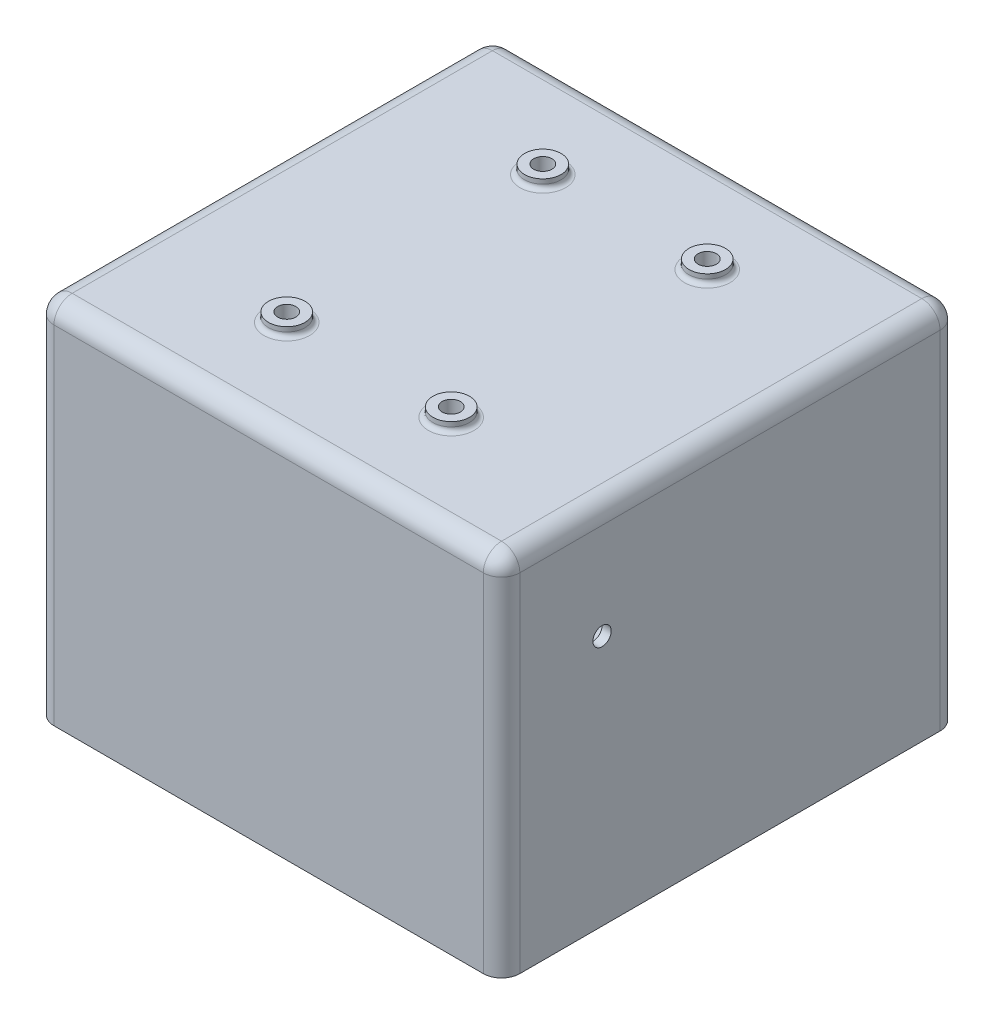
ISO-10303-21;
HEADER;
FILE_DESCRIPTION(('STEP AP214'),'2;1');
FILE_NAME('part.step','',(''),(''),'','','');
FILE_SCHEMA(('AUTOMOTIVE_DESIGN { 1 0 10303 214 1 1 1 1 }'));
ENDSEC;
DATA;
#1=APPLICATION_CONTEXT('core data for automotive mechanical design processes');
#2=APPLICATION_PROTOCOL_DEFINITION('international standard','automotive_design',2000,#1);
#3=PRODUCT_CONTEXT('',#1,'mechanical');
#4=PRODUCT('Part','Part','',(#3));
#5=PRODUCT_RELATED_PRODUCT_CATEGORY('part','',(#4));
#6=PRODUCT_DEFINITION_FORMATION('','',#4);
#7=PRODUCT_DEFINITION_CONTEXT('part definition',#1,'design');
#8=PRODUCT_DEFINITION('design','',#6,#7);
#9=PRODUCT_DEFINITION_SHAPE('','',#8);
#10=(LENGTH_UNIT() NAMED_UNIT(*) SI_UNIT(.MILLI.,.METRE.));
#11=(NAMED_UNIT(*) PLANE_ANGLE_UNIT() SI_UNIT($,.RADIAN.));
#12=(NAMED_UNIT(*) SI_UNIT($,.STERADIAN.) SOLID_ANGLE_UNIT());
#13=UNCERTAINTY_MEASURE_WITH_UNIT(LENGTH_MEASURE(1.E-05),#10,'distance_accuracy_value','');
#14=(GEOMETRIC_REPRESENTATION_CONTEXT(3) GLOBAL_UNCERTAINTY_ASSIGNED_CONTEXT((#13)) GLOBAL_UNIT_ASSIGNED_CONTEXT((#10,
#11,#12)) REPRESENTATION_CONTEXT('',''));
#15=CARTESIAN_POINT('',(0.,0.,0.));
#16=DIRECTION('',(0.,0.,1.));
#17=DIRECTION('',(1.,0.,0.));
#18=AXIS2_PLACEMENT_3D('',#15,#16,#17);
#19=CARTESIAN_POINT('',(-490.,0.,0.));
#20=DIRECTION('',(-1.,0.,0.));
#21=DIRECTION('',(0.,0.,1.));
#22=AXIS2_PLACEMENT_3D('',#19,#20,#21);
#23=PLANE('',#22);
#24=CARTESIAN_POINT('',(-490.,125.,-110.));
#25=DIRECTION('',(-1.,0.,0.));
#26=DIRECTION('',(0.,0.,1.));
#27=AXIS2_PLACEMENT_3D('',#24,#25,#26);
#28=CIRCLE('',#27,10.);
#29=CARTESIAN_POINT('',(-490.,125.,-100.));
#30=VERTEX_POINT('',#29);
#31=EDGE_CURVE('E265',#30,#30,#28,.T.);
#32=ORIENTED_EDGE('',*,*,#31,.T.);
#33=EDGE_LOOP('',(#32));
#34=FACE_BOUND('',#33,.T.);
#35=CARTESIAN_POINT('',(-490.,125.,-390.));
#36=DIRECTION('',(-1.,0.,0.));
#37=DIRECTION('',(0.,0.,1.));
#38=AXIS2_PLACEMENT_3D('',#35,#36,#37);
#39=CIRCLE('',#38,10.);
#40=CARTESIAN_POINT('',(-490.,125.,-380.));
#41=VERTEX_POINT('',#40);
#42=EDGE_CURVE('E269',#41,#41,#39,.T.);
#43=ORIENTED_EDGE('',*,*,#42,.T.);
#44=EDGE_LOOP('',(#43));
#45=FACE_BOUND('',#44,.T.);
#46=DIRECTION('',(0.,0.,1.));
#47=VECTOR('',#46,1.);
#48=CARTESIAN_POINT('',(-490.,10.,0.));
#49=LINE('',#48,#47);
#50=CARTESIAN_POINT('',(-490.,10.,-470.));
#51=VERTEX_POINT('',#50);
#52=CARTESIAN_POINT('',(-490.,10.,-30.));
#53=VERTEX_POINT('',#52);
#54=EDGE_CURVE('E190',#51,#53,#49,.T.);
#55=ORIENTED_EDGE('',*,*,#54,.F.);
#56=DIRECTION('',(0.,-1.,0.));
#57=VECTOR('',#56,1.);
#58=CARTESIAN_POINT('',(-490.,0.,-470.));
#59=LINE('',#58,#57);
#60=CARTESIAN_POINT('',(-490.,370.,-470.));
#61=VERTEX_POINT('',#60);
#62=EDGE_CURVE('E177',#51,#61,#59,.F.);
#63=ORIENTED_EDGE('',*,*,#62,.T.);
#64=DIRECTION('',(0.,0.,-1.));
#65=VECTOR('',#64,1.);
#66=CARTESIAN_POINT('',(-490.,370.,0.));
#67=LINE('',#66,#65);
#68=CARTESIAN_POINT('',(-490.,370.,-30.));
#69=VERTEX_POINT('',#68);
#70=EDGE_CURVE('E186',#61,#69,#67,.F.);
#71=ORIENTED_EDGE('',*,*,#70,.T.);
#72=DIRECTION('',(0.,1.,0.));
#73=VECTOR('',#72,1.);
#74=CARTESIAN_POINT('',(-490.,0.,-30.));
#75=LINE('',#74,#73);
#76=EDGE_CURVE('E192',#69,#53,#75,.F.);
#77=ORIENTED_EDGE('',*,*,#76,.T.);
#78=EDGE_LOOP('',(#55,#63,#71,#77));
#79=FACE_BOUND('',#78,.T.);
#80=ADVANCED_FACE('F39',(#34,#45,#79),#23,.F.);
#81=CARTESIAN_POINT('',(0.,400.,0.));
#82=DIRECTION('',(-1.,0.,0.));
#83=DIRECTION('',(0.,0.,1.));
#84=AXIS2_PLACEMENT_3D('',#81,#82,#83);
#85=PLANE('',#84);
#86=CARTESIAN_POINT('',(0.,275.,-110.));
#87=DIRECTION('',(-1.,0.,0.));
#88=DIRECTION('',(0.,0.,1.));
#89=AXIS2_PLACEMENT_3D('',#86,#87,#88);
#90=CIRCLE('',#89,10.);
#91=CARTESIAN_POINT('',(0.,275.,-100.));
#92=VERTEX_POINT('',#91);
#93=EDGE_CURVE('E211',#92,#92,#90,.T.);
#94=ORIENTED_EDGE('',*,*,#93,.F.);
#95=EDGE_LOOP('',(#94));
#96=FACE_BOUND('',#95,.T.);
#97=CARTESIAN_POINT('',(0.,125.,-110.));
#98=DIRECTION('',(-1.,0.,0.));
#99=DIRECTION('',(0.,0.,1.));
#100=AXIS2_PLACEMENT_3D('',#97,#98,#99);
#101=CIRCLE('',#100,10.);
#102=CARTESIAN_POINT('',(0.,125.,-100.));
#103=VERTEX_POINT('',#102);
#104=EDGE_CURVE('E293',#103,#103,#101,.T.);
#105=ORIENTED_EDGE('',*,*,#104,.F.);
#106=EDGE_LOOP('',(#105));
#107=FACE_BOUND('',#106,.T.);
#108=CARTESIAN_POINT('',(0.,125.,-390.));
#109=DIRECTION('',(-1.,0.,0.));
#110=DIRECTION('',(0.,0.,1.));
#111=AXIS2_PLACEMENT_3D('',#108,#109,#110);
#112=CIRCLE('',#111,10.);
#113=CARTESIAN_POINT('',(0.,125.,-380.));
#114=VERTEX_POINT('',#113);
#115=EDGE_CURVE('E297',#114,#114,#112,.T.);
#116=ORIENTED_EDGE('',*,*,#115,.F.);
#117=EDGE_LOOP('',(#116));
#118=FACE_BOUND('',#117,.T.);
#119=DIRECTION('',(0.,-1.,0.));
#120=VECTOR('',#119,1.);
#121=CARTESIAN_POINT('',(0.,0.,-470.));
#122=LINE('',#121,#120);
#123=CARTESIAN_POINT('',(0.,370.,-470.));
#124=VERTEX_POINT('',#123);
#125=CARTESIAN_POINT('',(0.,10.,-470.));
#126=VERTEX_POINT('',#125);
#127=EDGE_CURVE('E326',#124,#126,#122,.T.);
#128=ORIENTED_EDGE('',*,*,#127,.T.);
#129=DIRECTION('',(0.,0.,1.));
#130=VECTOR('',#129,1.);
#131=CARTESIAN_POINT('',(0.,10.,0.));
#132=LINE('',#131,#130);
#133=CARTESIAN_POINT('',(0.,10.,-30.));
#134=VERTEX_POINT('',#133);
#135=EDGE_CURVE('E206',#126,#134,#132,.T.);
#136=ORIENTED_EDGE('',*,*,#135,.T.);
#137=DIRECTION('',(0.,1.,0.));
#138=VECTOR('',#137,1.);
#139=CARTESIAN_POINT('',(0.,380.,-30.));
#140=LINE('',#139,#138);
#141=CARTESIAN_POINT('',(0.,370.,-30.));
#142=VERTEX_POINT('',#141);
#143=EDGE_CURVE('E330',#134,#142,#140,.T.);
#144=ORIENTED_EDGE('',*,*,#143,.T.);
#145=DIRECTION('',(0.,0.,-1.));
#146=VECTOR('',#145,1.);
#147=CARTESIAN_POINT('',(0.,370.,-480.));
#148=LINE('',#147,#146);
#149=EDGE_CURVE('E328',#142,#124,#148,.T.);
#150=ORIENTED_EDGE('',*,*,#149,.T.);
#151=EDGE_LOOP('',(#128,#136,#144,#150));
#152=FACE_BOUND('',#151,.T.);
#153=ADVANCED_FACE('F622',(#96,#107,#118,#152),#85,.T.);
#154=CARTESIAN_POINT('',(-490.,0.,-10.));
#155=DIRECTION('',(0.,0.,-1.));
#156=DIRECTION('',(-1.,0.,0.));
#157=AXIS2_PLACEMENT_3D('',#154,#155,#156);
#158=PLANE('',#157);
#159=DIRECTION('',(0.,1.,0.));
#160=VECTOR('',#159,1.);
#161=CARTESIAN_POINT('',(-20.,0.,-10.));
#162=LINE('',#161,#160);
#163=CARTESIAN_POINT('',(-20.,380.,-10.));
#164=VERTEX_POINT('',#163);
#165=CARTESIAN_POINT('',(-20.,10.,-10.));
#166=VERTEX_POINT('',#165);
#167=EDGE_CURVE('E334',#164,#166,#162,.F.);
#168=ORIENTED_EDGE('',*,*,#167,.T.);
#169=DIRECTION('',(-1.,0.,0.));
#170=VECTOR('',#169,1.);
#171=CARTESIAN_POINT('',(-490.,10.,-10.));
#172=LINE('',#171,#170);
#173=CARTESIAN_POINT('',(-470.,10.,-10.));
#174=VERTEX_POINT('',#173);
#175=EDGE_CURVE('E204',#166,#174,#172,.T.);
#176=ORIENTED_EDGE('',*,*,#175,.T.);
#177=DIRECTION('',(0.,1.,0.));
#178=VECTOR('',#177,1.);
#179=CARTESIAN_POINT('',(-470.,0.,-10.));
#180=LINE('',#179,#178);
#181=CARTESIAN_POINT('',(-470.,380.,-10.));
#182=VERTEX_POINT('',#181);
#183=EDGE_CURVE('E332',#174,#182,#180,.T.);
#184=ORIENTED_EDGE('',*,*,#183,.T.);
#185=DIRECTION('',(1.,0.,0.));
#186=VECTOR('',#185,1.);
#187=CARTESIAN_POINT('',(-490.,380.,-10.));
#188=LINE('',#187,#186);
#189=EDGE_CURVE('E284',#182,#164,#188,.T.);
#190=ORIENTED_EDGE('',*,*,#189,.T.);
#191=EDGE_LOOP('',(#168,#176,#184,#190));
#192=FACE_BOUND('',#191,.T.);
#193=ADVANCED_FACE('F628',(#192),#158,.T.);
#194=CARTESIAN_POINT('',(-490.,0.,-490.));
#195=DIRECTION('',(0.,0.,1.));
#196=DIRECTION('',(1.,0.,0.));
#197=AXIS2_PLACEMENT_3D('',#194,#195,#196);
#198=PLANE('',#197);
#199=DIRECTION('',(0.,-1.,0.));
#200=VECTOR('',#199,1.);
#201=CARTESIAN_POINT('',(-470.,0.,-490.));
#202=LINE('',#201,#200);
#203=CARTESIAN_POINT('',(-470.,380.,-490.));
#204=VERTEX_POINT('',#203);
#205=CARTESIAN_POINT('',(-470.,10.,-490.));
#206=VERTEX_POINT('',#205);
#207=EDGE_CURVE('E391',#204,#206,#202,.T.);
#208=ORIENTED_EDGE('',*,*,#207,.T.);
#209=DIRECTION('',(1.,0.,0.));
#210=VECTOR('',#209,1.);
#211=CARTESIAN_POINT('',(-490.,10.,-490.));
#212=LINE('',#211,#210);
#213=CARTESIAN_POINT('',(-20.,10.,-490.));
#214=VERTEX_POINT('',#213);
#215=EDGE_CURVE('E54',#206,#214,#212,.T.);
#216=ORIENTED_EDGE('',*,*,#215,.T.);
#217=DIRECTION('',(0.,-1.,0.));
#218=VECTOR('',#217,1.);
#219=CARTESIAN_POINT('',(-20.,380.,-490.));
#220=LINE('',#219,#218);
#221=CARTESIAN_POINT('',(-20.,380.,-490.));
#222=VERTEX_POINT('',#221);
#223=EDGE_CURVE('E389',#214,#222,#220,.F.);
#224=ORIENTED_EDGE('',*,*,#223,.T.);
#225=DIRECTION('',(1.,0.,0.));
#226=VECTOR('',#225,1.);
#227=CARTESIAN_POINT('',(-490.,380.,-490.));
#228=LINE('',#227,#226);
#229=EDGE_CURVE('E280',#204,#222,#228,.T.);
#230=ORIENTED_EDGE('',*,*,#229,.F.);
#231=EDGE_LOOP('',(#208,#216,#224,#230));
#232=FACE_BOUND('',#231,.T.);
#233=ADVANCED_FACE('F635',(#232),#198,.T.);
#234=CARTESIAN_POINT('',(-20.,400.,-470.));
#235=DIRECTION('',(0.,1.,0.));
#236=DIRECTION('',(0.,0.,1.));
#237=AXIS2_PLACEMENT_3D('',#234,#235,#236);
#238=CYLINDRICAL_SURFACE('',#237,20.);
#239=CARTESIAN_POINT('',(-20.,10.,-470.));
#240=DIRECTION('',(0.,-1.,0.));
#241=DIRECTION('',(0.,0.,-1.));
#242=AXIS2_PLACEMENT_3D('',#239,#240,#241);
#243=CIRCLE('',#242,20.);
#244=EDGE_CURVE('E61',#126,#214,#243,.F.);
#245=ORIENTED_EDGE('',*,*,#244,.F.);
#246=ORIENTED_EDGE('',*,*,#127,.F.);
#247=CARTESIAN_POINT('',(-20.,370.,-470.));
#248=DIRECTION('',(0.,-0.894427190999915,-0.44721359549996));
#249=DIRECTION('',(0.,0.44721359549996,-0.894427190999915));
#250=AXIS2_PLACEMENT_3D('',#247,#248,#249);
#251=ELLIPSE('',#250,22.3606797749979,20.);
#252=EDGE_CURVE('E281',#222,#124,#251,.T.);
#253=ORIENTED_EDGE('',*,*,#252,.F.);
#254=ORIENTED_EDGE('',*,*,#223,.F.);
#255=EDGE_LOOP('',(#245,#246,#253,#254));
#256=FACE_BOUND('',#255,.T.);
#257=ADVANCED_FACE('F432',(#256),#238,.F.);
#258=CARTESIAN_POINT('',(-20.,400.,-30.));
#259=DIRECTION('',(0.,-1.,0.));
#260=DIRECTION('',(0.,0.,-1.));
#261=AXIS2_PLACEMENT_3D('',#258,#259,#260);
#262=CYLINDRICAL_SURFACE('',#261,20.);
#263=CARTESIAN_POINT('',(-20.,10.,-30.));
#264=DIRECTION('',(0.,-1.,0.));
#265=DIRECTION('',(0.,0.,-1.));
#266=AXIS2_PLACEMENT_3D('',#263,#264,#265);
#267=CIRCLE('',#266,20.);
#268=EDGE_CURVE('E208',#166,#134,#267,.F.);
#269=ORIENTED_EDGE('',*,*,#268,.F.);
#270=ORIENTED_EDGE('',*,*,#167,.F.);
#271=CARTESIAN_POINT('',(-20.,370.,-30.));
#272=DIRECTION('',(0.,0.894427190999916,-0.447213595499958));
#273=DIRECTION('',(0.,0.447213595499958,0.894427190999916));
#274=AXIS2_PLACEMENT_3D('',#271,#272,#273);
#275=ELLIPSE('',#274,22.3606797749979,20.);
#276=EDGE_CURVE('E395',#164,#142,#275,.T.);
#277=ORIENTED_EDGE('',*,*,#276,.T.);
#278=ORIENTED_EDGE('',*,*,#143,.F.);
#279=EDGE_LOOP('',(#269,#270,#277,#278));
#280=FACE_BOUND('',#279,.T.);
#281=ADVANCED_FACE('F416',(#280),#262,.F.);
#282=CARTESIAN_POINT('',(-470.,0.,-30.));
#283=DIRECTION('',(0.,1.,0.));
#284=DIRECTION('',(0.,0.,1.));
#285=AXIS2_PLACEMENT_3D('',#282,#283,#284);
#286=CYLINDRICAL_SURFACE('',#285,20.);
#287=CARTESIAN_POINT('',(-470.,10.,-30.));
#288=DIRECTION('',(0.,-1.,0.));
#289=DIRECTION('',(0.,0.,-1.));
#290=AXIS2_PLACEMENT_3D('',#287,#288,#289);
#291=CIRCLE('',#290,20.);
#292=EDGE_CURVE('E195',#53,#174,#291,.F.);
#293=ORIENTED_EDGE('',*,*,#292,.F.);
#294=ORIENTED_EDGE('',*,*,#76,.F.);
#295=CARTESIAN_POINT('',(-470.,370.,-30.));
#296=DIRECTION('',(0.,-0.894427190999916,0.447213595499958));
#297=DIRECTION('',(0.,0.447213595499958,0.894427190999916));
#298=AXIS2_PLACEMENT_3D('',#295,#296,#297);
#299=ELLIPSE('',#298,22.3606797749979,20.);
#300=EDGE_CURVE('E453',#182,#69,#299,.T.);
#301=ORIENTED_EDGE('',*,*,#300,.F.);
#302=ORIENTED_EDGE('',*,*,#183,.F.);
#303=EDGE_LOOP('',(#293,#294,#301,#302));
#304=FACE_BOUND('',#303,.T.);
#305=ADVANCED_FACE('F494',(#304),#286,.F.);
#306=CARTESIAN_POINT('',(-470.,0.,-470.));
#307=DIRECTION('',(0.,-1.,0.));
#308=DIRECTION('',(0.,0.,-1.));
#309=AXIS2_PLACEMENT_3D('',#306,#307,#308);
#310=CYLINDRICAL_SURFACE('',#309,20.);
#311=CARTESIAN_POINT('',(-470.,10.,-470.));
#312=DIRECTION('',(0.,-1.,0.));
#313=DIRECTION('',(0.,0.,-1.));
#314=AXIS2_PLACEMENT_3D('',#311,#312,#313);
#315=CIRCLE('',#314,20.);
#316=EDGE_CURVE('E11',#206,#51,#315,.F.);
#317=ORIENTED_EDGE('',*,*,#316,.F.);
#318=ORIENTED_EDGE('',*,*,#207,.F.);
#319=CARTESIAN_POINT('',(-470.,370.,-470.));
#320=DIRECTION('',(0.,0.894427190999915,0.44721359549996));
#321=DIRECTION('',(0.,0.44721359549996,-0.894427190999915));
#322=AXIS2_PLACEMENT_3D('',#319,#320,#321);
#323=ELLIPSE('',#322,22.3606797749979,20.);
#324=EDGE_CURVE('E182',#204,#61,#323,.T.);
#325=ORIENTED_EDGE('',*,*,#324,.T.);
#326=ORIENTED_EDGE('',*,*,#62,.F.);
#327=EDGE_LOOP('',(#317,#318,#325,#326));
#328=FACE_BOUND('',#327,.T.);
#329=ADVANCED_FACE('F179',(#328),#310,.F.);
#330=CARTESIAN_POINT('',(10.,0.,0.));
#331=DIRECTION('',(0.,0.,-1.));
#332=DIRECTION('',(-1.,0.,0.));
#333=AXIS2_PLACEMENT_3D('',#330,#331,#332);
#334=PLANE('',#333);
#335=DIRECTION('',(0.,-1.,0.));
#336=VECTOR('',#335,1.);
#337=CARTESIAN_POINT('',(-10.,0.,0.));
#338=LINE('',#337,#336);
#339=CARTESIAN_POINT('',(-10.,0.,0.));
#340=VERTEX_POINT('',#339);
#341=CARTESIAN_POINT('',(-10.,380.,0.));
#342=VERTEX_POINT('',#341);
#343=EDGE_CURVE('E355',#340,#342,#338,.F.);
#344=ORIENTED_EDGE('',*,*,#343,.T.);
#345=DIRECTION('',(-1.,0.,0.));
#346=VECTOR('',#345,1.);
#347=CARTESIAN_POINT('',(10.,380.,0.));
#348=LINE('',#347,#346);
#349=CARTESIAN_POINT('',(-480.,380.,0.));
#350=VERTEX_POINT('',#349);
#351=EDGE_CURVE('E323',#342,#350,#348,.T.);
#352=ORIENTED_EDGE('',*,*,#351,.T.);
#353=DIRECTION('',(0.,1.,0.));
#354=VECTOR('',#353,1.);
#355=CARTESIAN_POINT('',(-480.,0.,0.));
#356=LINE('',#355,#354);
#357=CARTESIAN_POINT('',(-480.,0.,0.));
#358=VERTEX_POINT('',#357);
#359=EDGE_CURVE('E357',#350,#358,#356,.F.);
#360=ORIENTED_EDGE('',*,*,#359,.T.);
#361=DIRECTION('',(-1.,0.,0.));
#362=VECTOR('',#361,1.);
#363=CARTESIAN_POINT('',(10.,0.,0.));
#364=LINE('',#363,#362);
#365=EDGE_CURVE('E311',#340,#358,#364,.T.);
#366=ORIENTED_EDGE('',*,*,#365,.F.);
#367=EDGE_LOOP('',(#344,#352,#360,#366));
#368=FACE_BOUND('',#367,.T.);
#369=ADVANCED_FACE('F574',(#368),#334,.F.);
#370=CARTESIAN_POINT('',(10.,0.,0.));
#371=DIRECTION('',(0.,1.,0.));
#372=DIRECTION('',(0.,0.,1.));
#373=AXIS2_PLACEMENT_3D('',#370,#371,#372);
#374=PLANE('',#373);
#375=ORIENTED_EDGE('',*,*,#365,.T.);
#376=CARTESIAN_POINT('',(-480.,0.,-20.));
#377=DIRECTION('',(0.,1.,0.));
#378=DIRECTION('',(0.,0.,1.));
#379=AXIS2_PLACEMENT_3D('',#376,#377,#378);
#380=CIRCLE('',#379,20.);
#381=CARTESIAN_POINT('',(-500.,0.,-20.));
#382=VERTEX_POINT('',#381);
#383=EDGE_CURVE('E365',#358,#382,#380,.F.);
#384=ORIENTED_EDGE('',*,*,#383,.T.);
#385=DIRECTION('',(0.,0.,1.));
#386=VECTOR('',#385,1.);
#387=CARTESIAN_POINT('',(-500.,0.,0.));
#388=LINE('',#387,#386);
#389=CARTESIAN_POINT('',(-500.,0.,-480.));
#390=VERTEX_POINT('',#389);
#391=EDGE_CURVE('E277',#390,#382,#388,.T.);
#392=ORIENTED_EDGE('',*,*,#391,.F.);
#393=CARTESIAN_POINT('',(-480.,0.,-480.));
#394=DIRECTION('',(0.,1.,0.));
#395=DIRECTION('',(0.,0.,1.));
#396=AXIS2_PLACEMENT_3D('',#393,#394,#395);
#397=CIRCLE('',#396,20.);
#398=CARTESIAN_POINT('',(-480.,0.,-500.));
#399=VERTEX_POINT('',#398);
#400=EDGE_CURVE('E361',#390,#399,#397,.F.);
#401=ORIENTED_EDGE('',*,*,#400,.T.);
#402=DIRECTION('',(-1.,0.,0.));
#403=VECTOR('',#402,1.);
#404=CARTESIAN_POINT('',(10.,0.,-500.));
#405=LINE('',#404,#403);
#406=CARTESIAN_POINT('',(-10.,0.,-500.));
#407=VERTEX_POINT('',#406);
#408=EDGE_CURVE('E308',#407,#399,#405,.T.);
#409=ORIENTED_EDGE('',*,*,#408,.F.);
#410=CARTESIAN_POINT('',(-10.,0.,-480.));
#411=DIRECTION('',(0.,1.,0.));
#412=DIRECTION('',(0.,0.,1.));
#413=AXIS2_PLACEMENT_3D('',#410,#411,#412);
#414=CIRCLE('',#413,20.);
#415=CARTESIAN_POINT('',(10.,0.,-480.));
#416=VERTEX_POINT('',#415);
#417=EDGE_CURVE('E363',#407,#416,#414,.F.);
#418=ORIENTED_EDGE('',*,*,#417,.T.);
#419=DIRECTION('',(0.,0.,-1.));
#420=VECTOR('',#419,1.);
#421=CARTESIAN_POINT('',(10.,0.,0.));
#422=LINE('',#421,#420);
#423=CARTESIAN_POINT('',(10.,0.,-20.));
#424=VERTEX_POINT('',#423);
#425=EDGE_CURVE('E303',#424,#416,#422,.T.);
#426=ORIENTED_EDGE('',*,*,#425,.F.);
#427=CARTESIAN_POINT('',(-10.,0.,-20.));
#428=DIRECTION('',(0.,1.,0.));
#429=DIRECTION('',(0.,0.,1.));
#430=AXIS2_PLACEMENT_3D('',#427,#428,#429);
#431=CIRCLE('',#430,20.);
#432=EDGE_CURVE('E359',#424,#340,#431,.F.);
#433=ORIENTED_EDGE('',*,*,#432,.T.);
#434=EDGE_LOOP('',(#375,#384,#392,#401,#409,#418,#426,#433));
#435=FACE_BOUND('',#434,.T.);
#436=ADVANCED_FACE('F583',(#435),#374,.F.);
#437=CARTESIAN_POINT('',(10.,0.,-500.));
#438=DIRECTION('',(0.,0.,1.));
#439=DIRECTION('',(1.,0.,0.));
#440=AXIS2_PLACEMENT_3D('',#437,#438,#439);
#441=PLANE('',#440);
#442=DIRECTION('',(0.,-1.,0.));
#443=VECTOR('',#442,1.);
#444=CARTESIAN_POINT('',(-480.,380.,-500.));
#445=LINE('',#444,#443);
#446=CARTESIAN_POINT('',(-480.,380.,-500.));
#447=VERTEX_POINT('',#446);
#448=EDGE_CURVE('E385',#399,#447,#445,.F.);
#449=ORIENTED_EDGE('',*,*,#448,.T.);
#450=DIRECTION('',(-1.,0.,0.));
#451=VECTOR('',#450,1.);
#452=CARTESIAN_POINT('',(10.,380.,-500.));
#453=LINE('',#452,#451);
#454=CARTESIAN_POINT('',(-10.,380.,-500.));
#455=VERTEX_POINT('',#454);
#456=EDGE_CURVE('E320',#447,#455,#453,.F.);
#457=ORIENTED_EDGE('',*,*,#456,.T.);
#458=DIRECTION('',(0.,1.,0.));
#459=VECTOR('',#458,1.);
#460=CARTESIAN_POINT('',(-10.,0.,-500.));
#461=LINE('',#460,#459);
#462=EDGE_CURVE('E387',#455,#407,#461,.F.);
#463=ORIENTED_EDGE('',*,*,#462,.T.);
#464=ORIENTED_EDGE('',*,*,#408,.T.);
#465=EDGE_LOOP('',(#449,#457,#463,#464));
#466=FACE_BOUND('',#465,.T.);
#467=ADVANCED_FACE('F546',(#466),#441,.F.);
#468=CARTESIAN_POINT('',(10.,400.,0.));
#469=DIRECTION('',(0.,-1.,0.));
#470=DIRECTION('',(0.,0.,-1.));
#471=AXIS2_PLACEMENT_3D('',#468,#469,#470);
#472=PLANE('',#471);
#473=CARTESIAN_POINT('',(-155.,400.,-109.851817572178));
#474=DIRECTION('',(0.,-1.,0.));
#475=DIRECTION('',(0.,0.,-1.));
#476=AXIS2_PLACEMENT_3D('',#473,#474,#475);
#477=CIRCLE('',#476,25.);
#478=CARTESIAN_POINT('',(-155.,400.,-134.851817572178));
#479=VERTEX_POINT('',#478);
#480=EDGE_CURVE('E519',#479,#479,#477,.T.);
#481=ORIENTED_EDGE('',*,*,#480,.T.);
#482=EDGE_LOOP('',(#481));
#483=FACE_BOUND('',#482,.T.);
#484=CARTESIAN_POINT('',(-335.,400.,-109.851817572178));
#485=DIRECTION('',(0.,-1.,0.));
#486=DIRECTION('',(0.,0.,-1.));
#487=AXIS2_PLACEMENT_3D('',#484,#485,#486);
#488=CIRCLE('',#487,25.);
#489=CARTESIAN_POINT('',(-335.,400.,-134.851817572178));
#490=VERTEX_POINT('',#489);
#491=EDGE_CURVE('E516',#490,#490,#488,.T.);
#492=ORIENTED_EDGE('',*,*,#491,.T.);
#493=EDGE_LOOP('',(#492));
#494=FACE_BOUND('',#493,.T.);
#495=CARTESIAN_POINT('',(-155.,400.,-390.148182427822));
#496=DIRECTION('',(0.,-1.,0.));
#497=DIRECTION('',(0.,0.,-1.));
#498=AXIS2_PLACEMENT_3D('',#495,#496,#497);
#499=CIRCLE('',#498,25.);
#500=CARTESIAN_POINT('',(-155.,400.,-415.148182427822));
#501=VERTEX_POINT('',#500);
#502=EDGE_CURVE('E513',#501,#501,#499,.T.);
#503=ORIENTED_EDGE('',*,*,#502,.T.);
#504=EDGE_LOOP('',(#503));
#505=FACE_BOUND('',#504,.T.);
#506=CARTESIAN_POINT('',(-335.,400.,-390.148182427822));
#507=DIRECTION('',(0.,-1.,0.));
#508=DIRECTION('',(0.,0.,-1.));
#509=AXIS2_PLACEMENT_3D('',#506,#507,#508);
#510=CIRCLE('',#509,25.);
#511=CARTESIAN_POINT('',(-335.,400.,-415.148182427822));
#512=VERTEX_POINT('',#511);
#513=EDGE_CURVE('E510',#512,#512,#510,.T.);
#514=ORIENTED_EDGE('',*,*,#513,.T.);
#515=EDGE_LOOP('',(#514));
#516=FACE_BOUND('',#515,.T.);
#517=DIRECTION('',(-1.,0.,0.));
#518=VECTOR('',#517,1.);
#519=CARTESIAN_POINT('',(10.,400.,-480.));
#520=LINE('',#519,#518);
#521=CARTESIAN_POINT('',(-10.,400.,-480.));
#522=VERTEX_POINT('',#521);
#523=CARTESIAN_POINT('',(-480.,400.,-480.));
#524=VERTEX_POINT('',#523);
#525=EDGE_CURVE('E317',#522,#524,#520,.T.);
#526=ORIENTED_EDGE('',*,*,#525,.T.);
#527=DIRECTION('',(0.,0.,-1.));
#528=VECTOR('',#527,1.);
#529=CARTESIAN_POINT('',(-480.,400.,-20.));
#530=LINE('',#529,#528);
#531=CARTESIAN_POINT('',(-480.,400.,-20.));
#532=VERTEX_POINT('',#531);
#533=EDGE_CURVE('E373',#524,#532,#530,.F.);
#534=ORIENTED_EDGE('',*,*,#533,.T.);
#535=DIRECTION('',(-1.,0.,0.));
#536=VECTOR('',#535,1.);
#537=CARTESIAN_POINT('',(10.,400.,-20.));
#538=LINE('',#537,#536);
#539=CARTESIAN_POINT('',(-10.,400.,-20.));
#540=VERTEX_POINT('',#539);
#541=EDGE_CURVE('E314',#532,#540,#538,.F.);
#542=ORIENTED_EDGE('',*,*,#541,.T.);
#543=DIRECTION('',(0.,0.,1.));
#544=VECTOR('',#543,1.);
#545=CARTESIAN_POINT('',(-10.,400.,0.));
#546=LINE('',#545,#544);
#547=EDGE_CURVE('E371',#540,#522,#546,.F.);
#548=ORIENTED_EDGE('',*,*,#547,.T.);
#549=EDGE_LOOP('',(#526,#534,#542,#548));
#550=FACE_BOUND('',#549,.T.);
#551=ADVANCED_FACE('F542',(#483,#494,#505,#516,#550),#472,.F.);
#552=CARTESIAN_POINT('',(10.,400.,0.));
#553=DIRECTION('',(-1.,0.,0.));
#554=DIRECTION('',(0.,0.,1.));
#555=AXIS2_PLACEMENT_3D('',#552,#553,#554);
#556=PLANE('',#555);
#557=DIRECTION('',(0.,1.,0.));
#558=VECTOR('',#557,1.);
#559=CARTESIAN_POINT('',(10.,400.,-480.));
#560=LINE('',#559,#558);
#561=CARTESIAN_POINT('',(10.,380.,-480.));
#562=VERTEX_POINT('',#561);
#563=EDGE_CURVE('E383',#416,#562,#560,.T.);
#564=ORIENTED_EDGE('',*,*,#563,.T.);
#565=DIRECTION('',(0.,0.,1.));
#566=VECTOR('',#565,1.);
#567=CARTESIAN_POINT('',(10.,380.,0.));
#568=LINE('',#567,#566);
#569=CARTESIAN_POINT('',(10.,380.,-20.));
#570=VERTEX_POINT('',#569);
#571=EDGE_CURVE('E381',#562,#570,#568,.T.);
#572=ORIENTED_EDGE('',*,*,#571,.T.);
#573=DIRECTION('',(0.,-1.,0.));
#574=VECTOR('',#573,1.);
#575=CARTESIAN_POINT('',(10.,400.,-20.));
#576=LINE('',#575,#574);
#577=EDGE_CURVE('E379',#570,#424,#576,.T.);
#578=ORIENTED_EDGE('',*,*,#577,.T.);
#579=ORIENTED_EDGE('',*,*,#425,.T.);
#580=EDGE_LOOP('',(#564,#572,#578,#579));
#581=FACE_BOUND('',#580,.T.);
#582=CARTESIAN_POINT('',(10.,275.,-110.));
#583=DIRECTION('',(-1.,0.,0.));
#584=DIRECTION('',(0.,0.,1.));
#585=AXIS2_PLACEMENT_3D('',#582,#583,#584);
#586=CIRCLE('',#585,10.);
#587=CARTESIAN_POINT('',(10.,275.,-100.));
#588=VERTEX_POINT('',#587);
#589=EDGE_CURVE('E212',#588,#588,#586,.T.);
#590=ORIENTED_EDGE('',*,*,#589,.T.);
#591=EDGE_LOOP('',(#590));
#592=FACE_BOUND('',#591,.T.);
#593=ADVANCED_FACE('F545',(#581,#592),#556,.F.);
#594=CARTESIAN_POINT('',(5.,125.,-390.));
#595=DIRECTION('',(-1.,0.,0.));
#596=DIRECTION('',(0.,0.,1.));
#597=AXIS2_PLACEMENT_3D('',#594,#595,#596);
#598=CYLINDRICAL_SURFACE('',#597,10.);
#599=CARTESIAN_POINT('',(5.,125.,-390.));
#600=DIRECTION('',(-1.,0.,0.));
#601=DIRECTION('',(0.,0.,1.));
#602=AXIS2_PLACEMENT_3D('',#599,#600,#601);
#603=CIRCLE('',#602,10.);
#604=CARTESIAN_POINT('',(5.,125.,-380.));
#605=VERTEX_POINT('',#604);
#606=EDGE_CURVE('E300',#605,#605,#603,.T.);
#607=ORIENTED_EDGE('',*,*,#606,.F.);
#608=EDGE_LOOP('',(#607));
#609=FACE_BOUND('',#608,.T.);
#610=ORIENTED_EDGE('',*,*,#115,.T.);
#611=EDGE_LOOP('',(#610));
#612=FACE_BOUND('',#611,.T.);
#613=ADVANCED_FACE('F665',(#609,#612),#598,.F.);
#614=CARTESIAN_POINT('',(5.,125.,-390.));
#615=DIRECTION('',(-1.,0.,0.));
#616=DIRECTION('',(0.,0.,1.));
#617=AXIS2_PLACEMENT_3D('',#614,#615,#616);
#618=PLANE('',#617);
#619=ORIENTED_EDGE('',*,*,#606,.T.);
#620=EDGE_LOOP('',(#619));
#621=FACE_BOUND('',#620,.T.);
#622=ADVANCED_FACE('F661',(#621),#618,.T.);
#623=CARTESIAN_POINT('',(5.,125.,-110.));
#624=DIRECTION('',(-1.,0.,0.));
#625=DIRECTION('',(0.,0.,1.));
#626=AXIS2_PLACEMENT_3D('',#623,#624,#625);
#627=CYLINDRICAL_SURFACE('',#626,10.);
#628=CARTESIAN_POINT('',(5.,125.,-110.));
#629=DIRECTION('',(-1.,0.,0.));
#630=DIRECTION('',(0.,0.,1.));
#631=AXIS2_PLACEMENT_3D('',#628,#629,#630);
#632=CIRCLE('',#631,10.);
#633=CARTESIAN_POINT('',(5.,125.,-100.));
#634=VERTEX_POINT('',#633);
#635=EDGE_CURVE('E294',#634,#634,#632,.T.);
#636=ORIENTED_EDGE('',*,*,#635,.F.);
#637=EDGE_LOOP('',(#636));
#638=FACE_BOUND('',#637,.T.);
#639=ORIENTED_EDGE('',*,*,#104,.T.);
#640=EDGE_LOOP('',(#639));
#641=FACE_BOUND('',#640,.T.);
#642=ADVANCED_FACE('F657',(#638,#641),#627,.F.);
#643=CARTESIAN_POINT('',(5.,125.,-110.));
#644=DIRECTION('',(-1.,0.,0.));
#645=DIRECTION('',(0.,0.,1.));
#646=AXIS2_PLACEMENT_3D('',#643,#644,#645);
#647=PLANE('',#646);
#648=ORIENTED_EDGE('',*,*,#635,.T.);
#649=EDGE_LOOP('',(#648));
#650=FACE_BOUND('',#649,.T.);
#651=ADVANCED_FACE('F653',(#650),#647,.T.);
#652=CARTESIAN_POINT('',(10.,380.,-480.));
#653=DIRECTION('',(-1.,0.,0.));
#654=DIRECTION('',(0.,0.,1.));
#655=AXIS2_PLACEMENT_3D('',#652,#653,#654);
#656=CYLINDRICAL_SURFACE('',#655,20.);
#657=ORIENTED_EDGE('',*,*,#456,.F.);
#658=CARTESIAN_POINT('',(-480.,380.,-480.));
#659=DIRECTION('',(-1.,0.,0.));
#660=DIRECTION('',(0.,0.,1.));
#661=AXIS2_PLACEMENT_3D('',#658,#659,#660);
#662=CIRCLE('',#661,20.);
#663=EDGE_CURVE('E377',#447,#524,#662,.F.);
#664=ORIENTED_EDGE('',*,*,#663,.T.);
#665=ORIENTED_EDGE('',*,*,#525,.F.);
#666=CARTESIAN_POINT('',(-10.,380.,-480.));
#667=DIRECTION('',(-1.,0.,0.));
#668=DIRECTION('',(0.,0.,1.));
#669=AXIS2_PLACEMENT_3D('',#666,#667,#668);
#670=CIRCLE('',#669,20.);
#671=EDGE_CURVE('E375',#522,#455,#670,.T.);
#672=ORIENTED_EDGE('',*,*,#671,.T.);
#673=EDGE_LOOP('',(#657,#664,#665,#672));
#674=FACE_BOUND('',#673,.T.);
#675=ADVANCED_FACE('F656',(#674),#656,.T.);
#676=CARTESIAN_POINT('',(10.,380.,-20.));
#677=DIRECTION('',(-1.,0.,0.));
#678=DIRECTION('',(0.,0.,1.));
#679=AXIS2_PLACEMENT_3D('',#676,#677,#678);
#680=CYLINDRICAL_SURFACE('',#679,20.);
#681=ORIENTED_EDGE('',*,*,#541,.F.);
#682=CARTESIAN_POINT('',(-480.,380.,-20.));
#683=DIRECTION('',(-1.,0.,0.));
#684=DIRECTION('',(0.,0.,1.));
#685=AXIS2_PLACEMENT_3D('',#682,#683,#684);
#686=CIRCLE('',#685,20.);
#687=EDGE_CURVE('E369',#532,#350,#686,.F.);
#688=ORIENTED_EDGE('',*,*,#687,.T.);
#689=ORIENTED_EDGE('',*,*,#351,.F.);
#690=CARTESIAN_POINT('',(-10.,380.,-20.));
#691=DIRECTION('',(-1.,0.,0.));
#692=DIRECTION('',(0.,0.,1.));
#693=AXIS2_PLACEMENT_3D('',#690,#691,#692);
#694=CIRCLE('',#693,20.);
#695=EDGE_CURVE('E367',#342,#540,#694,.T.);
#696=ORIENTED_EDGE('',*,*,#695,.T.);
#697=EDGE_LOOP('',(#681,#688,#689,#696));
#698=FACE_BOUND('',#697,.T.);
#699=ADVANCED_FACE('F570',(#698),#680,.T.);
#700=CARTESIAN_POINT('',(-490.,380.,-480.));
#701=DIRECTION('',(1.,0.,0.));
#702=DIRECTION('',(0.,0.,-1.));
#703=AXIS2_PLACEMENT_3D('',#700,#701,#702);
#704=CYLINDRICAL_SURFACE('',#703,9.99999999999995);
#705=ORIENTED_EDGE('',*,*,#229,.T.);
#706=CARTESIAN_POINT('',(-20.,380.,-480.));
#707=DIRECTION('',(1.,0.,0.));
#708=DIRECTION('',(0.,0.,-1.));
#709=AXIS2_PLACEMENT_3D('',#706,#707,#708);
#710=CIRCLE('',#709,9.99999999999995);
#711=CARTESIAN_POINT('',(-20.,390.,-480.));
#712=VERTEX_POINT('',#711);
#713=EDGE_CURVE('E347',#222,#712,#710,.T.);
#714=ORIENTED_EDGE('',*,*,#713,.T.);
#715=DIRECTION('',(1.,0.,0.));
#716=VECTOR('',#715,1.);
#717=CARTESIAN_POINT('',(-490.,390.,-480.));
#718=LINE('',#717,#716);
#719=CARTESIAN_POINT('',(-470.,390.,-480.));
#720=VERTEX_POINT('',#719);
#721=EDGE_CURVE('E290',#720,#712,#718,.T.);
#722=ORIENTED_EDGE('',*,*,#721,.F.);
#723=CARTESIAN_POINT('',(-470.,380.,-480.));
#724=DIRECTION('',(-1.,0.,0.));
#725=DIRECTION('',(0.,0.,1.));
#726=AXIS2_PLACEMENT_3D('',#723,#724,#725);
#727=CIRCLE('',#726,9.99999999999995);
#728=EDGE_CURVE('E345',#720,#204,#727,.T.);
#729=ORIENTED_EDGE('',*,*,#728,.T.);
#730=EDGE_LOOP('',(#705,#714,#722,#729));
#731=FACE_BOUND('',#730,.T.);
#732=ADVANCED_FACE('F648',(#731),#704,.F.);
#733=CARTESIAN_POINT('',(-490.,390.,0.));
#734=DIRECTION('',(0.,-1.,0.));
#735=DIRECTION('',(0.,0.,-1.));
#736=AXIS2_PLACEMENT_3D('',#733,#734,#735);
#737=PLANE('',#736);
#738=CARTESIAN_POINT('',(-155.,390.,-390.148182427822));
#739=DIRECTION('',(0.,-1.,0.));
#740=DIRECTION('',(0.,0.,-1.));
#741=AXIS2_PLACEMENT_3D('',#738,#739,#740);
#742=CIRCLE('',#741,20.);
#743=CARTESIAN_POINT('',(-155.,390.,-410.148182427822));
#744=VERTEX_POINT('',#743);
#745=EDGE_CURVE('E507',#744,#744,#742,.T.);
#746=ORIENTED_EDGE('',*,*,#745,.F.);
#747=EDGE_LOOP('',(#746));
#748=FACE_BOUND('',#747,.T.);
#749=CARTESIAN_POINT('',(-155.,390.,-109.851817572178));
#750=DIRECTION('',(0.,-1.,0.));
#751=DIRECTION('',(0.,0.,-1.));
#752=AXIS2_PLACEMENT_3D('',#749,#750,#751);
#753=CIRCLE('',#752,20.);
#754=CARTESIAN_POINT('',(-155.,390.,-129.851817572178));
#755=VERTEX_POINT('',#754);
#756=EDGE_CURVE('E504',#755,#755,#753,.T.);
#757=ORIENTED_EDGE('',*,*,#756,.F.);
#758=EDGE_LOOP('',(#757));
#759=FACE_BOUND('',#758,.T.);
#760=CARTESIAN_POINT('',(-335.,390.,-109.851817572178));
#761=DIRECTION('',(0.,-1.,0.));
#762=DIRECTION('',(0.,0.,-1.));
#763=AXIS2_PLACEMENT_3D('',#760,#761,#762);
#764=CIRCLE('',#763,20.);
#765=CARTESIAN_POINT('',(-335.,390.,-129.851817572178));
#766=VERTEX_POINT('',#765);
#767=EDGE_CURVE('E501',#766,#766,#764,.T.);
#768=ORIENTED_EDGE('',*,*,#767,.F.);
#769=EDGE_LOOP('',(#768));
#770=FACE_BOUND('',#769,.T.);
#771=CARTESIAN_POINT('',(-335.,390.,-390.148182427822));
#772=DIRECTION('',(0.,-1.,0.));
#773=DIRECTION('',(0.,0.,-1.));
#774=AXIS2_PLACEMENT_3D('',#771,#772,#773);
#775=CIRCLE('',#774,20.);
#776=CARTESIAN_POINT('',(-335.,390.,-410.148182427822));
#777=VERTEX_POINT('',#776);
#778=EDGE_CURVE('E185',#777,#777,#775,.T.);
#779=ORIENTED_EDGE('',*,*,#778,.F.);
#780=EDGE_LOOP('',(#779));
#781=FACE_BOUND('',#780,.T.);
#782=ORIENTED_EDGE('',*,*,#721,.T.);
#783=DIRECTION('',(0.,0.,-1.));
#784=VECTOR('',#783,1.);
#785=CARTESIAN_POINT('',(-20.,390.,-20.));
#786=LINE('',#785,#784);
#787=CARTESIAN_POINT('',(-20.,390.,-20.));
#788=VERTEX_POINT('',#787);
#789=EDGE_CURVE('E343',#712,#788,#786,.F.);
#790=ORIENTED_EDGE('',*,*,#789,.T.);
#791=DIRECTION('',(1.,0.,0.));
#792=VECTOR('',#791,1.);
#793=CARTESIAN_POINT('',(-490.,390.,-20.));
#794=LINE('',#793,#792);
#795=CARTESIAN_POINT('',(-470.,390.,-20.));
#796=VERTEX_POINT('',#795);
#797=EDGE_CURVE('E287',#796,#788,#794,.T.);
#798=ORIENTED_EDGE('',*,*,#797,.F.);
#799=DIRECTION('',(0.,0.,-1.));
#800=VECTOR('',#799,1.);
#801=CARTESIAN_POINT('',(-470.,390.,0.));
#802=LINE('',#801,#800);
#803=EDGE_CURVE('E341',#796,#720,#802,.T.);
#804=ORIENTED_EDGE('',*,*,#803,.T.);
#805=EDGE_LOOP('',(#782,#790,#798,#804));
#806=FACE_BOUND('',#805,.T.);
#807=ADVANCED_FACE('F644',(#748,#759,#770,#781,#806),#737,.T.);
#808=CARTESIAN_POINT('',(-490.,380.,-20.));
#809=DIRECTION('',(1.,0.,0.));
#810=DIRECTION('',(0.,0.,-1.));
#811=AXIS2_PLACEMENT_3D('',#808,#809,#810);
#812=CYLINDRICAL_SURFACE('',#811,10.);
#813=ORIENTED_EDGE('',*,*,#797,.T.);
#814=CARTESIAN_POINT('',(-20.,380.,-20.));
#815=DIRECTION('',(1.,0.,0.));
#816=DIRECTION('',(0.,0.,-1.));
#817=AXIS2_PLACEMENT_3D('',#814,#815,#816);
#818=CIRCLE('',#817,10.);
#819=EDGE_CURVE('E339',#788,#164,#818,.T.);
#820=ORIENTED_EDGE('',*,*,#819,.T.);
#821=ORIENTED_EDGE('',*,*,#189,.F.);
#822=CARTESIAN_POINT('',(-470.,380.,-20.));
#823=DIRECTION('',(-1.,0.,0.));
#824=DIRECTION('',(0.,0.,1.));
#825=AXIS2_PLACEMENT_3D('',#822,#823,#824);
#826=CIRCLE('',#825,10.);
#827=EDGE_CURVE('E337',#182,#796,#826,.T.);
#828=ORIENTED_EDGE('',*,*,#827,.T.);
#829=EDGE_LOOP('',(#813,#820,#821,#828));
#830=FACE_BOUND('',#829,.T.);
#831=ADVANCED_FACE('F641',(#830),#812,.F.);
#832=CARTESIAN_POINT('',(-500.,0.,0.));
#833=DIRECTION('',(-1.,0.,0.));
#834=DIRECTION('',(0.,0.,1.));
#835=AXIS2_PLACEMENT_3D('',#832,#833,#834);
#836=PLANE('',#835);
#837=DIRECTION('',(0.,1.,0.));
#838=VECTOR('',#837,1.);
#839=CARTESIAN_POINT('',(-500.,380.,-20.));
#840=LINE('',#839,#838);
#841=CARTESIAN_POINT('',(-500.,380.,-20.));
#842=VERTEX_POINT('',#841);
#843=EDGE_CURVE('E353',#382,#842,#840,.T.);
#844=ORIENTED_EDGE('',*,*,#843,.T.);
#845=DIRECTION('',(0.,0.,-1.));
#846=VECTOR('',#845,1.);
#847=CARTESIAN_POINT('',(-500.,380.,-480.));
#848=LINE('',#847,#846);
#849=CARTESIAN_POINT('',(-500.,380.,-480.));
#850=VERTEX_POINT('',#849);
#851=EDGE_CURVE('E351',#842,#850,#848,.T.);
#852=ORIENTED_EDGE('',*,*,#851,.T.);
#853=DIRECTION('',(0.,-1.,0.));
#854=VECTOR('',#853,1.);
#855=CARTESIAN_POINT('',(-500.,0.,-480.));
#856=LINE('',#855,#854);
#857=EDGE_CURVE('E349',#850,#390,#856,.T.);
#858=ORIENTED_EDGE('',*,*,#857,.T.);
#859=ORIENTED_EDGE('',*,*,#391,.T.);
#860=EDGE_LOOP('',(#844,#852,#858,#859));
#861=FACE_BOUND('',#860,.T.);
#862=ADVANCED_FACE('F430',(#861),#836,.T.);
#863=CARTESIAN_POINT('',(0.,370.,-470.));
#864=CARTESIAN_POINT('',(0.,370.,-470.));
#865=CARTESIAN_POINT('',(0.,370.,-470.));
#866=CARTESIAN_POINT('',(-2.25412830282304E-05,370.217845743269,-470.435691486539));
#867=CARTESIAN_POINT('',(-1.17141948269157E-05,370.326771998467,-470.326771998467));
#868=CARTESIAN_POINT('',(-2.25412830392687E-05,370.435691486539,-470.217845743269));
#869=CARTESIAN_POINT('',(-0.0142381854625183,370.435692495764,-470.871384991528));
#870=CARTESIAN_POINT('',(-0.00712167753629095,370.653772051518,-470.653772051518));
#871=CARTESIAN_POINT('',(-0.0142381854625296,370.871384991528,-470.435692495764));
#872=CARTESIAN_POINT('',(-0.0712170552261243,370.870936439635,-471.74187287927));
#873=CARTESIAN_POINT('',(-0.0356720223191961,371.308034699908,-471.308034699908));
#874=CARTESIAN_POINT('',(-0.0712170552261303,371.74187287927,-470.870936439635));
#875=CARTESIAN_POINT('',(-0.113982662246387,371.088333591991,-472.176667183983));
#876=CARTESIAN_POINT('',(-0.0571544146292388,371.635764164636,-471.635764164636));
#877=CARTESIAN_POINT('',(-0.113982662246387,372.176667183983,-471.088333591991));
#878=CARTESIAN_POINT('',(-0.227736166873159,371.520341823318,-473.040683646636));
#879=CARTESIAN_POINT('',(-0.114522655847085,372.289368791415,-472.289368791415));
#880=CARTESIAN_POINT('',(-0.227736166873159,373.040683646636,-471.520341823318));
#881=CARTESIAN_POINT('',(-0.298480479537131,371.734960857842,-473.469921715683));
#882=CARTESIAN_POINT('',(-0.150366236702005,372.61570555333,-472.61570555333));
#883=CARTESIAN_POINT('',(-0.298480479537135,373.469921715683,-471.734960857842));
#884=CARTESIAN_POINT('',(-0.468483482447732,372.162759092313,-474.325518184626));
#885=CARTESIAN_POINT('',(-0.237047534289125,373.269990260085,-473.269990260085));
#886=CARTESIAN_POINT('',(-0.468483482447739,374.325518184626,-472.162759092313));
#887=CARTESIAN_POINT('',(-0.567741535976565,372.375938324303,-474.751876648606));
#888=CARTESIAN_POINT('',(-0.288009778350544,373.598404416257,-473.598404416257));
#889=CARTESIAN_POINT('',(-0.567741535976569,374.751876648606,-472.375938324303));
#890=CARTESIAN_POINT('',(-0.905092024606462,373.005463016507,-476.010926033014));
#891=CARTESIAN_POINT('',(-0.463202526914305,374.578864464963,-474.578864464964));
#892=CARTESIAN_POINT('',(-0.905092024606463,376.010926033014,-473.005463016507));
#893=CARTESIAN_POINT('',(-1.18467899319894,373.419152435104,-476.838304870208));
#894=CARTESIAN_POINT('',(-0.610745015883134,375.234575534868,-475.234575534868));
#895=CARTESIAN_POINT('',(-1.18467899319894,376.838304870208,-473.419152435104));
#896=CARTESIAN_POINT('',(-1.85181992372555,374.224473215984,-478.448946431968));
#897=CARTESIAN_POINT('',(-0.972680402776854,376.542839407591,-476.542839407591));
#898=CARTESIAN_POINT('',(-1.85181992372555,378.448946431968,-474.224473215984));
#899=CARTESIAN_POINT('',(-2.23654451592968,374.6163969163,-479.2327938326));
#900=CARTESIAN_POINT('',(-1.1874911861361,377.198924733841,-477.198924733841));
#901=CARTESIAN_POINT('',(-2.23654451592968,379.2327938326,-474.6163969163));
#902=CARTESIAN_POINT('',(-3.10834028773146,375.371392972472,-480.742785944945));
#903=CARTESIAN_POINT('',(-1.69440255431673,378.508304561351,-478.508304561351));
#904=CARTESIAN_POINT('',(-3.10834028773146,380.742785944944,-475.371392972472));
#905=CARTESIAN_POINT('',(-3.59176398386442,375.734986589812,-481.469973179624));
#906=CARTESIAN_POINT('',(-1.98694043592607,379.164889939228,-479.164889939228));
#907=CARTESIAN_POINT('',(-3.59176398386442,381.469973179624,-475.734986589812));
#908=CARTESIAN_POINT('',(-4.65354147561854,376.426844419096,-482.853688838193));
#909=CARTESIAN_POINT('',(-2.6657690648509,380.474073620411,-480.474073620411));
#910=CARTESIAN_POINT('',(-4.65354147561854,382.853688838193,-476.426844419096));
#911=CARTESIAN_POINT('',(-5.22759071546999,376.755926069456,-483.511852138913));
#912=CARTESIAN_POINT('',(-3.05232878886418,381.129544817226,-481.129544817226));
#913=CARTESIAN_POINT('',(-5.22759071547,383.511852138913,-476.755926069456));
#914=CARTESIAN_POINT('',(-6.4612870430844,377.372783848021,-484.745567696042));
#915=CARTESIAN_POINT('',(-3.94291426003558,382.431267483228,-482.431267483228));
#916=CARTESIAN_POINT('',(-6.4612870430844,384.745567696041,-477.372783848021));
#917=CARTESIAN_POINT('',(-7.11624561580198,377.661722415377,-485.323444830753));
#918=CARTESIAN_POINT('',(-4.44668364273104,383.079725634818,-483.079725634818));
#919=CARTESIAN_POINT('',(-7.11624561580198,385.323444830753,-477.661722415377));
#920=CARTESIAN_POINT('',(-8.50145036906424,378.193127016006,-486.386254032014));
#921=CARTESIAN_POINT('',(-5.60288155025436,384.354441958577,-484.354441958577));
#922=CARTESIAN_POINT('',(-8.50145036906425,386.386254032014,-478.193127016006));
#923=CARTESIAN_POINT('',(-9.22698928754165,378.437098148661,-486.87419629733));
#924=CARTESIAN_POINT('',(-6.25393043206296,384.981972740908,-484.981972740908));
#925=CARTESIAN_POINT('',(-9.22698928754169,386.87419629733,-478.437098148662));
#926=CARTESIAN_POINT('',(-10.3697946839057,378.767007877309,-487.534015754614));
#927=CARTESIAN_POINT('',(-7.36512370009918,385.885268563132,-485.885268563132));
#928=CARTESIAN_POINT('',(-10.3697946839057,387.534015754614,-478.767007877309));
#929=CARTESIAN_POINT('',(-10.7504532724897,378.868998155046,-487.737996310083));
#930=CARTESIAN_POINT('',(-7.75288856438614,386.176939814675,-486.176939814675));
#931=CARTESIAN_POINT('',(-10.7504532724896,387.737996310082,-478.868998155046));
#932=CARTESIAN_POINT('',(-11.5328708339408,379.062255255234,-488.124510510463));
#933=CARTESIAN_POINT('',(-8.58368860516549,386.748945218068,-486.748945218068));
#934=CARTESIAN_POINT('',(-11.5328708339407,388.124510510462,-479.062255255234));
#935=CARTESIAN_POINT('',(-11.9346203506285,379.153526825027,-488.307053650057));
#936=CARTESIAN_POINT('',(-9.02717222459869,387.028884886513,-487.028884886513));
#937=CARTESIAN_POINT('',(-11.9346203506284,388.307053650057,-479.153526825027));
#938=CARTESIAN_POINT('',(-12.742067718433,379.320755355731,-488.64151071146));
#939=CARTESIAN_POINT('',(-9.95506683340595,387.559058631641,-487.559058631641));
#940=CARTESIAN_POINT('',(-12.742067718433,388.64151071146,-479.320755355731));
#941=CARTESIAN_POINT('',(-13.1470075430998,379.397169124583,-488.794338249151));
#942=CARTESIAN_POINT('',(-10.4376608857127,387.809604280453,-487.809604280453));
#943=CARTESIAN_POINT('',(-13.1470075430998,388.794338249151,-479.397169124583));
#944=CARTESIAN_POINT('',(-13.9734460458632,379.537701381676,-489.075402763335));
#945=CARTESIAN_POINT('',(-11.4590490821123,388.284302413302,-488.284302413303));
#946=CARTESIAN_POINT('',(-13.9734460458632,389.075402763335,-479.537701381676));
#947=CARTESIAN_POINT('',(-14.3949366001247,379.601825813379,-489.203651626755));
#948=CARTESIAN_POINT('',(-11.9976724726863,388.507761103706,-488.507761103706));
#949=CARTESIAN_POINT('',(-14.3949366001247,389.203651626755,-479.601825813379));
#950=CARTESIAN_POINT('',(-15.2395873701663,379.714987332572,-489.429974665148));
#951=CARTESIAN_POINT('',(-13.1120810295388,388.912403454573,-488.912403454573));
#952=CARTESIAN_POINT('',(-15.2395873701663,389.429974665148,-479.714987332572));
#953=CARTESIAN_POINT('',(-15.6623273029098,379.76441548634,-489.528830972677));
#954=CARTESIAN_POINT('',(-13.6858848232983,389.093953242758,-489.093953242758));
#955=CARTESIAN_POINT('',(-15.6623273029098,389.528830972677,-479.76441548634));
#956=CARTESIAN_POINT('',(-16.5186164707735,379.849752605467,-489.69950521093));
#957=CARTESIAN_POINT('',(-14.8781139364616,389.413778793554,-489.413778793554));
#958=CARTESIAN_POINT('',(-16.5186164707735,389.69950521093,-479.849752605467));
#959=CARTESIAN_POINT('',(-16.9521652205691,379.885662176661,-489.771324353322));
#960=CARTESIAN_POINT('',(-15.4954865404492,389.551325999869,-489.551325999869));
#961=CARTESIAN_POINT('',(-16.9521652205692,389.771324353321,-479.885662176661));
#962=CARTESIAN_POINT('',(-17.8196550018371,379.942765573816,-489.885531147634));
#963=CARTESIAN_POINT('',(-16.7535613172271,389.773094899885,-489.773094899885));
#964=CARTESIAN_POINT('',(-17.8196550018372,389.885531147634,-479.942765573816));
#965=CARTESIAN_POINT('',(-18.2534743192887,379.964189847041,-489.928379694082));
#966=CARTESIAN_POINT('',(-17.3923154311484,389.857590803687,-489.857590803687));
#967=CARTESIAN_POINT('',(-18.2534743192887,389.928379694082,-479.964189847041));
#968=CARTESIAN_POINT('',(-19.1248624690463,379.99280693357,-489.98561386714));
#969=CARTESIAN_POINT('',(-18.6882457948,389.971201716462,-489.971201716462));
#970=CARTESIAN_POINT('',(-19.1248624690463,389.98561386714,-479.99280693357));
#971=CARTESIAN_POINT('',(-19.5624312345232,380.,-490.));
#972=CARTESIAN_POINT('',(-19.3436500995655,390.,-490.));
#973=CARTESIAN_POINT('',(-19.5624312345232,390.,-480.));
#974=CARTESIAN_POINT('',(-20.4375687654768,380.,-490.));
#975=CARTESIAN_POINT('',(-20.6563499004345,390.,-490.));
#976=CARTESIAN_POINT('',(-20.4375687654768,390.,-480.));
#977=CARTESIAN_POINT('',(-20.8751375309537,379.99280693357,-489.98561386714));
#978=CARTESIAN_POINT('',(-21.3117542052,389.971201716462,-489.971201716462));
#979=CARTESIAN_POINT('',(-20.8751375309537,389.98561386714,-479.99280693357));
#980=CARTESIAN_POINT('',(-21.7465256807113,379.964189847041,-489.928379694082));
#981=CARTESIAN_POINT('',(-22.6076845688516,389.857590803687,-489.857590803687));
#982=CARTESIAN_POINT('',(-21.7465256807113,389.928379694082,-479.964189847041));
#983=CARTESIAN_POINT('',(-22.1803449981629,379.942765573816,-489.885531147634));
#984=CARTESIAN_POINT('',(-23.2464386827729,389.773094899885,-489.773094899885));
#985=CARTESIAN_POINT('',(-22.1803449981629,389.885531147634,-479.942765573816));
#986=CARTESIAN_POINT('',(-23.0478347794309,379.885662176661,-489.771324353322));
#987=CARTESIAN_POINT('',(-24.5045134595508,389.551325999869,-489.551325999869));
#988=CARTESIAN_POINT('',(-23.0478347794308,389.771324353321,-479.885662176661));
#989=CARTESIAN_POINT('',(-23.4813835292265,379.849752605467,-489.69950521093));
#990=CARTESIAN_POINT('',(-25.1218860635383,389.413778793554,-489.413778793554));
#991=CARTESIAN_POINT('',(-23.4813835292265,389.69950521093,-479.849752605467));
#992=CARTESIAN_POINT('',(-24.3376726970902,379.76441548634,-489.528830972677));
#993=CARTESIAN_POINT('',(-26.3141151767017,389.093953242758,-489.093953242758));
#994=CARTESIAN_POINT('',(-24.3376726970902,389.528830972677,-479.76441548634));
#995=CARTESIAN_POINT('',(-24.7604126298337,379.714987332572,-489.429974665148));
#996=CARTESIAN_POINT('',(-26.8879189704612,388.912403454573,-488.912403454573));
#997=CARTESIAN_POINT('',(-24.7604126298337,389.429974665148,-479.714987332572));
#998=CARTESIAN_POINT('',(-25.6050633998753,379.601825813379,-489.203651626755));
#999=CARTESIAN_POINT('',(-28.0023275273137,388.507761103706,-488.507761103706));
#1000=CARTESIAN_POINT('',(-25.6050633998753,389.203651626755,-479.601825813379));
#1001=CARTESIAN_POINT('',(-26.0265539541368,379.537701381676,-489.075402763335));
#1002=CARTESIAN_POINT('',(-28.5409509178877,388.284302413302,-488.284302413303));
#1003=CARTESIAN_POINT('',(-26.0265539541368,389.075402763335,-479.537701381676));
#1004=CARTESIAN_POINT('',(-26.8529924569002,379.397169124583,-488.794338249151));
#1005=CARTESIAN_POINT('',(-29.5623391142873,387.809604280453,-487.809604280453));
#1006=CARTESIAN_POINT('',(-26.8529924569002,388.794338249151,-479.397169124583));
#1007=CARTESIAN_POINT('',(-27.257932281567,379.320755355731,-488.64151071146));
#1008=CARTESIAN_POINT('',(-30.044933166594,387.559058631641,-487.559058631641));
#1009=CARTESIAN_POINT('',(-27.257932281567,388.64151071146,-479.320755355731));
#1010=CARTESIAN_POINT('',(-28.0653796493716,379.153526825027,-488.307053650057));
#1011=CARTESIAN_POINT('',(-30.9728277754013,387.028884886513,-487.028884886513));
#1012=CARTESIAN_POINT('',(-28.0653796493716,388.307053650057,-479.153526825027));
#1013=CARTESIAN_POINT('',(-28.4671291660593,379.062255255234,-488.124510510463));
#1014=CARTESIAN_POINT('',(-31.4163113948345,386.748945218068,-486.748945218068));
#1015=CARTESIAN_POINT('',(-28.4671291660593,388.124510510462,-479.062255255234));
#1016=CARTESIAN_POINT('',(-29.2495467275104,378.868998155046,-487.737996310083));
#1017=CARTESIAN_POINT('',(-32.2471114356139,386.176939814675,-486.176939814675));
#1018=CARTESIAN_POINT('',(-29.2495467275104,387.737996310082,-478.868998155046));
#1019=CARTESIAN_POINT('',(-29.6302053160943,378.767007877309,-487.534015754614));
#1020=CARTESIAN_POINT('',(-32.6348762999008,385.885268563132,-485.885268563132));
#1021=CARTESIAN_POINT('',(-29.6302053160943,387.534015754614,-478.767007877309));
#1022=CARTESIAN_POINT('',(-30.7730107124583,378.437098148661,-486.87419629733));
#1023=CARTESIAN_POINT('',(-33.746069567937,384.981972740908,-484.981972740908));
#1024=CARTESIAN_POINT('',(-30.7730107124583,386.87419629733,-478.437098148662));
#1025=CARTESIAN_POINT('',(-31.4985496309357,378.193127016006,-486.386254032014));
#1026=CARTESIAN_POINT('',(-34.3971184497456,384.354441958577,-484.354441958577));
#1027=CARTESIAN_POINT('',(-31.4985496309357,386.386254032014,-478.193127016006));
#1028=CARTESIAN_POINT('',(-32.883754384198,377.661722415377,-485.323444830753));
#1029=CARTESIAN_POINT('',(-35.553316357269,383.079725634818,-483.079725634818));
#1030=CARTESIAN_POINT('',(-32.883754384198,385.323444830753,-477.661722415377));
#1031=CARTESIAN_POINT('',(-33.5387129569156,377.372783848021,-484.745567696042));
#1032=CARTESIAN_POINT('',(-36.0570857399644,382.431267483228,-482.431267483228));
#1033=CARTESIAN_POINT('',(-33.5387129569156,384.745567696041,-477.372783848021));
#1034=CARTESIAN_POINT('',(-34.77240928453,376.755926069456,-483.511852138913));
#1035=CARTESIAN_POINT('',(-36.9476712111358,381.129544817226,-481.129544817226));
#1036=CARTESIAN_POINT('',(-34.77240928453,383.511852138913,-476.755926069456));
#1037=CARTESIAN_POINT('',(-35.3464585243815,376.426844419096,-482.853688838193));
#1038=CARTESIAN_POINT('',(-37.3342309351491,380.474073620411,-480.474073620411));
#1039=CARTESIAN_POINT('',(-35.3464585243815,382.853688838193,-476.426844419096));
#1040=CARTESIAN_POINT('',(-36.4082360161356,375.734986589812,-481.469973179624));
#1041=CARTESIAN_POINT('',(-38.0130595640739,379.164889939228,-479.164889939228));
#1042=CARTESIAN_POINT('',(-36.4082360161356,381.469973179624,-475.734986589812));
#1043=CARTESIAN_POINT('',(-36.8916597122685,375.371392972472,-480.742785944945));
#1044=CARTESIAN_POINT('',(-38.3055974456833,378.508304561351,-478.508304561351));
#1045=CARTESIAN_POINT('',(-36.8916597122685,380.742785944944,-475.371392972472));
#1046=CARTESIAN_POINT('',(-37.7634554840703,374.6163969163,-479.2327938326));
#1047=CARTESIAN_POINT('',(-38.8125088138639,377.198924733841,-477.198924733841));
#1048=CARTESIAN_POINT('',(-37.7634554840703,379.2327938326,-474.6163969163));
#1049=CARTESIAN_POINT('',(-38.1481800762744,374.224473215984,-478.448946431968));
#1050=CARTESIAN_POINT('',(-39.0273195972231,376.542839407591,-476.542839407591));
#1051=CARTESIAN_POINT('',(-38.1481800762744,378.448946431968,-474.224473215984));
#1052=CARTESIAN_POINT('',(-38.815321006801,373.419152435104,-476.838304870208));
#1053=CARTESIAN_POINT('',(-39.3892549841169,375.234575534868,-475.234575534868));
#1054=CARTESIAN_POINT('',(-38.815321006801,376.838304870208,-473.419152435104));
#1055=CARTESIAN_POINT('',(-39.0949079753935,373.005463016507,-476.010926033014));
#1056=CARTESIAN_POINT('',(-39.5367974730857,374.578864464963,-474.578864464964));
#1057=CARTESIAN_POINT('',(-39.0949079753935,376.010926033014,-473.005463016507));
#1058=CARTESIAN_POINT('',(-39.4322584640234,372.375938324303,-474.751876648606));
#1059=CARTESIAN_POINT('',(-39.7119902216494,373.598404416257,-473.598404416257));
#1060=CARTESIAN_POINT('',(-39.4322584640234,374.751876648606,-472.375938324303));
#1061=CARTESIAN_POINT('',(-39.5315165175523,372.162759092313,-474.325518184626));
#1062=CARTESIAN_POINT('',(-39.7629524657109,373.269990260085,-473.269990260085));
#1063=CARTESIAN_POINT('',(-39.5315165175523,374.325518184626,-472.162759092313));
#1064=CARTESIAN_POINT('',(-39.7015195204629,371.734960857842,-473.469921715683));
#1065=CARTESIAN_POINT('',(-39.849633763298,372.61570555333,-472.615705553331));
#1066=CARTESIAN_POINT('',(-39.7015195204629,373.469921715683,-471.734960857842));
#1067=CARTESIAN_POINT('',(-39.7722638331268,371.520341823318,-473.040683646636));
#1068=CARTESIAN_POINT('',(-39.8854773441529,372.289368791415,-472.289368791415));
#1069=CARTESIAN_POINT('',(-39.7722638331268,373.040683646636,-471.520341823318));
#1070=CARTESIAN_POINT('',(-39.8860173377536,371.088333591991,-472.176667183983));
#1071=CARTESIAN_POINT('',(-39.9428455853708,371.635764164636,-471.635764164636));
#1072=CARTESIAN_POINT('',(-39.8860173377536,372.176667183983,-471.088333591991));
#1073=CARTESIAN_POINT('',(-39.9287829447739,370.870936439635,-471.74187287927));
#1074=CARTESIAN_POINT('',(-39.9643279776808,371.308034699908,-471.308034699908));
#1075=CARTESIAN_POINT('',(-39.9287829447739,371.74187287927,-470.870936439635));
#1076=CARTESIAN_POINT('',(-39.9857618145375,370.435692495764,-470.871384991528));
#1077=CARTESIAN_POINT('',(-39.9928783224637,370.653772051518,-470.653772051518));
#1078=CARTESIAN_POINT('',(-39.9857618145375,370.871384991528,-470.435692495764));
#1079=CARTESIAN_POINT('',(-39.999977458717,370.217845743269,-470.435691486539));
#1080=CARTESIAN_POINT('',(-39.9999882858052,370.326771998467,-470.326771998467));
#1081=CARTESIAN_POINT('',(-39.999977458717,370.435691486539,-470.217845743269));
#1082=CARTESIAN_POINT('',(-40.,370.,-470.));
#1083=CARTESIAN_POINT('',(-40.,370.,-470.));
#1084=CARTESIAN_POINT('',(-40.,370.,-470.));
#1085=(BOUNDED_SURFACE() B_SPLINE_SURFACE(3,2,((#863,#864,#865),(#866,#867,#868),(#869,#870,
#871),(#872,#873,#874),(#875,#876,#877),(#878,#879,#880),(#881,#882,#883),(#884,#885,#886),
(#887,#888,#889),(#890,#891,#892),(#893,#894,#895),(#896,#897,#898),(#899,#900,#901),(#902,#903,
#904),(#905,#906,#907),(#908,#909,#910),(#911,#912,#913),(#914,#915,#916),(#917,#918,#919),
(#920,#921,#922),(#923,#924,#925),(#926,#927,#928),(#929,#930,#931),(#932,#933,#934),(#935,#936,
#937),(#938,#939,#940),(#941,#942,#943),(#944,#945,#946),(#947,#948,#949),(#950,#951,#952),
(#953,#954,#955),(#956,#957,#958),(#959,#960,#961),(#962,#963,#964),(#965,#966,#967),(#968,#969,
#970),(#971,#972,#973),(#974,#975,#976),(#977,#978,#979),(#980,#981,#982),(#983,#984,#985),
(#986,#987,#988),(#989,#990,#991),(#992,#993,#994),(#995,#996,#997),(#998,#999,#1000),(#1001,
#1002,#1003),(#1004,#1005,#1006),(#1007,#1008,#1009),(#1010,#1011,#1012),(#1013,#1014,#1015),
(#1016,#1017,#1018),(#1019,#1020,#1021),(#1022,#1023,#1024),(#1025,#1026,#1027),(#1028,#1029,
#1030),(#1031,#1032,#1033),(#1034,#1035,#1036),(#1037,#1038,#1039),(#1040,#1041,#1042),(#1043,
#1044,#1045),(#1046,#1047,#1048),(#1049,#1050,#1051),(#1052,#1053,#1054),(#1055,#1056,#1057),
(#1058,#1059,#1060),(#1061,#1062,#1063),(#1064,#1065,#1066),(#1067,#1068,#1069),(#1070,#1071,
#1072),(#1073,#1074,#1075),(#1076,#1077,#1078),(#1079,#1080,#1081),(#1082,#1083,#1084)),
.UNSPECIFIED.,.F.,.F.,.F.) B_SPLINE_SURFACE_WITH_KNOTS((4,2,2,2,2,2,2,2,2,2,2,2,2,2,2,2,2,2,2,2,
2,2,2,2,2,2,2,2,2,2,2,2,2,2,2,2,4),(3,3),(0.,0.92416029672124,1.84839768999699,2.764759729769,
3.6811013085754,5.48256359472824,7.23964794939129,8.94080419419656,10.5773275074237,
12.1441314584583,13.6405106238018,14.3563520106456,15.0718751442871,15.7596355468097,
16.4470624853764,17.1141011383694,17.7811098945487,18.4372404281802,19.0933592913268,
19.7494781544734,20.4056086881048,21.0726174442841,21.7396560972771,22.4270830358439,
23.1148434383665,23.830366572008,24.5462079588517,26.0425871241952,27.6093910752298,
29.245914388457,30.9470706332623,32.7041549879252,34.5056172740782,35.4219588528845,
36.3383208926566,37.2625582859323,38.1867185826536),(0.,1.),
.UNSPECIFIED.) GEOMETRIC_REPRESENTATION_ITEM() RATIONAL_B_SPLINE_SURFACE(((1.,1.,1.),(1.,
1.00000025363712,1.),(1.,0.99964406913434,1.),(1.,0.998220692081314,1.),(1.,0.997153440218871,
1.),(1.,0.994321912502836,1.),(1.,0.992563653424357,1.),(1.,0.988355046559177,1.),(1.,
0.985904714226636,1.),(1.,0.977617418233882,1.),(1.,0.970795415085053,1.),(1.,0.954789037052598,
1.),(1.,0.945666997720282,1.),(1.,0.92548803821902,1.),(1.,0.914501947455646,1.),(1.,
0.8911698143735,1.),(1.,0.878891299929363,1.),(1.,0.853707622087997,1.),(1.,0.840851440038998,
1.),(1.,0.815385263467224,1.),(1.,0.802790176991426,1.),(1.,0.784723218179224,1.),(1.,
0.778962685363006,1.),(1.,0.767759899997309,1.),(1.,0.762317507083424,1.),(1.,0.752114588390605,
1.),(1.,0.747335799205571,1.),(1.,0.738380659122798,1.),(1.,0.73420401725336,1.),(1.,
0.72672160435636,1.),(1.,0.72339367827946,1.),(1.,0.717585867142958,1.),(1.,0.715105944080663,
1.),(1.,0.711136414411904,1.),(1.,0.70963131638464,1.),(1.,0.707616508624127,1.),(1.,
0.707106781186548,1.),(1.,0.707106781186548,1.),(1.,0.707616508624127,1.),(1.,0.70963131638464,
1.),(1.,0.711136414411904,1.),(1.,0.715105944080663,1.),(1.,0.717585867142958,1.),(1.,
0.72339367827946,1.),(1.,0.72672160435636,1.),(1.,0.73420401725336,1.),(1.,0.738380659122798,
1.),(1.,0.747335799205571,1.),(1.,0.752114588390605,1.),(1.,0.762317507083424,1.),(1.,
0.767759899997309,1.),(1.,0.778962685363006,1.),(1.,0.784723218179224,1.),(1.,0.802790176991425,
1.),(1.,0.815385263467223,1.),(1.,0.840851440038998,1.),(1.,0.853707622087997,1.),(1.,
0.878891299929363,1.),(1.,0.8911698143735,1.),(1.,0.914501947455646,1.),(1.,0.92548803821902,
1.),(1.,0.945666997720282,1.),(1.,0.954789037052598,1.),(1.,0.970795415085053,1.),(1.,
0.977617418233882,1.),(1.,0.985904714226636,1.),(1.,0.988355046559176,1.),(1.,0.992563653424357,
1.),(1.,0.994321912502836,1.),(1.,0.997153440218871,1.),(1.,0.998220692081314,1.),(1.,
0.99964406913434,1.),(1.,1.00000025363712,1.),(1.,1.,1.))) REPRESENTATION_ITEM('') SURFACE());
#1086=ORIENTED_EDGE('',*,*,#713,.F.);
#1087=ORIENTED_EDGE('',*,*,#252,.T.);
#1088=CARTESIAN_POINT('',(-20.,370.,-470.));
#1089=DIRECTION('',(0.,-0.44721359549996,-0.894427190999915));
#1090=DIRECTION('',(0.,0.894427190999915,-0.44721359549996));
#1091=AXIS2_PLACEMENT_3D('',#1088,#1089,#1090);
#1092=ELLIPSE('',#1091,22.3606797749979,20.);
#1093=EDGE_CURVE('E402',#712,#124,#1092,.T.);
#1094=ORIENTED_EDGE('',*,*,#1093,.F.);
#1095=EDGE_LOOP('',(#1086,#1087,#1094));
#1096=FACE_BOUND('',#1095,.T.);
#1097=ADVANCED_FACE('F422',(#1096),#1085,.F.);
#1098=CARTESIAN_POINT('',(-20.,370.,0.));
#1099=DIRECTION('',(0.,0.,1.));
#1100=DIRECTION('',(0.,-1.,0.));
#1101=AXIS2_PLACEMENT_3D('',#1098,#1099,#1100);
#1102=CYLINDRICAL_SURFACE('',#1101,20.);
#1103=ORIENTED_EDGE('',*,*,#1093,.T.);
#1104=ORIENTED_EDGE('',*,*,#149,.F.);
#1105=CARTESIAN_POINT('',(-20.,370.,-30.));
#1106=DIRECTION('',(0.,0.447213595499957,-0.894427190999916));
#1107=DIRECTION('',(0.,0.894427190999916,0.447213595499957));
#1108=AXIS2_PLACEMENT_3D('',#1105,#1106,#1107);
#1109=ELLIPSE('',#1108,22.3606797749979,20.);
#1110=EDGE_CURVE('E398',#788,#142,#1109,.T.);
#1111=ORIENTED_EDGE('',*,*,#1110,.F.);
#1112=ORIENTED_EDGE('',*,*,#789,.F.);
#1113=EDGE_LOOP('',(#1103,#1104,#1111,#1112));
#1114=FACE_BOUND('',#1113,.T.);
#1115=ADVANCED_FACE('F414',(#1114),#1102,.F.);
#1116=CARTESIAN_POINT('',(0.,370.,-30.));
#1117=CARTESIAN_POINT('',(0.,370.,-30.));
#1118=CARTESIAN_POINT('',(0.,370.,-30.));
#1119=CARTESIAN_POINT('',(-2.25412830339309E-05,370.435691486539,-29.7821542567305));
#1120=CARTESIAN_POINT('',(-1.17141948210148E-05,370.326771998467,-29.6732280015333));
#1121=CARTESIAN_POINT('',(-2.25412830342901E-05,370.217845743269,-29.564308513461));
#1122=CARTESIAN_POINT('',(-0.0142381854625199,370.871384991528,-29.5643075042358));
#1123=CARTESIAN_POINT('',(-0.00712167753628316,370.653772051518,-29.3462279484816));
#1124=CARTESIAN_POINT('',(-0.0142381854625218,370.435692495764,-29.1286150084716));
#1125=CARTESIAN_POINT('',(-0.0712170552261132,371.74187287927,-29.1290635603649));
#1126=CARTESIAN_POINT('',(-0.0356720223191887,371.308034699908,-28.6919653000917));
#1127=CARTESIAN_POINT('',(-0.0712170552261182,370.870936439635,-28.2581271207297));
#1128=CARTESIAN_POINT('',(-0.113982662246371,372.176667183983,-28.9116664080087));
#1129=CARTESIAN_POINT('',(-0.0571544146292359,371.635764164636,-28.3642358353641));
#1130=CARTESIAN_POINT('',(-0.113982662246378,371.088333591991,-27.8233328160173));
#1131=CARTESIAN_POINT('',(-0.227736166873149,373.040683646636,-28.479658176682));
#1132=CARTESIAN_POINT('',(-0.114522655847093,372.289368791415,-27.710631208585));
#1133=CARTESIAN_POINT('',(-0.227736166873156,371.520341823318,-26.959316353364));
#1134=CARTESIAN_POINT('',(-0.29848047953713,373.469921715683,-28.2650391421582));
#1135=CARTESIAN_POINT('',(-0.150366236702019,372.615705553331,-27.3842944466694));
#1136=CARTESIAN_POINT('',(-0.298480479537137,371.734960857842,-26.5300782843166));
#1137=CARTESIAN_POINT('',(-0.468483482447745,374.325518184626,-27.8372409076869));
#1138=CARTESIAN_POINT('',(-0.237047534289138,373.269990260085,-26.7300097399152));
#1139=CARTESIAN_POINT('',(-0.468483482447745,372.162759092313,-25.674481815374));
#1140=CARTESIAN_POINT('',(-0.567741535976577,374.751876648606,-27.6240616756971));
#1141=CARTESIAN_POINT('',(-0.288009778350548,373.598404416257,-26.4015955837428));
#1142=CARTESIAN_POINT('',(-0.567741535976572,372.375938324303,-25.2481233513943));
#1143=CARTESIAN_POINT('',(-0.905092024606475,376.010926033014,-26.9945369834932));
#1144=CARTESIAN_POINT('',(-0.463202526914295,374.578864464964,-25.4211355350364));
#1145=CARTESIAN_POINT('',(-0.905092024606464,373.005463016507,-23.9890739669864));
#1146=CARTESIAN_POINT('',(-1.18467899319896,376.838304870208,-26.5808475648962));
#1147=CARTESIAN_POINT('',(-0.61074501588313,375.234575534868,-24.7654244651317));
#1148=CARTESIAN_POINT('',(-1.18467899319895,373.419152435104,-23.1616951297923));
#1149=CARTESIAN_POINT('',(-1.85181992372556,378.448946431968,-25.7755267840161));
#1150=CARTESIAN_POINT('',(-0.972680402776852,376.542839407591,-23.457160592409));
#1151=CARTESIAN_POINT('',(-1.85181992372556,374.224473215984,-21.5510535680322));
#1152=CARTESIAN_POINT('',(-2.23654451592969,379.2327938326,-25.3836030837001));
#1153=CARTESIAN_POINT('',(-1.18749118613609,377.198924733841,-22.8010752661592));
#1154=CARTESIAN_POINT('',(-2.23654451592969,374.6163969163,-20.7672061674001));
#1155=CARTESIAN_POINT('',(-3.10834028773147,380.742785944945,-24.6286070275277));
#1156=CARTESIAN_POINT('',(-1.69440255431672,378.508304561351,-21.4916954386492));
#1157=CARTESIAN_POINT('',(-3.10834028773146,375.371392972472,-19.2572140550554));
#1158=CARTESIAN_POINT('',(-3.59176398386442,381.469973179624,-24.2650134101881));
#1159=CARTESIAN_POINT('',(-1.98694043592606,379.164889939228,-20.8351100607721));
#1160=CARTESIAN_POINT('',(-3.59176398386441,375.734986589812,-18.5300268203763));
#1161=CARTESIAN_POINT('',(-4.65354147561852,382.853688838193,-23.5731555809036));
#1162=CARTESIAN_POINT('',(-2.66576906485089,380.474073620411,-19.5259263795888));
#1163=CARTESIAN_POINT('',(-4.65354147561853,376.426844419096,-17.146311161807));
#1164=CARTESIAN_POINT('',(-5.22759071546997,383.511852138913,-23.244073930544));
#1165=CARTESIAN_POINT('',(-3.05232878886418,381.129544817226,-18.8704551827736));
#1166=CARTESIAN_POINT('',(-5.22759071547,376.755926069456,-16.4881478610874));
#1167=CARTESIAN_POINT('',(-6.46128704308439,384.745567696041,-22.627216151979));
#1168=CARTESIAN_POINT('',(-3.94291426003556,382.431267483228,-17.5687325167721));
#1169=CARTESIAN_POINT('',(-6.4612870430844,377.372783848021,-15.2544323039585));
#1170=CARTESIAN_POINT('',(-7.116245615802,385.323444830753,-22.3382775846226));
#1171=CARTESIAN_POINT('',(-4.44668364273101,383.079725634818,-16.9202743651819));
#1172=CARTESIAN_POINT('',(-7.11624561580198,377.661722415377,-14.676555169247));
#1173=CARTESIAN_POINT('',(-8.50145036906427,386.386254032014,-21.8068729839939));
#1174=CARTESIAN_POINT('',(-5.60288155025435,384.354441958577,-15.6455580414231));
#1175=CARTESIAN_POINT('',(-8.50145036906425,378.193127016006,-13.613745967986));
#1176=CARTESIAN_POINT('',(-9.22698928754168,386.87419629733,-21.5629018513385));
#1177=CARTESIAN_POINT('',(-6.25393043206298,384.981972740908,-15.0180272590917));
#1178=CARTESIAN_POINT('',(-9.2269892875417,378.437098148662,-13.1258037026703));
#1179=CARTESIAN_POINT('',(-10.3697946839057,387.534015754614,-21.2329921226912));
#1180=CARTESIAN_POINT('',(-7.36512370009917,385.885268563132,-14.1147314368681));
#1181=CARTESIAN_POINT('',(-10.3697946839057,378.767007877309,-12.4659842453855));
#1182=CARTESIAN_POINT('',(-10.7504532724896,387.737996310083,-21.1310018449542));
#1183=CARTESIAN_POINT('',(-7.75288856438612,386.176939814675,-13.823060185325));
#1184=CARTESIAN_POINT('',(-10.7504532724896,378.868998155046,-12.2620036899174));
#1185=CARTESIAN_POINT('',(-11.5328708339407,388.124510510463,-20.9377447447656));
#1186=CARTESIAN_POINT('',(-8.58368860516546,386.748945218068,-13.2510547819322));
#1187=CARTESIAN_POINT('',(-11.5328708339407,379.062255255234,-11.8754894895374));
#1188=CARTESIAN_POINT('',(-11.9346203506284,388.307053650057,-20.8464731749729));
#1189=CARTESIAN_POINT('',(-9.02717222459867,387.028884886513,-12.9711151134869));
#1190=CARTESIAN_POINT('',(-11.9346203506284,379.153526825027,-11.6929463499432));
#1191=CARTESIAN_POINT('',(-12.742067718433,388.64151071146,-20.6792446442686));
#1192=CARTESIAN_POINT('',(-9.95506683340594,387.559058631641,-12.4409413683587));
#1193=CARTESIAN_POINT('',(-12.742067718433,379.320755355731,-11.3584892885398));
#1194=CARTESIAN_POINT('',(-13.1470075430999,388.794338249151,-20.6028308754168));
#1195=CARTESIAN_POINT('',(-10.4376608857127,387.809604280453,-12.1903957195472));
#1196=CARTESIAN_POINT('',(-13.1470075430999,379.397169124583,-11.2056617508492));
#1197=CARTESIAN_POINT('',(-13.9734460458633,389.075402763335,-20.4622986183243));
#1198=CARTESIAN_POINT('',(-11.4590490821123,388.284302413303,-11.7156975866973));
#1199=CARTESIAN_POINT('',(-13.9734460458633,379.537701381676,-10.9245972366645));
#1200=CARTESIAN_POINT('',(-14.3949366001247,389.203651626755,-20.398174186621));
#1201=CARTESIAN_POINT('',(-11.9976724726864,388.507761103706,-11.4922388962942));
#1202=CARTESIAN_POINT('',(-14.3949366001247,379.601825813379,-10.7963483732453));
#1203=CARTESIAN_POINT('',(-15.2395873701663,389.429974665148,-20.2850126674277));
#1204=CARTESIAN_POINT('',(-13.1120810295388,388.912403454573,-11.0875965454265));
#1205=CARTESIAN_POINT('',(-15.2395873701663,379.714987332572,-10.5700253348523));
#1206=CARTESIAN_POINT('',(-15.6623273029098,389.528830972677,-20.2355845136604));
#1207=CARTESIAN_POINT('',(-13.6858848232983,389.093953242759,-10.9060467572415));
#1208=CARTESIAN_POINT('',(-15.6623273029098,379.76441548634,-10.4711690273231));
#1209=CARTESIAN_POINT('',(-16.5186164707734,389.69950521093,-20.1502473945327));
#1210=CARTESIAN_POINT('',(-14.8781139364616,389.413778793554,-10.5862212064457));
#1211=CARTESIAN_POINT('',(-16.5186164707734,379.849752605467,-10.3004947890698));
#1212=CARTESIAN_POINT('',(-16.9521652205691,389.771324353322,-20.1143378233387));
#1213=CARTESIAN_POINT('',(-15.4954865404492,389.551325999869,-10.448674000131));
#1214=CARTESIAN_POINT('',(-16.9521652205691,379.885662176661,-10.2286756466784));
#1215=CARTESIAN_POINT('',(-17.8196550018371,389.885531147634,-20.0572344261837));
#1216=CARTESIAN_POINT('',(-16.7535613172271,389.773094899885,-10.2269051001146));
#1217=CARTESIAN_POINT('',(-17.8196550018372,379.942765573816,-10.1144688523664));
#1218=CARTESIAN_POINT('',(-18.2534743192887,389.928379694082,-20.0358101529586));
#1219=CARTESIAN_POINT('',(-17.3923154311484,389.857590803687,-10.1424091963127));
#1220=CARTESIAN_POINT('',(-18.2534743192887,379.964189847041,-10.0716203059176));
#1221=CARTESIAN_POINT('',(-19.1248624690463,389.98561386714,-20.0071930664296));
#1222=CARTESIAN_POINT('',(-18.6882457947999,389.971201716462,-10.0287982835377));
#1223=CARTESIAN_POINT('',(-19.1248624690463,379.99280693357,-10.0143861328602));
#1224=CARTESIAN_POINT('',(-19.5624312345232,390.,-20.));
#1225=CARTESIAN_POINT('',(-19.3436500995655,390.,-10.));
#1226=CARTESIAN_POINT('',(-19.5624312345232,380.,-10.));
#1227=CARTESIAN_POINT('',(-20.4375687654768,390.,-20.));
#1228=CARTESIAN_POINT('',(-20.6563499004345,390.,-10.));
#1229=CARTESIAN_POINT('',(-20.4375687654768,380.,-10.));
#1230=CARTESIAN_POINT('',(-20.8751375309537,389.98561386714,-20.0071930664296));
#1231=CARTESIAN_POINT('',(-21.3117542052,389.971201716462,-10.0287982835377));
#1232=CARTESIAN_POINT('',(-20.8751375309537,379.99280693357,-10.0143861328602));
#1233=CARTESIAN_POINT('',(-21.7465256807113,389.928379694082,-20.0358101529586));
#1234=CARTESIAN_POINT('',(-22.6076845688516,389.857590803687,-10.1424091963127));
#1235=CARTESIAN_POINT('',(-21.7465256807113,379.964189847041,-10.0716203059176));
#1236=CARTESIAN_POINT('',(-22.1803449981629,389.885531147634,-20.0572344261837));
#1237=CARTESIAN_POINT('',(-23.2464386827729,389.773094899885,-10.2269051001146));
#1238=CARTESIAN_POINT('',(-22.1803449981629,379.942765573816,-10.1144688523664));
#1239=CARTESIAN_POINT('',(-23.0478347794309,389.771324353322,-20.1143378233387));
#1240=CARTESIAN_POINT('',(-24.5045134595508,389.551325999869,-10.448674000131));
#1241=CARTESIAN_POINT('',(-23.0478347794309,379.885662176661,-10.2286756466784));
#1242=CARTESIAN_POINT('',(-23.4813835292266,389.69950521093,-20.1502473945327));
#1243=CARTESIAN_POINT('',(-25.1218860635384,389.413778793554,-10.5862212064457));
#1244=CARTESIAN_POINT('',(-23.4813835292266,379.849752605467,-10.3004947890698));
#1245=CARTESIAN_POINT('',(-24.3376726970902,389.528830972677,-20.2355845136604));
#1246=CARTESIAN_POINT('',(-26.3141151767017,389.093953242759,-10.9060467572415));
#1247=CARTESIAN_POINT('',(-24.3376726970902,379.76441548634,-10.4711690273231));
#1248=CARTESIAN_POINT('',(-24.7604126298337,389.429974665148,-20.2850126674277));
#1249=CARTESIAN_POINT('',(-26.8879189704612,388.912403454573,-11.0875965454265));
#1250=CARTESIAN_POINT('',(-24.7604126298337,379.714987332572,-10.5700253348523));
#1251=CARTESIAN_POINT('',(-25.6050633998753,389.203651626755,-20.398174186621));
#1252=CARTESIAN_POINT('',(-28.0023275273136,388.507761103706,-11.4922388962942));
#1253=CARTESIAN_POINT('',(-25.6050633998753,379.601825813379,-10.7963483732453));
#1254=CARTESIAN_POINT('',(-26.0265539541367,389.075402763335,-20.4622986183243));
#1255=CARTESIAN_POINT('',(-28.5409509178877,388.284302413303,-11.7156975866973));
#1256=CARTESIAN_POINT('',(-26.0265539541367,379.537701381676,-10.9245972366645));
#1257=CARTESIAN_POINT('',(-26.8529924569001,388.794338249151,-20.6028308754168));
#1258=CARTESIAN_POINT('',(-29.5623391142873,387.809604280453,-12.1903957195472));
#1259=CARTESIAN_POINT('',(-26.8529924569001,379.397169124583,-11.2056617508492));
#1260=CARTESIAN_POINT('',(-27.257932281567,388.64151071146,-20.6792446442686));
#1261=CARTESIAN_POINT('',(-30.044933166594,387.559058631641,-12.4409413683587));
#1262=CARTESIAN_POINT('',(-27.257932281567,379.320755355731,-11.3584892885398));
#1263=CARTESIAN_POINT('',(-28.0653796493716,388.307053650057,-20.8464731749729));
#1264=CARTESIAN_POINT('',(-30.9728277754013,387.028884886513,-12.9711151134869));
#1265=CARTESIAN_POINT('',(-28.0653796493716,379.153526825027,-11.6929463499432));
#1266=CARTESIAN_POINT('',(-28.4671291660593,388.124510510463,-20.9377447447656));
#1267=CARTESIAN_POINT('',(-31.4163113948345,386.748945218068,-13.2510547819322));
#1268=CARTESIAN_POINT('',(-28.4671291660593,379.062255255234,-11.8754894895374));
#1269=CARTESIAN_POINT('',(-29.2495467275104,387.737996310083,-21.1310018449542));
#1270=CARTESIAN_POINT('',(-32.2471114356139,386.176939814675,-13.823060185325));
#1271=CARTESIAN_POINT('',(-29.2495467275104,378.868998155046,-12.2620036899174));
#1272=CARTESIAN_POINT('',(-29.6302053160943,387.534015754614,-21.2329921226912));
#1273=CARTESIAN_POINT('',(-32.6348762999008,385.885268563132,-14.1147314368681));
#1274=CARTESIAN_POINT('',(-29.6302053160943,378.767007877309,-12.4659842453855));
#1275=CARTESIAN_POINT('',(-30.7730107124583,386.87419629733,-21.5629018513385));
#1276=CARTESIAN_POINT('',(-33.746069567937,384.981972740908,-15.0180272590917));
#1277=CARTESIAN_POINT('',(-30.7730107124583,378.437098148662,-13.1258037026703));
#1278=CARTESIAN_POINT('',(-31.4985496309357,386.386254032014,-21.8068729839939));
#1279=CARTESIAN_POINT('',(-34.3971184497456,384.354441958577,-15.6455580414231));
#1280=CARTESIAN_POINT('',(-31.4985496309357,378.193127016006,-13.613745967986));
#1281=CARTESIAN_POINT('',(-32.883754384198,385.323444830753,-22.3382775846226));
#1282=CARTESIAN_POINT('',(-35.553316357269,383.079725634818,-16.9202743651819));
#1283=CARTESIAN_POINT('',(-32.883754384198,377.661722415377,-14.676555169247));
#1284=CARTESIAN_POINT('',(-33.5387129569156,384.745567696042,-22.627216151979));
#1285=CARTESIAN_POINT('',(-36.0570857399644,382.431267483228,-17.5687325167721));
#1286=CARTESIAN_POINT('',(-33.5387129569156,377.372783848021,-15.2544323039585));
#1287=CARTESIAN_POINT('',(-34.77240928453,383.511852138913,-23.244073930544));
#1288=CARTESIAN_POINT('',(-36.9476712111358,381.129544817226,-18.8704551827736));
#1289=CARTESIAN_POINT('',(-34.77240928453,376.755926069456,-16.4881478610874));
#1290=CARTESIAN_POINT('',(-35.3464585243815,382.853688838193,-23.5731555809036));
#1291=CARTESIAN_POINT('',(-37.3342309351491,380.474073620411,-19.5259263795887));
#1292=CARTESIAN_POINT('',(-35.3464585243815,376.426844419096,-17.146311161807));
#1293=CARTESIAN_POINT('',(-36.4082360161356,381.469973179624,-24.2650134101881));
#1294=CARTESIAN_POINT('',(-38.0130595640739,379.164889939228,-20.8351100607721));
#1295=CARTESIAN_POINT('',(-36.4082360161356,375.734986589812,-18.5300268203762));
#1296=CARTESIAN_POINT('',(-36.8916597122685,380.742785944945,-24.6286070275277));
#1297=CARTESIAN_POINT('',(-38.3055974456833,378.508304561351,-21.4916954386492));
#1298=CARTESIAN_POINT('',(-36.8916597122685,375.371392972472,-19.2572140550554));
#1299=CARTESIAN_POINT('',(-37.7634554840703,379.2327938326,-25.3836030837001));
#1300=CARTESIAN_POINT('',(-38.8125088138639,377.198924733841,-22.8010752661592));
#1301=CARTESIAN_POINT('',(-37.7634554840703,374.6163969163,-20.7672061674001));
#1302=CARTESIAN_POINT('',(-38.1481800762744,378.448946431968,-25.7755267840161));
#1303=CARTESIAN_POINT('',(-39.0273195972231,376.542839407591,-23.457160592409));
#1304=CARTESIAN_POINT('',(-38.1481800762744,374.224473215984,-21.5510535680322));
#1305=CARTESIAN_POINT('',(-38.815321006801,376.838304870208,-26.5808475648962));
#1306=CARTESIAN_POINT('',(-39.3892549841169,375.234575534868,-24.7654244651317));
#1307=CARTESIAN_POINT('',(-38.815321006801,373.419152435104,-23.1616951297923));
#1308=CARTESIAN_POINT('',(-39.0949079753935,376.010926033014,-26.9945369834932));
#1309=CARTESIAN_POINT('',(-39.5367974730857,374.578864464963,-25.4211355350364));
#1310=CARTESIAN_POINT('',(-39.0949079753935,373.005463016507,-23.9890739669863));
#1311=CARTESIAN_POINT('',(-39.4322584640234,374.751876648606,-27.6240616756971));
#1312=CARTESIAN_POINT('',(-39.7119902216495,373.598404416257,-26.4015955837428));
#1313=CARTESIAN_POINT('',(-39.4322584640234,372.375938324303,-25.2481233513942));
#1314=CARTESIAN_POINT('',(-39.5315165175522,374.325518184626,-27.8372409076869));
#1315=CARTESIAN_POINT('',(-39.7629524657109,373.269990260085,-26.7300097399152));
#1316=CARTESIAN_POINT('',(-39.5315165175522,372.162759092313,-25.674481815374));
#1317=CARTESIAN_POINT('',(-39.7015195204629,373.469921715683,-28.2650391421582));
#1318=CARTESIAN_POINT('',(-39.849633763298,372.615705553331,-27.3842944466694));
#1319=CARTESIAN_POINT('',(-39.7015195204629,371.734960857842,-26.5300782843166));
#1320=CARTESIAN_POINT('',(-39.7722638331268,373.040683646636,-28.479658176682));
#1321=CARTESIAN_POINT('',(-39.8854773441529,372.289368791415,-27.710631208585));
#1322=CARTESIAN_POINT('',(-39.7722638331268,371.520341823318,-26.959316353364));
#1323=CARTESIAN_POINT('',(-39.8860173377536,372.176667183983,-28.9116664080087));
#1324=CARTESIAN_POINT('',(-39.9428455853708,371.635764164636,-28.3642358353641));
#1325=CARTESIAN_POINT('',(-39.8860173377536,371.088333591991,-27.8233328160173));
#1326=CARTESIAN_POINT('',(-39.9287829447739,371.74187287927,-29.1290635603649));
#1327=CARTESIAN_POINT('',(-39.9643279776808,371.308034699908,-28.6919653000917));
#1328=CARTESIAN_POINT('',(-39.9287829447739,370.870936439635,-28.2581271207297));
#1329=CARTESIAN_POINT('',(-39.9857618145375,370.871384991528,-29.5643075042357));
#1330=CARTESIAN_POINT('',(-39.9928783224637,370.653772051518,-29.3462279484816));
#1331=CARTESIAN_POINT('',(-39.9857618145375,370.435692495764,-29.1286150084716));
#1332=CARTESIAN_POINT('',(-39.999977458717,370.435691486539,-29.7821542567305));
#1333=CARTESIAN_POINT('',(-39.9999882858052,370.326771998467,-29.6732280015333));
#1334=CARTESIAN_POINT('',(-39.999977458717,370.217845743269,-29.564308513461));
#1335=CARTESIAN_POINT('',(-40.,370.,-30.));
#1336=CARTESIAN_POINT('',(-40.,370.,-30.));
#1337=CARTESIAN_POINT('',(-40.,370.,-30.));
#1338=(BOUNDED_SURFACE() B_SPLINE_SURFACE(3,2,((#1116,#1117,#1118),(#1119,#1120,#1121),(#1122,
#1123,#1124),(#1125,#1126,#1127),(#1128,#1129,#1130),(#1131,#1132,#1133),(#1134,#1135,#1136),
(#1137,#1138,#1139),(#1140,#1141,#1142),(#1143,#1144,#1145),(#1146,#1147,#1148),(#1149,#1150,
#1151),(#1152,#1153,#1154),(#1155,#1156,#1157),(#1158,#1159,#1160),(#1161,#1162,#1163),(#1164,
#1165,#1166),(#1167,#1168,#1169),(#1170,#1171,#1172),(#1173,#1174,#1175),(#1176,#1177,#1178),
(#1179,#1180,#1181),(#1182,#1183,#1184),(#1185,#1186,#1187),(#1188,#1189,#1190),(#1191,#1192,
#1193),(#1194,#1195,#1196),(#1197,#1198,#1199),(#1200,#1201,#1202),(#1203,#1204,#1205),(#1206,
#1207,#1208),(#1209,#1210,#1211),(#1212,#1213,#1214),(#1215,#1216,#1217),(#1218,#1219,#1220),
(#1221,#1222,#1223),(#1224,#1225,#1226),(#1227,#1228,#1229),(#1230,#1231,#1232),(#1233,#1234,
#1235),(#1236,#1237,#1238),(#1239,#1240,#1241),(#1242,#1243,#1244),(#1245,#1246,#1247),(#1248,
#1249,#1250),(#1251,#1252,#1253),(#1254,#1255,#1256),(#1257,#1258,#1259),(#1260,#1261,#1262),
(#1263,#1264,#1265),(#1266,#1267,#1268),(#1269,#1270,#1271),(#1272,#1273,#1274),(#1275,#1276,
#1277),(#1278,#1279,#1280),(#1281,#1282,#1283),(#1284,#1285,#1286),(#1287,#1288,#1289),(#1290,
#1291,#1292),(#1293,#1294,#1295),(#1296,#1297,#1298),(#1299,#1300,#1301),(#1302,#1303,#1304),
(#1305,#1306,#1307),(#1308,#1309,#1310),(#1311,#1312,#1313),(#1314,#1315,#1316),(#1317,#1318,
#1319),(#1320,#1321,#1322),(#1323,#1324,#1325),(#1326,#1327,#1328),(#1329,#1330,#1331),(#1332,
#1333,#1334),(#1335,#1336,#1337)),.UNSPECIFIED.,.F.,.F.,.F.) B_SPLINE_SURFACE_WITH_KNOTS((4,2,2,
2,2,2,2,2,2,2,2,2,2,2,2,2,2,2,2,2,2,2,2,2,2,2,2,2,2,2,2,2,2,2,2,2,4),(3,3),(0.,
0.924160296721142,1.84839768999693,2.76475972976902,3.6811013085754,5.48256359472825,
7.23964794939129,8.94080419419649,10.5773275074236,12.1441314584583,13.6405106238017,
14.3563520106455,15.071875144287,15.7596355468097,16.4470624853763,17.1141011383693,
17.7811098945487,18.4372404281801,19.0933592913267,19.7494781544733,20.4056086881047,
21.0726174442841,21.7396560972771,22.4270830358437,23.1148434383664,23.8303665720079,
24.5462079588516,26.0425871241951,27.6093910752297,29.2459143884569,30.9470706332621,
32.7041549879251,34.505617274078,35.4219588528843,36.3383208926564,37.2625582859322,
38.1867185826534),(0.,1.),
.UNSPECIFIED.) GEOMETRIC_REPRESENTATION_ITEM() RATIONAL_B_SPLINE_SURFACE(((1.,1.,1.),(1.,
1.00000025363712,1.),(1.,0.99964406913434,1.),(1.,0.998220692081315,1.),(1.,0.997153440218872,
1.),(1.,0.994321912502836,1.),(1.,0.992563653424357,1.),(1.,0.988355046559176,1.),(1.,
0.985904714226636,1.),(1.,0.977617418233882,1.),(1.,0.970795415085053,1.),(1.,0.954789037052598,
1.),(1.,0.945666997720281,1.),(1.,0.925488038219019,1.),(1.,0.914501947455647,1.),(1.,
0.891169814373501,1.),(1.,0.878891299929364,1.),(1.,0.853707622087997,1.),(1.,0.840851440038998,
1.),(1.,0.815385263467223,1.),(1.,0.802790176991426,1.),(1.,0.784723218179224,1.),(1.,
0.778962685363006,1.),(1.,0.767759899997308,1.),(1.,0.762317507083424,1.),(1.,0.752114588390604,
1.),(1.,0.747335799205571,1.),(1.,0.738380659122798,1.),(1.,0.73420401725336,1.),(1.,
0.72672160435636,1.),(1.,0.72339367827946,1.),(1.,0.717585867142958,1.),(1.,0.715105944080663,
1.),(1.,0.711136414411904,1.),(1.,0.70963131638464,1.),(1.,0.707616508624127,1.),(1.,
0.707106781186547,1.),(1.,0.707106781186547,1.),(1.,0.707616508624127,1.),(1.,0.70963131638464,
1.),(1.,0.711136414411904,1.),(1.,0.715105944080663,1.),(1.,0.717585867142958,1.),(1.,
0.72339367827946,1.),(1.,0.72672160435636,1.),(1.,0.73420401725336,1.),(1.,0.738380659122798,
1.),(1.,0.747335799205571,1.),(1.,0.752114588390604,1.),(1.,0.762317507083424,1.),(1.,
0.767759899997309,1.),(1.,0.778962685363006,1.),(1.,0.784723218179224,1.),(1.,0.802790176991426,
1.),(1.,0.815385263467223,1.),(1.,0.840851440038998,1.),(1.,0.853707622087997,1.),(1.,
0.878891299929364,1.),(1.,0.891169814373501,1.),(1.,0.914501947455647,1.),(1.,0.925488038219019,
1.),(1.,0.945666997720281,1.),(1.,0.954789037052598,1.),(1.,0.970795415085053,1.),(1.,
0.977617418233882,1.),(1.,0.985904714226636,1.),(1.,0.988355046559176,1.),(1.,0.992563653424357,
1.),(1.,0.994321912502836,1.),(1.,0.997153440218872,1.),(1.,0.998220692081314,1.),(1.,
0.99964406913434,1.),(1.,1.00000025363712,1.),(1.,1.,1.))) REPRESENTATION_ITEM('') SURFACE());
#1339=ORIENTED_EDGE('',*,*,#819,.F.);
#1340=ORIENTED_EDGE('',*,*,#1110,.T.);
#1341=ORIENTED_EDGE('',*,*,#276,.F.);
#1342=EDGE_LOOP('',(#1339,#1340,#1341));
#1343=FACE_BOUND('',#1342,.T.);
#1344=ADVANCED_FACE('F407',(#1343),#1338,.F.);
#1345=CARTESIAN_POINT('',(-480.,0.,-480.));
#1346=DIRECTION('',(0.,1.,0.));
#1347=DIRECTION('',(0.,0.,1.));
#1348=AXIS2_PLACEMENT_3D('',#1345,#1346,#1347);
#1349=CYLINDRICAL_SURFACE('',#1348,20.);
#1350=ORIENTED_EDGE('',*,*,#400,.F.);
#1351=ORIENTED_EDGE('',*,*,#857,.F.);
#1352=CARTESIAN_POINT('',(-480.,380.,-480.));
#1353=DIRECTION('',(0.,1.,0.));
#1354=DIRECTION('',(0.,0.,1.));
#1355=AXIS2_PLACEMENT_3D('',#1352,#1353,#1354);
#1356=CIRCLE('',#1355,20.);
#1357=EDGE_CURVE('E399',#447,#850,#1356,.T.);
#1358=ORIENTED_EDGE('',*,*,#1357,.F.);
#1359=ORIENTED_EDGE('',*,*,#448,.F.);
#1360=EDGE_LOOP('',(#1350,#1351,#1358,#1359));
#1361=FACE_BOUND('',#1360,.T.);
#1362=ADVANCED_FACE('F413',(#1361),#1349,.T.);
#1363=CARTESIAN_POINT('',(-480.,380.,-480.));
#1364=DIRECTION('',(0.,0.,1.));
#1365=DIRECTION('',(1.,0.,0.));
#1366=AXIS2_PLACEMENT_3D('',#1363,#1364,#1365);
#1367=SPHERICAL_SURFACE('',#1366,20.);
#1368=ORIENTED_EDGE('',*,*,#663,.F.);
#1369=ORIENTED_EDGE('',*,*,#1357,.T.);
#1370=CARTESIAN_POINT('',(-480.,380.,-480.));
#1371=DIRECTION('',(0.,0.,1.));
#1372=DIRECTION('',(1.,0.,0.));
#1373=AXIS2_PLACEMENT_3D('',#1370,#1371,#1372);
#1374=CIRCLE('',#1373,20.);
#1375=EDGE_CURVE('E444',#524,#850,#1374,.T.);
#1376=ORIENTED_EDGE('',*,*,#1375,.F.);
#1377=EDGE_LOOP('',(#1368,#1369,#1376));
#1378=FACE_BOUND('',#1377,.T.);
#1379=ADVANCED_FACE('F558',(#1378),#1367,.T.);
#1380=CARTESIAN_POINT('',(-480.,380.,0.));
#1381=DIRECTION('',(0.,0.,1.));
#1382=DIRECTION('',(1.,0.,0.));
#1383=AXIS2_PLACEMENT_3D('',#1380,#1381,#1382);
#1384=CYLINDRICAL_SURFACE('',#1383,20.);
#1385=CARTESIAN_POINT('',(-480.,380.,-20.));
#1386=DIRECTION('',(0.,0.,1.));
#1387=DIRECTION('',(1.,0.,0.));
#1388=AXIS2_PLACEMENT_3D('',#1385,#1386,#1387);
#1389=CIRCLE('',#1388,20.);
#1390=EDGE_CURVE('E440',#532,#842,#1389,.T.);
#1391=ORIENTED_EDGE('',*,*,#1390,.F.);
#1392=ORIENTED_EDGE('',*,*,#533,.F.);
#1393=ORIENTED_EDGE('',*,*,#1375,.T.);
#1394=ORIENTED_EDGE('',*,*,#851,.F.);
#1395=EDGE_LOOP('',(#1391,#1392,#1393,#1394));
#1396=FACE_BOUND('',#1395,.T.);
#1397=ADVANCED_FACE('F563',(#1396),#1384,.T.);
#1398=CARTESIAN_POINT('',(-480.,380.,-20.));
#1399=DIRECTION('',(0.,0.,1.));
#1400=DIRECTION('',(1.,0.,0.));
#1401=AXIS2_PLACEMENT_3D('',#1398,#1399,#1400);
#1402=SPHERICAL_SURFACE('',#1401,20.);
#1403=ORIENTED_EDGE('',*,*,#687,.F.);
#1404=ORIENTED_EDGE('',*,*,#1390,.T.);
#1405=CARTESIAN_POINT('',(-480.,380.,-20.));
#1406=DIRECTION('',(0.,-1.,0.));
#1407=DIRECTION('',(0.,0.,-1.));
#1408=AXIS2_PLACEMENT_3D('',#1405,#1406,#1407);
#1409=CIRCLE('',#1408,20.);
#1410=EDGE_CURVE('E437',#350,#842,#1409,.T.);
#1411=ORIENTED_EDGE('',*,*,#1410,.F.);
#1412=EDGE_LOOP('',(#1403,#1404,#1411));
#1413=FACE_BOUND('',#1412,.T.);
#1414=ADVANCED_FACE('F567',(#1413),#1402,.T.);
#1415=CARTESIAN_POINT('',(-480.,0.,-20.));
#1416=DIRECTION('',(0.,-1.,0.));
#1417=DIRECTION('',(0.,0.,-1.));
#1418=AXIS2_PLACEMENT_3D('',#1415,#1416,#1417);
#1419=CYLINDRICAL_SURFACE('',#1418,20.);
#1420=ORIENTED_EDGE('',*,*,#383,.F.);
#1421=ORIENTED_EDGE('',*,*,#359,.F.);
#1422=ORIENTED_EDGE('',*,*,#1410,.T.);
#1423=ORIENTED_EDGE('',*,*,#843,.F.);
#1424=EDGE_LOOP('',(#1420,#1421,#1422,#1423));
#1425=FACE_BOUND('',#1424,.T.);
#1426=ADVANCED_FACE('F579',(#1425),#1419,.T.);
#1427=CARTESIAN_POINT('',(-10.,400.,-20.));
#1428=DIRECTION('',(0.,-1.,0.));
#1429=DIRECTION('',(0.,0.,-1.));
#1430=AXIS2_PLACEMENT_3D('',#1427,#1428,#1429);
#1431=CYLINDRICAL_SURFACE('',#1430,20.);
#1432=ORIENTED_EDGE('',*,*,#432,.F.);
#1433=ORIENTED_EDGE('',*,*,#577,.F.);
#1434=CARTESIAN_POINT('',(-10.,380.,-20.));
#1435=DIRECTION('',(0.,1.,0.));
#1436=DIRECTION('',(0.,0.,1.));
#1437=AXIS2_PLACEMENT_3D('',#1434,#1435,#1436);
#1438=CIRCLE('',#1437,20.);
#1439=EDGE_CURVE('E441',#342,#570,#1438,.T.);
#1440=ORIENTED_EDGE('',*,*,#1439,.F.);
#1441=ORIENTED_EDGE('',*,*,#343,.F.);
#1442=EDGE_LOOP('',(#1432,#1433,#1440,#1441));
#1443=FACE_BOUND('',#1442,.T.);
#1444=ADVANCED_FACE('F610',(#1443),#1431,.T.);
#1445=CARTESIAN_POINT('',(-10.,380.,-20.));
#1446=DIRECTION('',(0.,0.,1.));
#1447=DIRECTION('',(1.,0.,0.));
#1448=AXIS2_PLACEMENT_3D('',#1445,#1446,#1447);
#1449=SPHERICAL_SURFACE('',#1448,20.);
#1450=ORIENTED_EDGE('',*,*,#695,.F.);
#1451=ORIENTED_EDGE('',*,*,#1439,.T.);
#1452=CARTESIAN_POINT('',(-10.,380.,-20.));
#1453=DIRECTION('',(0.,0.,-1.));
#1454=DIRECTION('',(-1.,0.,0.));
#1455=AXIS2_PLACEMENT_3D('',#1452,#1453,#1454);
#1456=CIRCLE('',#1455,20.);
#1457=EDGE_CURVE('E456',#540,#570,#1456,.T.);
#1458=ORIENTED_EDGE('',*,*,#1457,.F.);
#1459=EDGE_LOOP('',(#1450,#1451,#1458));
#1460=FACE_BOUND('',#1459,.T.);
#1461=ADVANCED_FACE('F613',(#1460),#1449,.T.);
#1462=CARTESIAN_POINT('',(-10.,380.,0.));
#1463=DIRECTION('',(0.,0.,1.));
#1464=DIRECTION('',(1.,0.,0.));
#1465=AXIS2_PLACEMENT_3D('',#1462,#1463,#1464);
#1466=CYLINDRICAL_SURFACE('',#1465,20.);
#1467=CARTESIAN_POINT('',(-10.,380.,-480.));
#1468=DIRECTION('',(0.,0.,-1.));
#1469=DIRECTION('',(-1.,0.,0.));
#1470=AXIS2_PLACEMENT_3D('',#1467,#1468,#1469);
#1471=CIRCLE('',#1470,20.);
#1472=EDGE_CURVE('E452',#522,#562,#1471,.T.);
#1473=ORIENTED_EDGE('',*,*,#1472,.F.);
#1474=ORIENTED_EDGE('',*,*,#547,.F.);
#1475=ORIENTED_EDGE('',*,*,#1457,.T.);
#1476=ORIENTED_EDGE('',*,*,#571,.F.);
#1477=EDGE_LOOP('',(#1473,#1474,#1475,#1476));
#1478=FACE_BOUND('',#1477,.T.);
#1479=ADVANCED_FACE('F602',(#1478),#1466,.T.);
#1480=CARTESIAN_POINT('',(-10.,380.,-480.));
#1481=DIRECTION('',(0.,0.,1.));
#1482=DIRECTION('',(1.,0.,0.));
#1483=AXIS2_PLACEMENT_3D('',#1480,#1481,#1482);
#1484=SPHERICAL_SURFACE('',#1483,20.);
#1485=ORIENTED_EDGE('',*,*,#671,.F.);
#1486=ORIENTED_EDGE('',*,*,#1472,.T.);
#1487=CARTESIAN_POINT('',(-10.,380.,-480.));
#1488=DIRECTION('',(0.,-1.,0.));
#1489=DIRECTION('',(0.,0.,-1.));
#1490=AXIS2_PLACEMENT_3D('',#1487,#1488,#1489);
#1491=CIRCLE('',#1490,20.);
#1492=EDGE_CURVE('E449',#455,#562,#1491,.T.);
#1493=ORIENTED_EDGE('',*,*,#1492,.F.);
#1494=EDGE_LOOP('',(#1485,#1486,#1493));
#1495=FACE_BOUND('',#1494,.T.);
#1496=ADVANCED_FACE('F599',(#1495),#1484,.T.);
#1497=CARTESIAN_POINT('',(-10.,400.,-480.));
#1498=DIRECTION('',(0.,1.,0.));
#1499=DIRECTION('',(0.,0.,1.));
#1500=AXIS2_PLACEMENT_3D('',#1497,#1498,#1499);
#1501=CYLINDRICAL_SURFACE('',#1500,20.);
#1502=ORIENTED_EDGE('',*,*,#417,.F.);
#1503=ORIENTED_EDGE('',*,*,#462,.F.);
#1504=ORIENTED_EDGE('',*,*,#1492,.T.);
#1505=ORIENTED_EDGE('',*,*,#563,.F.);
#1506=EDGE_LOOP('',(#1502,#1503,#1504,#1505));
#1507=FACE_BOUND('',#1506,.T.);
#1508=ADVANCED_FACE('F492',(#1507),#1501,.T.);
#1509=CARTESIAN_POINT('',(-490.,370.,-30.));
#1510=CARTESIAN_POINT('',(-490.,370.,-30.));
#1511=CARTESIAN_POINT('',(-490.,370.,-30.));
#1512=CARTESIAN_POINT('',(-489.999977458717,370.217845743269,-29.5643085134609));
#1513=CARTESIAN_POINT('',(-489.999988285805,370.326771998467,-29.6732280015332));
#1514=CARTESIAN_POINT('',(-489.999977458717,370.435691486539,-29.7821542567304));
#1515=CARTESIAN_POINT('',(-489.985761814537,370.435692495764,-29.1286150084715));
#1516=CARTESIAN_POINT('',(-489.992878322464,370.653772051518,-29.3462279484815));
#1517=CARTESIAN_POINT('',(-489.985761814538,370.871384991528,-29.5643075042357));
#1518=CARTESIAN_POINT('',(-489.928782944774,370.870936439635,-28.2581271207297));
#1519=CARTESIAN_POINT('',(-489.964327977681,371.308034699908,-28.6919653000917));
#1520=CARTESIAN_POINT('',(-489.928782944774,371.74187287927,-29.1290635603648));
#1521=CARTESIAN_POINT('',(-489.886017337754,371.088333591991,-27.8233328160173));
#1522=CARTESIAN_POINT('',(-489.942845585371,371.635764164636,-28.3642358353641));
#1523=CARTESIAN_POINT('',(-489.886017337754,372.176667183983,-28.9116664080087));
#1524=CARTESIAN_POINT('',(-489.772263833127,371.520341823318,-26.959316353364));
#1525=CARTESIAN_POINT('',(-489.885477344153,372.289368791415,-27.710631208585));
#1526=CARTESIAN_POINT('',(-489.772263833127,373.040683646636,-28.479658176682));
#1527=CARTESIAN_POINT('',(-489.701519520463,371.734960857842,-26.5300782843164));
#1528=CARTESIAN_POINT('',(-489.849633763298,372.61570555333,-27.3842944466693));
#1529=CARTESIAN_POINT('',(-489.701519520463,373.469921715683,-28.2650391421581));
#1530=CARTESIAN_POINT('',(-489.531516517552,372.162759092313,-25.6744818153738));
#1531=CARTESIAN_POINT('',(-489.762952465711,373.269990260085,-26.730009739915));
#1532=CARTESIAN_POINT('',(-489.531516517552,374.325518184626,-27.8372409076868));
#1533=CARTESIAN_POINT('',(-489.432258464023,372.375938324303,-25.2481233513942));
#1534=CARTESIAN_POINT('',(-489.711990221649,373.598404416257,-26.4015955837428));
#1535=CARTESIAN_POINT('',(-489.432258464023,374.751876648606,-27.6240616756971));
#1536=CARTESIAN_POINT('',(-489.094907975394,373.005463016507,-23.9890739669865));
#1537=CARTESIAN_POINT('',(-489.536797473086,374.578864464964,-25.4211355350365));
#1538=CARTESIAN_POINT('',(-489.094907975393,376.010926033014,-26.9945369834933));
#1539=CARTESIAN_POINT('',(-488.815321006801,373.419152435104,-23.1616951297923));
#1540=CARTESIAN_POINT('',(-489.389254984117,375.234575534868,-24.7654244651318));
#1541=CARTESIAN_POINT('',(-488.815321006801,376.838304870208,-26.5808475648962));
#1542=CARTESIAN_POINT('',(-488.148180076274,374.224473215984,-21.5510535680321));
#1543=CARTESIAN_POINT('',(-489.027319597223,376.542839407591,-23.4571605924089));
#1544=CARTESIAN_POINT('',(-488.148180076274,378.448946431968,-25.7755267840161));
#1545=CARTESIAN_POINT('',(-487.76345548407,374.6163969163,-20.7672061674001));
#1546=CARTESIAN_POINT('',(-488.812508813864,377.198924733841,-22.8010752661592));
#1547=CARTESIAN_POINT('',(-487.76345548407,379.2327938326,-25.3836030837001));
#1548=CARTESIAN_POINT('',(-486.891659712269,375.371392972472,-19.2572140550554));
#1549=CARTESIAN_POINT('',(-488.305597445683,378.508304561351,-21.4916954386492));
#1550=CARTESIAN_POINT('',(-486.891659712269,380.742785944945,-24.6286070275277));
#1551=CARTESIAN_POINT('',(-486.408236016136,375.734986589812,-18.5300268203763));
#1552=CARTESIAN_POINT('',(-488.013059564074,379.164889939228,-20.8351100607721));
#1553=CARTESIAN_POINT('',(-486.408236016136,381.469973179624,-24.2650134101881));
#1554=CARTESIAN_POINT('',(-485.346458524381,376.426844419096,-17.146311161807));
#1555=CARTESIAN_POINT('',(-487.334230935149,380.474073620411,-19.5259263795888));
#1556=CARTESIAN_POINT('',(-485.346458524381,382.853688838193,-23.5731555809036));
#1557=CARTESIAN_POINT('',(-484.77240928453,376.755926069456,-16.4881478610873));
#1558=CARTESIAN_POINT('',(-486.947671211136,381.129544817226,-18.8704551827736));
#1559=CARTESIAN_POINT('',(-484.77240928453,383.511852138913,-23.244073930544));
#1560=CARTESIAN_POINT('',(-483.538712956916,377.372783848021,-15.2544323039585));
#1561=CARTESIAN_POINT('',(-486.057085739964,382.431267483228,-17.5687325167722));
#1562=CARTESIAN_POINT('',(-483.538712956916,384.745567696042,-22.627216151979));
#1563=CARTESIAN_POINT('',(-482.883754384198,377.661722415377,-14.676555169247));
#1564=CARTESIAN_POINT('',(-485.553316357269,383.079725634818,-16.9202743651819));
#1565=CARTESIAN_POINT('',(-482.883754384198,385.323444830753,-22.3382775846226));
#1566=CARTESIAN_POINT('',(-481.498549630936,378.193127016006,-13.613745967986));
#1567=CARTESIAN_POINT('',(-484.397118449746,384.354441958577,-15.6455580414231));
#1568=CARTESIAN_POINT('',(-481.498549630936,386.386254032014,-21.8068729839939));
#1569=CARTESIAN_POINT('',(-480.773010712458,378.437098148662,-13.1258037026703));
#1570=CARTESIAN_POINT('',(-483.746069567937,384.981972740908,-15.0180272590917));
#1571=CARTESIAN_POINT('',(-480.773010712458,386.87419629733,-21.5629018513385));
#1572=CARTESIAN_POINT('',(-479.630205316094,378.767007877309,-12.4659842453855));
#1573=CARTESIAN_POINT('',(-482.634876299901,385.885268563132,-14.1147314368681));
#1574=CARTESIAN_POINT('',(-479.630205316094,387.534015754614,-21.2329921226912));
#1575=CARTESIAN_POINT('',(-479.24954672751,378.868998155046,-12.2620036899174));
#1576=CARTESIAN_POINT('',(-482.247111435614,386.176939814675,-13.823060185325));
#1577=CARTESIAN_POINT('',(-479.24954672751,387.737996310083,-21.1310018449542));
#1578=CARTESIAN_POINT('',(-478.467129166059,379.062255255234,-11.8754894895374));
#1579=CARTESIAN_POINT('',(-481.416311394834,386.748945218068,-13.2510547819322));
#1580=CARTESIAN_POINT('',(-478.467129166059,388.124510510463,-20.9377447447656));
#1581=CARTESIAN_POINT('',(-478.065379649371,379.153526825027,-11.6929463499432));
#1582=CARTESIAN_POINT('',(-480.972827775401,387.028884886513,-12.9711151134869));
#1583=CARTESIAN_POINT('',(-478.065379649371,388.307053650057,-20.8464731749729));
#1584=CARTESIAN_POINT('',(-477.257932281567,379.320755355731,-11.3584892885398));
#1585=CARTESIAN_POINT('',(-480.044933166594,387.559058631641,-12.4409413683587));
#1586=CARTESIAN_POINT('',(-477.257932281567,388.64151071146,-20.6792446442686));
#1587=CARTESIAN_POINT('',(-476.8529924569,379.397169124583,-11.2056617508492));
#1588=CARTESIAN_POINT('',(-479.562339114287,387.809604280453,-12.1903957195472));
#1589=CARTESIAN_POINT('',(-476.8529924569,388.794338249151,-20.6028308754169));
#1590=CARTESIAN_POINT('',(-476.026553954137,379.537701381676,-10.9245972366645));
#1591=CARTESIAN_POINT('',(-478.540950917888,388.284302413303,-11.7156975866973));
#1592=CARTESIAN_POINT('',(-476.026553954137,389.075402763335,-20.4622986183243));
#1593=CARTESIAN_POINT('',(-475.605063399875,379.601825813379,-10.7963483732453));
#1594=CARTESIAN_POINT('',(-478.002327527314,388.507761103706,-11.4922388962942));
#1595=CARTESIAN_POINT('',(-475.605063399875,389.203651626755,-20.398174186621));
#1596=CARTESIAN_POINT('',(-474.760412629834,379.714987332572,-10.5700253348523));
#1597=CARTESIAN_POINT('',(-476.887918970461,388.912403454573,-11.0875965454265));
#1598=CARTESIAN_POINT('',(-474.760412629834,389.429974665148,-20.2850126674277));
#1599=CARTESIAN_POINT('',(-474.33767269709,379.76441548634,-10.4711690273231));
#1600=CARTESIAN_POINT('',(-476.314115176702,389.093953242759,-10.9060467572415));
#1601=CARTESIAN_POINT('',(-474.33767269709,389.528830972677,-20.2355845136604));
#1602=CARTESIAN_POINT('',(-473.481383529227,379.849752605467,-10.3004947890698));
#1603=CARTESIAN_POINT('',(-475.121886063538,389.413778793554,-10.5862212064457));
#1604=CARTESIAN_POINT('',(-473.481383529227,389.69950521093,-20.1502473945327));
#1605=CARTESIAN_POINT('',(-473.047834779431,379.885662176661,-10.2286756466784));
#1606=CARTESIAN_POINT('',(-474.504513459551,389.551325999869,-10.448674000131));
#1607=CARTESIAN_POINT('',(-473.047834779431,389.771324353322,-20.1143378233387));
#1608=CARTESIAN_POINT('',(-472.180344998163,379.942765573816,-10.1144688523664));
#1609=CARTESIAN_POINT('',(-473.246438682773,389.773094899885,-10.2269051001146));
#1610=CARTESIAN_POINT('',(-472.180344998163,389.885531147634,-20.0572344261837));
#1611=CARTESIAN_POINT('',(-471.746525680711,379.964189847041,-10.0716203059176));
#1612=CARTESIAN_POINT('',(-472.607684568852,389.857590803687,-10.1424091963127));
#1613=CARTESIAN_POINT('',(-471.746525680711,389.928379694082,-20.0358101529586));
#1614=CARTESIAN_POINT('',(-470.875137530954,379.99280693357,-10.0143861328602));
#1615=CARTESIAN_POINT('',(-471.3117542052,389.971201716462,-10.0287982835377));
#1616=CARTESIAN_POINT('',(-470.875137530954,389.98561386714,-20.0071930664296));
#1617=CARTESIAN_POINT('',(-470.437568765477,380.,-10.));
#1618=CARTESIAN_POINT('',(-470.656349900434,390.,-10.));
#1619=CARTESIAN_POINT('',(-470.437568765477,390.,-20.));
#1620=CARTESIAN_POINT('',(-469.562431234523,380.,-10.));
#1621=CARTESIAN_POINT('',(-469.343650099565,390.,-10.));
#1622=CARTESIAN_POINT('',(-469.562431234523,390.,-20.));
#1623=CARTESIAN_POINT('',(-469.124862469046,379.99280693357,-10.0143861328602));
#1624=CARTESIAN_POINT('',(-468.6882457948,389.971201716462,-10.0287982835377));
#1625=CARTESIAN_POINT('',(-469.124862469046,389.98561386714,-20.0071930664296));
#1626=CARTESIAN_POINT('',(-468.253474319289,379.964189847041,-10.0716203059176));
#1627=CARTESIAN_POINT('',(-467.392315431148,389.857590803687,-10.1424091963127));
#1628=CARTESIAN_POINT('',(-468.253474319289,389.928379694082,-20.0358101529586));
#1629=CARTESIAN_POINT('',(-467.819655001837,379.942765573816,-10.1144688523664));
#1630=CARTESIAN_POINT('',(-466.753561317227,389.773094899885,-10.2269051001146));
#1631=CARTESIAN_POINT('',(-467.819655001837,389.885531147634,-20.0572344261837));
#1632=CARTESIAN_POINT('',(-466.952165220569,379.885662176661,-10.2286756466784));
#1633=CARTESIAN_POINT('',(-465.495486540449,389.551325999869,-10.448674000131));
#1634=CARTESIAN_POINT('',(-466.952165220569,389.771324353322,-20.1143378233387));
#1635=CARTESIAN_POINT('',(-466.518616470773,379.849752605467,-10.3004947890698));
#1636=CARTESIAN_POINT('',(-464.878113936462,389.413778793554,-10.5862212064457));
#1637=CARTESIAN_POINT('',(-466.518616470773,389.69950521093,-20.1502473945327));
#1638=CARTESIAN_POINT('',(-465.66232730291,379.76441548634,-10.4711690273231));
#1639=CARTESIAN_POINT('',(-463.685884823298,389.093953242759,-10.9060467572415));
#1640=CARTESIAN_POINT('',(-465.66232730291,389.528830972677,-20.2355845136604));
#1641=CARTESIAN_POINT('',(-465.239587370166,379.714987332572,-10.5700253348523));
#1642=CARTESIAN_POINT('',(-463.112081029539,388.912403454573,-11.0875965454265));
#1643=CARTESIAN_POINT('',(-465.239587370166,389.429974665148,-20.2850126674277));
#1644=CARTESIAN_POINT('',(-464.394936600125,379.601825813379,-10.7963483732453));
#1645=CARTESIAN_POINT('',(-461.997672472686,388.507761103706,-11.4922388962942));
#1646=CARTESIAN_POINT('',(-464.394936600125,389.203651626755,-20.398174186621));
#1647=CARTESIAN_POINT('',(-463.973446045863,379.537701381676,-10.9245972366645));
#1648=CARTESIAN_POINT('',(-461.459049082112,388.284302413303,-11.7156975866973));
#1649=CARTESIAN_POINT('',(-463.973446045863,389.075402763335,-20.4622986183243));
#1650=CARTESIAN_POINT('',(-463.1470075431,379.397169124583,-11.2056617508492));
#1651=CARTESIAN_POINT('',(-460.437660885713,387.809604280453,-12.1903957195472));
#1652=CARTESIAN_POINT('',(-463.1470075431,388.794338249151,-20.6028308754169));
#1653=CARTESIAN_POINT('',(-462.742067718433,379.320755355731,-11.3584892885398));
#1654=CARTESIAN_POINT('',(-459.955066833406,387.559058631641,-12.4409413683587));
#1655=CARTESIAN_POINT('',(-462.742067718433,388.64151071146,-20.6792446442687));
#1656=CARTESIAN_POINT('',(-461.934620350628,379.153526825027,-11.6929463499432));
#1657=CARTESIAN_POINT('',(-459.027172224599,387.028884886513,-12.9711151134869));
#1658=CARTESIAN_POINT('',(-461.934620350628,388.307053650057,-20.8464731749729));
#1659=CARTESIAN_POINT('',(-461.532870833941,379.062255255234,-11.8754894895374));
#1660=CARTESIAN_POINT('',(-458.583688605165,386.748945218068,-13.2510547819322));
#1661=CARTESIAN_POINT('',(-461.532870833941,388.124510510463,-20.9377447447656));
#1662=CARTESIAN_POINT('',(-460.75045327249,378.868998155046,-12.2620036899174));
#1663=CARTESIAN_POINT('',(-457.752888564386,386.176939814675,-13.823060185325));
#1664=CARTESIAN_POINT('',(-460.75045327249,387.737996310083,-21.1310018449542));
#1665=CARTESIAN_POINT('',(-460.369794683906,378.767007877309,-12.4659842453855));
#1666=CARTESIAN_POINT('',(-457.365123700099,385.885268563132,-14.1147314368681));
#1667=CARTESIAN_POINT('',(-460.369794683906,387.534015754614,-21.2329921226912));
#1668=CARTESIAN_POINT('',(-459.226989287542,378.437098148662,-13.1258037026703));
#1669=CARTESIAN_POINT('',(-456.253930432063,384.981972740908,-15.0180272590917));
#1670=CARTESIAN_POINT('',(-459.226989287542,386.87419629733,-21.5629018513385));
#1671=CARTESIAN_POINT('',(-458.501450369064,378.193127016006,-13.613745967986));
#1672=CARTESIAN_POINT('',(-455.602881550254,384.354441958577,-15.645558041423));
#1673=CARTESIAN_POINT('',(-458.501450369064,386.386254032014,-21.8068729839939));
#1674=CARTESIAN_POINT('',(-457.116245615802,377.661722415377,-14.676555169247));
#1675=CARTESIAN_POINT('',(-454.446683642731,383.079725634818,-16.9202743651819));
#1676=CARTESIAN_POINT('',(-457.116245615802,385.323444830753,-22.3382775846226));
#1677=CARTESIAN_POINT('',(-456.461287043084,377.372783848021,-15.2544323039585));
#1678=CARTESIAN_POINT('',(-453.942914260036,382.431267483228,-17.5687325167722));
#1679=CARTESIAN_POINT('',(-456.461287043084,384.745567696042,-22.627216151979));
#1680=CARTESIAN_POINT('',(-455.22759071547,376.755926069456,-16.4881478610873));
#1681=CARTESIAN_POINT('',(-453.052328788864,381.129544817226,-18.8704551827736));
#1682=CARTESIAN_POINT('',(-455.22759071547,383.511852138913,-23.244073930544));
#1683=CARTESIAN_POINT('',(-454.653541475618,376.426844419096,-17.146311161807));
#1684=CARTESIAN_POINT('',(-452.665769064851,380.474073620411,-19.5259263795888));
#1685=CARTESIAN_POINT('',(-454.653541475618,382.853688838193,-23.5731555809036));
#1686=CARTESIAN_POINT('',(-453.591763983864,375.734986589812,-18.5300268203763));
#1687=CARTESIAN_POINT('',(-451.986940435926,379.164889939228,-20.8351100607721));
#1688=CARTESIAN_POINT('',(-453.591763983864,381.469973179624,-24.265013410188));
#1689=CARTESIAN_POINT('',(-453.108340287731,375.371392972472,-19.2572140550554));
#1690=CARTESIAN_POINT('',(-451.694402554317,378.508304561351,-21.4916954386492));
#1691=CARTESIAN_POINT('',(-453.108340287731,380.742785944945,-24.6286070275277));
#1692=CARTESIAN_POINT('',(-452.23654451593,374.6163969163,-20.7672061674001));
#1693=CARTESIAN_POINT('',(-451.187491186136,377.198924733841,-22.8010752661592));
#1694=CARTESIAN_POINT('',(-452.23654451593,379.2327938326,-25.3836030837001));
#1695=CARTESIAN_POINT('',(-451.851819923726,374.224473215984,-21.5510535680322));
#1696=CARTESIAN_POINT('',(-450.972680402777,376.542839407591,-23.457160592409));
#1697=CARTESIAN_POINT('',(-451.851819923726,378.448946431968,-25.7755267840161));
#1698=CARTESIAN_POINT('',(-451.184678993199,373.419152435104,-23.1616951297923));
#1699=CARTESIAN_POINT('',(-450.610745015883,375.234575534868,-24.7654244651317));
#1700=CARTESIAN_POINT('',(-451.184678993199,376.838304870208,-26.5808475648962));
#1701=CARTESIAN_POINT('',(-450.905092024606,373.005463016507,-23.9890739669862));
#1702=CARTESIAN_POINT('',(-450.463202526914,374.578864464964,-25.4211355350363));
#1703=CARTESIAN_POINT('',(-450.905092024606,376.010926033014,-26.9945369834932));
#1704=CARTESIAN_POINT('',(-450.567741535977,372.375938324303,-25.2481233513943));
#1705=CARTESIAN_POINT('',(-450.28800977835,373.598404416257,-26.4015955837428));
#1706=CARTESIAN_POINT('',(-450.567741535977,374.751876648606,-27.6240616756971));
#1707=CARTESIAN_POINT('',(-450.468483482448,372.162759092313,-25.6744818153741));
#1708=CARTESIAN_POINT('',(-450.237047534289,373.269990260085,-26.7300097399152));
#1709=CARTESIAN_POINT('',(-450.468483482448,374.325518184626,-27.837240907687));
#1710=CARTESIAN_POINT('',(-450.298480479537,371.734960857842,-26.5300782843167));
#1711=CARTESIAN_POINT('',(-450.150366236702,372.615705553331,-27.3842944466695));
#1712=CARTESIAN_POINT('',(-450.298480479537,373.469921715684,-28.2650391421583));
#1713=CARTESIAN_POINT('',(-450.227736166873,371.520341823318,-26.959316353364));
#1714=CARTESIAN_POINT('',(-450.114522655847,372.289368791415,-27.710631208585));
#1715=CARTESIAN_POINT('',(-450.227736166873,373.040683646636,-28.479658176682));
#1716=CARTESIAN_POINT('',(-450.113982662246,371.088333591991,-27.8233328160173));
#1717=CARTESIAN_POINT('',(-450.057154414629,371.635764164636,-28.3642358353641));
#1718=CARTESIAN_POINT('',(-450.113982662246,372.176667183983,-28.9116664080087));
#1719=CARTESIAN_POINT('',(-450.071217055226,370.870936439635,-28.2581271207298));
#1720=CARTESIAN_POINT('',(-450.035672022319,371.308034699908,-28.6919653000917));
#1721=CARTESIAN_POINT('',(-450.071217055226,371.74187287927,-29.1290635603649));
#1722=CARTESIAN_POINT('',(-450.014238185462,370.435692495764,-29.1286150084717));
#1723=CARTESIAN_POINT('',(-450.007121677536,370.653772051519,-29.3462279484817));
#1724=CARTESIAN_POINT('',(-450.014238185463,370.871384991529,-29.5643075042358));
#1725=CARTESIAN_POINT('',(-450.000022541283,370.21784574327,-29.5643085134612));
#1726=CARTESIAN_POINT('',(-450.000011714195,370.326771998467,-29.6732280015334));
#1727=CARTESIAN_POINT('',(-450.000022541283,370.435691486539,-29.7821542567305));
#1728=CARTESIAN_POINT('',(-450.,370.,-30.));
#1729=CARTESIAN_POINT('',(-450.,370.,-30.));
#1730=CARTESIAN_POINT('',(-450.,370.,-30.));
#1731=(BOUNDED_SURFACE() B_SPLINE_SURFACE(3,2,((#1509,#1510,#1511),(#1512,#1513,#1514),(#1515,
#1516,#1517),(#1518,#1519,#1520),(#1521,#1522,#1523),(#1524,#1525,#1526),(#1527,#1528,#1529),
(#1530,#1531,#1532),(#1533,#1534,#1535),(#1536,#1537,#1538),(#1539,#1540,#1541),(#1542,#1543,
#1544),(#1545,#1546,#1547),(#1548,#1549,#1550),(#1551,#1552,#1553),(#1554,#1555,#1556),(#1557,
#1558,#1559),(#1560,#1561,#1562),(#1563,#1564,#1565),(#1566,#1567,#1568),(#1569,#1570,#1571),
(#1572,#1573,#1574),(#1575,#1576,#1577),(#1578,#1579,#1580),(#1581,#1582,#1583),(#1584,#1585,
#1586),(#1587,#1588,#1589),(#1590,#1591,#1592),(#1593,#1594,#1595),(#1596,#1597,#1598),(#1599,
#1600,#1601),(#1602,#1603,#1604),(#1605,#1606,#1607),(#1608,#1609,#1610),(#1611,#1612,#1613),
(#1614,#1615,#1616),(#1617,#1618,#1619),(#1620,#1621,#1622),(#1623,#1624,#1625),(#1626,#1627,
#1628),(#1629,#1630,#1631),(#1632,#1633,#1634),(#1635,#1636,#1637),(#1638,#1639,#1640),(#1641,
#1642,#1643),(#1644,#1645,#1646),(#1647,#1648,#1649),(#1650,#1651,#1652),(#1653,#1654,#1655),
(#1656,#1657,#1658),(#1659,#1660,#1661),(#1662,#1663,#1664),(#1665,#1666,#1667),(#1668,#1669,
#1670),(#1671,#1672,#1673),(#1674,#1675,#1676),(#1677,#1678,#1679),(#1680,#1681,#1682),(#1683,
#1684,#1685),(#1686,#1687,#1688),(#1689,#1690,#1691),(#1692,#1693,#1694),(#1695,#1696,#1697),
(#1698,#1699,#1700),(#1701,#1702,#1703),(#1704,#1705,#1706),(#1707,#1708,#1709),(#1710,#1711,
#1712),(#1713,#1714,#1715),(#1716,#1717,#1718),(#1719,#1720,#1721),(#1722,#1723,#1724),(#1725,
#1726,#1727),(#1728,#1729,#1730)),.UNSPECIFIED.,.F.,.F.,.F.) B_SPLINE_SURFACE_WITH_KNOTS((4,2,2,
2,2,2,2,2,2,2,2,2,2,2,2,2,2,2,2,2,2,2,2,2,2,2,2,2,2,2,2,2,2,2,2,2,4),(3,3),(0.,
0.924160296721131,1.84839768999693,2.76475972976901,3.6811013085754,5.48256359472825,
7.23964794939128,8.94080419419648,10.5773275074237,12.1441314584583,13.6405106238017,
14.3563520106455,15.071875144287,15.7596355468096,16.4470624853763,17.1141011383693,
17.7811098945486,18.4372404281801,19.0933592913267,19.7494781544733,20.4056086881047,
21.072617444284,21.739656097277,22.4270830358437,23.1148434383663,23.8303665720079,
24.5462079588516,26.0425871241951,27.6093910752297,29.2459143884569,30.9470706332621,
32.7041549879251,34.505617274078,35.4219588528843,36.3383208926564,37.2625582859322,
38.1867185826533),(0.,1.),
.UNSPECIFIED.) GEOMETRIC_REPRESENTATION_ITEM() RATIONAL_B_SPLINE_SURFACE(((1.,1.,1.),(1.,
1.00000025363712,1.),(1.,0.99964406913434,1.),(1.,0.998220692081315,1.),(1.,0.997153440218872,
1.),(1.,0.994321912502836,1.),(1.,0.992563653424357,1.),(1.,0.988355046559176,1.),(1.,
0.985904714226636,1.),(1.,0.977617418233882,1.),(1.,0.970795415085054,1.),(1.,0.954789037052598,
1.),(1.,0.945666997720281,1.),(1.,0.925488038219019,1.),(1.,0.914501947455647,1.),(1.,
0.891169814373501,1.),(1.,0.878891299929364,1.),(1.,0.853707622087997,1.),(1.,0.840851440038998,
1.),(1.,0.815385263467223,1.),(1.,0.802790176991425,1.),(1.,0.784723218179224,1.),(1.,
0.778962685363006,1.),(1.,0.767759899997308,1.),(1.,0.762317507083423,1.),(1.,0.752114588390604,
1.),(1.,0.747335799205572,1.),(1.,0.738380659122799,1.),(1.,0.73420401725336,1.),(1.,
0.72672160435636,1.),(1.,0.72339367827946,1.),(1.,0.717585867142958,1.),(1.,0.715105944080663,
1.),(1.,0.711136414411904,1.),(1.,0.70963131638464,1.),(1.,0.707616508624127,1.),(1.,
0.707106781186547,1.),(1.,0.707106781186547,1.),(1.,0.707616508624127,1.),(1.,0.70963131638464,
1.),(1.,0.711136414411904,1.),(1.,0.715105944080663,1.),(1.,0.717585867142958,1.),(1.,
0.72339367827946,1.),(1.,0.72672160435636,1.),(1.,0.73420401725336,1.),(1.,0.738380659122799,
1.),(1.,0.747335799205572,1.),(1.,0.752114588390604,1.),(1.,0.762317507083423,1.),(1.,
0.767759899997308,1.),(1.,0.778962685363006,1.),(1.,0.784723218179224,1.),(1.,0.802790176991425,
1.),(1.,0.815385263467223,1.),(1.,0.840851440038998,1.),(1.,0.853707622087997,1.),(1.,
0.878891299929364,1.),(1.,0.891169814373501,1.),(1.,0.914501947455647,1.),(1.,0.925488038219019,
1.),(1.,0.945666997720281,1.),(1.,0.954789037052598,1.),(1.,0.970795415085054,1.),(1.,
0.977617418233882,1.),(1.,0.985904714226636,1.),(1.,0.988355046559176,1.),(1.,0.992563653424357,
1.),(1.,0.994321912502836,1.),(1.,0.997153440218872,1.),(1.,0.998220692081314,1.),(1.,
0.99964406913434,1.),(1.,1.00000025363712,1.),(1.,1.,1.))) REPRESENTATION_ITEM('') SURFACE());
#1732=ORIENTED_EDGE('',*,*,#827,.F.);
#1733=ORIENTED_EDGE('',*,*,#300,.T.);
#1734=CARTESIAN_POINT('',(-470.,370.,-30.));
#1735=DIRECTION('',(0.,-0.447213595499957,0.894427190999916));
#1736=DIRECTION('',(0.,0.894427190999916,0.447213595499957));
#1737=AXIS2_PLACEMENT_3D('',#1734,#1735,#1736);
#1738=ELLIPSE('',#1737,22.3606797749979,20.);
#1739=EDGE_CURVE('E465',#796,#69,#1738,.T.);
#1740=ORIENTED_EDGE('',*,*,#1739,.F.);
#1741=EDGE_LOOP('',(#1732,#1733,#1740));
#1742=FACE_BOUND('',#1741,.T.);
#1743=ADVANCED_FACE('F484',(#1742),#1731,.F.);
#1744=CARTESIAN_POINT('',(-470.,370.,0.));
#1745=DIRECTION('',(0.,0.,-1.));
#1746=DIRECTION('',(0.,1.,0.));
#1747=AXIS2_PLACEMENT_3D('',#1744,#1745,#1746);
#1748=CYLINDRICAL_SURFACE('',#1747,20.);
#1749=ORIENTED_EDGE('',*,*,#1739,.T.);
#1750=ORIENTED_EDGE('',*,*,#70,.F.);
#1751=CARTESIAN_POINT('',(-470.,370.,-470.));
#1752=DIRECTION('',(0.,0.44721359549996,0.894427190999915));
#1753=DIRECTION('',(0.,0.894427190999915,-0.44721359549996));
#1754=AXIS2_PLACEMENT_3D('',#1751,#1752,#1753);
#1755=ELLIPSE('',#1754,22.3606797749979,20.);
#1756=EDGE_CURVE('E462',#720,#61,#1755,.T.);
#1757=ORIENTED_EDGE('',*,*,#1756,.F.);
#1758=ORIENTED_EDGE('',*,*,#803,.F.);
#1759=EDGE_LOOP('',(#1749,#1750,#1757,#1758));
#1760=FACE_BOUND('',#1759,.T.);
#1761=ADVANCED_FACE('F477',(#1760),#1748,.F.);
#1762=CARTESIAN_POINT('',(-490.,370.,-470.));
#1763=CARTESIAN_POINT('',(-490.,370.,-470.));
#1764=CARTESIAN_POINT('',(-490.,370.,-470.));
#1765=CARTESIAN_POINT('',(-489.999977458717,370.435691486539,-470.217845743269));
#1766=CARTESIAN_POINT('',(-489.999988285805,370.326771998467,-470.326771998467));
#1767=CARTESIAN_POINT('',(-489.999977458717,370.217845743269,-470.435691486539));
#1768=CARTESIAN_POINT('',(-489.985761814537,370.871384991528,-470.435692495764));
#1769=CARTESIAN_POINT('',(-489.992878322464,370.653772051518,-470.653772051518));
#1770=CARTESIAN_POINT('',(-489.985761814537,370.435692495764,-470.871384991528));
#1771=CARTESIAN_POINT('',(-489.928782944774,371.74187287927,-470.870936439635));
#1772=CARTESIAN_POINT('',(-489.964327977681,371.308034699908,-471.308034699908));
#1773=CARTESIAN_POINT('',(-489.928782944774,370.870936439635,-471.74187287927));
#1774=CARTESIAN_POINT('',(-489.886017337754,372.176667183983,-471.088333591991));
#1775=CARTESIAN_POINT('',(-489.942845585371,371.635764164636,-471.635764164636));
#1776=CARTESIAN_POINT('',(-489.886017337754,371.088333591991,-472.176667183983));
#1777=CARTESIAN_POINT('',(-489.772263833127,373.040683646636,-471.520341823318));
#1778=CARTESIAN_POINT('',(-489.885477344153,372.289368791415,-472.289368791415));
#1779=CARTESIAN_POINT('',(-489.772263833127,371.520341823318,-473.040683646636));
#1780=CARTESIAN_POINT('',(-489.701519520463,373.469921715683,-471.734960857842));
#1781=CARTESIAN_POINT('',(-489.849633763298,372.61570555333,-472.615705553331));
#1782=CARTESIAN_POINT('',(-489.701519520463,371.734960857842,-473.469921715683));
#1783=CARTESIAN_POINT('',(-489.531516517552,374.325518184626,-472.162759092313));
#1784=CARTESIAN_POINT('',(-489.762952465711,373.269990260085,-473.269990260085));
#1785=CARTESIAN_POINT('',(-489.531516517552,372.162759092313,-474.325518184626));
#1786=CARTESIAN_POINT('',(-489.432258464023,374.751876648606,-472.375938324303));
#1787=CARTESIAN_POINT('',(-489.711990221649,373.598404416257,-473.598404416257));
#1788=CARTESIAN_POINT('',(-489.432258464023,372.375938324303,-474.751876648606));
#1789=CARTESIAN_POINT('',(-489.094907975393,376.010926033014,-473.005463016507));
#1790=CARTESIAN_POINT('',(-489.536797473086,374.578864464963,-474.578864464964));
#1791=CARTESIAN_POINT('',(-489.094907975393,373.005463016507,-476.010926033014));
#1792=CARTESIAN_POINT('',(-488.815321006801,376.838304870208,-473.419152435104));
#1793=CARTESIAN_POINT('',(-489.389254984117,375.234575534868,-475.234575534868));
#1794=CARTESIAN_POINT('',(-488.815321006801,373.419152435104,-476.838304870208));
#1795=CARTESIAN_POINT('',(-488.148180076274,378.448946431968,-474.224473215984));
#1796=CARTESIAN_POINT('',(-489.027319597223,376.542839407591,-476.542839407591));
#1797=CARTESIAN_POINT('',(-488.148180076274,374.224473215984,-478.448946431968));
#1798=CARTESIAN_POINT('',(-487.76345548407,379.2327938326,-474.6163969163));
#1799=CARTESIAN_POINT('',(-488.812508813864,377.198924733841,-477.198924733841));
#1800=CARTESIAN_POINT('',(-487.76345548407,374.6163969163,-479.2327938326));
#1801=CARTESIAN_POINT('',(-486.891659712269,380.742785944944,-475.371392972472));
#1802=CARTESIAN_POINT('',(-488.305597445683,378.508304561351,-478.508304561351));
#1803=CARTESIAN_POINT('',(-486.891659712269,375.371392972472,-480.742785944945));
#1804=CARTESIAN_POINT('',(-486.408236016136,381.469973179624,-475.734986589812));
#1805=CARTESIAN_POINT('',(-488.013059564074,379.164889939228,-479.164889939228));
#1806=CARTESIAN_POINT('',(-486.408236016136,375.734986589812,-481.469973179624));
#1807=CARTESIAN_POINT('',(-485.346458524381,382.853688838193,-476.426844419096));
#1808=CARTESIAN_POINT('',(-487.334230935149,380.474073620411,-480.474073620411));
#1809=CARTESIAN_POINT('',(-485.346458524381,376.426844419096,-482.853688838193));
#1810=CARTESIAN_POINT('',(-484.77240928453,383.511852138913,-476.755926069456));
#1811=CARTESIAN_POINT('',(-486.947671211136,381.129544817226,-481.129544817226));
#1812=CARTESIAN_POINT('',(-484.77240928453,376.755926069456,-483.511852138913));
#1813=CARTESIAN_POINT('',(-483.538712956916,384.745567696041,-477.372783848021));
#1814=CARTESIAN_POINT('',(-486.057085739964,382.431267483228,-482.431267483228));
#1815=CARTESIAN_POINT('',(-483.538712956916,377.372783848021,-484.745567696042));
#1816=CARTESIAN_POINT('',(-482.883754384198,385.323444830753,-477.661722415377));
#1817=CARTESIAN_POINT('',(-485.553316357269,383.079725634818,-483.079725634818));
#1818=CARTESIAN_POINT('',(-482.883754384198,377.661722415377,-485.323444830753));
#1819=CARTESIAN_POINT('',(-481.498549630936,386.386254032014,-478.193127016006));
#1820=CARTESIAN_POINT('',(-484.397118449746,384.354441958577,-484.354441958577));
#1821=CARTESIAN_POINT('',(-481.498549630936,378.193127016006,-486.386254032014));
#1822=CARTESIAN_POINT('',(-480.773010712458,386.87419629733,-478.437098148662));
#1823=CARTESIAN_POINT('',(-483.746069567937,384.981972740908,-484.981972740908));
#1824=CARTESIAN_POINT('',(-480.773010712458,378.437098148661,-486.87419629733));
#1825=CARTESIAN_POINT('',(-479.630205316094,387.534015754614,-478.767007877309));
#1826=CARTESIAN_POINT('',(-482.634876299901,385.885268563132,-485.885268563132));
#1827=CARTESIAN_POINT('',(-479.630205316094,378.767007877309,-487.534015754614));
#1828=CARTESIAN_POINT('',(-479.24954672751,387.737996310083,-478.868998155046));
#1829=CARTESIAN_POINT('',(-482.247111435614,386.176939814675,-486.176939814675));
#1830=CARTESIAN_POINT('',(-479.24954672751,378.868998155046,-487.737996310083));
#1831=CARTESIAN_POINT('',(-478.467129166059,388.124510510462,-479.062255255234));
#1832=CARTESIAN_POINT('',(-481.416311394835,386.748945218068,-486.748945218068));
#1833=CARTESIAN_POINT('',(-478.467129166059,379.062255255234,-488.124510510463));
#1834=CARTESIAN_POINT('',(-478.065379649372,388.307053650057,-479.153526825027));
#1835=CARTESIAN_POINT('',(-480.972827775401,387.028884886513,-487.028884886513));
#1836=CARTESIAN_POINT('',(-478.065379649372,379.153526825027,-488.307053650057));
#1837=CARTESIAN_POINT('',(-477.257932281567,388.64151071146,-479.320755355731));
#1838=CARTESIAN_POINT('',(-480.044933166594,387.559058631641,-487.559058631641));
#1839=CARTESIAN_POINT('',(-477.257932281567,379.320755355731,-488.64151071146));
#1840=CARTESIAN_POINT('',(-476.8529924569,388.794338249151,-479.397169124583));
#1841=CARTESIAN_POINT('',(-479.562339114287,387.809604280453,-487.809604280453));
#1842=CARTESIAN_POINT('',(-476.8529924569,379.397169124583,-488.794338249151));
#1843=CARTESIAN_POINT('',(-476.026553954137,389.075402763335,-479.537701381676));
#1844=CARTESIAN_POINT('',(-478.540950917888,388.284302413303,-488.284302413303));
#1845=CARTESIAN_POINT('',(-476.026553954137,379.537701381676,-489.075402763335));
#1846=CARTESIAN_POINT('',(-475.605063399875,389.203651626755,-479.601825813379));
#1847=CARTESIAN_POINT('',(-478.002327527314,388.507761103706,-488.507761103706));
#1848=CARTESIAN_POINT('',(-475.605063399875,379.601825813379,-489.203651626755));
#1849=CARTESIAN_POINT('',(-474.760412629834,389.429974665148,-479.714987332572));
#1850=CARTESIAN_POINT('',(-476.887918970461,388.912403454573,-488.912403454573));
#1851=CARTESIAN_POINT('',(-474.760412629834,379.714987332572,-489.429974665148));
#1852=CARTESIAN_POINT('',(-474.33767269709,389.528830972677,-479.76441548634));
#1853=CARTESIAN_POINT('',(-476.314115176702,389.093953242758,-489.093953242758));
#1854=CARTESIAN_POINT('',(-474.33767269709,379.76441548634,-489.528830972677));
#1855=CARTESIAN_POINT('',(-473.481383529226,389.69950521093,-479.849752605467));
#1856=CARTESIAN_POINT('',(-475.121886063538,389.413778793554,-489.413778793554));
#1857=CARTESIAN_POINT('',(-473.481383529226,379.849752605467,-489.69950521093));
#1858=CARTESIAN_POINT('',(-473.047834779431,389.771324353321,-479.885662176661));
#1859=CARTESIAN_POINT('',(-474.504513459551,389.551325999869,-489.551325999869));
#1860=CARTESIAN_POINT('',(-473.047834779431,379.885662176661,-489.771324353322));
#1861=CARTESIAN_POINT('',(-472.180344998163,389.885531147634,-479.942765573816));
#1862=CARTESIAN_POINT('',(-473.246438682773,389.773094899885,-489.773094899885));
#1863=CARTESIAN_POINT('',(-472.180344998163,379.942765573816,-489.885531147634));
#1864=CARTESIAN_POINT('',(-471.746525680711,389.928379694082,-479.964189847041));
#1865=CARTESIAN_POINT('',(-472.607684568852,389.857590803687,-489.857590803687));
#1866=CARTESIAN_POINT('',(-471.746525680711,379.964189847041,-489.928379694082));
#1867=CARTESIAN_POINT('',(-470.875137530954,389.98561386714,-479.99280693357));
#1868=CARTESIAN_POINT('',(-471.3117542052,389.971201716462,-489.971201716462));
#1869=CARTESIAN_POINT('',(-470.875137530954,379.99280693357,-489.98561386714));
#1870=CARTESIAN_POINT('',(-470.437568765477,390.,-480.));
#1871=CARTESIAN_POINT('',(-470.656349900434,390.,-490.));
#1872=CARTESIAN_POINT('',(-470.437568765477,380.,-490.));
#1873=CARTESIAN_POINT('',(-469.562431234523,390.,-480.));
#1874=CARTESIAN_POINT('',(-469.343650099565,390.,-490.));
#1875=CARTESIAN_POINT('',(-469.562431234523,380.,-490.));
#1876=CARTESIAN_POINT('',(-469.124862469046,389.98561386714,-479.99280693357));
#1877=CARTESIAN_POINT('',(-468.6882457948,389.971201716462,-489.971201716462));
#1878=CARTESIAN_POINT('',(-469.124862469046,379.99280693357,-489.98561386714));
#1879=CARTESIAN_POINT('',(-468.253474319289,389.928379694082,-479.964189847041));
#1880=CARTESIAN_POINT('',(-467.392315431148,389.857590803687,-489.857590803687));
#1881=CARTESIAN_POINT('',(-468.253474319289,379.964189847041,-489.928379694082));
#1882=CARTESIAN_POINT('',(-467.819655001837,389.885531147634,-479.942765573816));
#1883=CARTESIAN_POINT('',(-466.753561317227,389.773094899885,-489.773094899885));
#1884=CARTESIAN_POINT('',(-467.819655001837,379.942765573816,-489.885531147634));
#1885=CARTESIAN_POINT('',(-466.952165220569,389.771324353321,-479.885662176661));
#1886=CARTESIAN_POINT('',(-465.495486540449,389.551325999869,-489.551325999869));
#1887=CARTESIAN_POINT('',(-466.952165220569,379.885662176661,-489.771324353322));
#1888=CARTESIAN_POINT('',(-466.518616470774,389.69950521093,-479.849752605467));
#1889=CARTESIAN_POINT('',(-464.878113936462,389.413778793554,-489.413778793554));
#1890=CARTESIAN_POINT('',(-466.518616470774,379.849752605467,-489.69950521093));
#1891=CARTESIAN_POINT('',(-465.66232730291,389.528830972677,-479.76441548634));
#1892=CARTESIAN_POINT('',(-463.685884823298,389.093953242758,-489.093953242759));
#1893=CARTESIAN_POINT('',(-465.66232730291,379.76441548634,-489.528830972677));
#1894=CARTESIAN_POINT('',(-465.239587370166,389.429974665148,-479.714987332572));
#1895=CARTESIAN_POINT('',(-463.112081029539,388.912403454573,-488.912403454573));
#1896=CARTESIAN_POINT('',(-465.239587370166,379.714987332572,-489.429974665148));
#1897=CARTESIAN_POINT('',(-464.394936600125,389.203651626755,-479.601825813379));
#1898=CARTESIAN_POINT('',(-461.997672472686,388.507761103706,-488.507761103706));
#1899=CARTESIAN_POINT('',(-464.394936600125,379.601825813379,-489.203651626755));
#1900=CARTESIAN_POINT('',(-463.973446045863,389.075402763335,-479.537701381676));
#1901=CARTESIAN_POINT('',(-461.459049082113,388.284302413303,-488.284302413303));
#1902=CARTESIAN_POINT('',(-463.973446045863,379.537701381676,-489.075402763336));
#1903=CARTESIAN_POINT('',(-463.1470075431,388.794338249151,-479.397169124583));
#1904=CARTESIAN_POINT('',(-460.437660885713,387.809604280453,-487.809604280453));
#1905=CARTESIAN_POINT('',(-463.1470075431,379.397169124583,-488.794338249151));
#1906=CARTESIAN_POINT('',(-462.742067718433,388.64151071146,-479.320755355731));
#1907=CARTESIAN_POINT('',(-459.955066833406,387.559058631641,-487.559058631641));
#1908=CARTESIAN_POINT('',(-462.742067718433,379.320755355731,-488.64151071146));
#1909=CARTESIAN_POINT('',(-461.934620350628,388.307053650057,-479.153526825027));
#1910=CARTESIAN_POINT('',(-459.027172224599,387.028884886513,-487.028884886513));
#1911=CARTESIAN_POINT('',(-461.934620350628,379.153526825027,-488.307053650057));
#1912=CARTESIAN_POINT('',(-461.532870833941,388.124510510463,-479.062255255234));
#1913=CARTESIAN_POINT('',(-458.583688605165,386.748945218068,-486.748945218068));
#1914=CARTESIAN_POINT('',(-461.532870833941,379.062255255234,-488.124510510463));
#1915=CARTESIAN_POINT('',(-460.75045327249,387.737996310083,-478.868998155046));
#1916=CARTESIAN_POINT('',(-457.752888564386,386.176939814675,-486.176939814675));
#1917=CARTESIAN_POINT('',(-460.75045327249,378.868998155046,-487.737996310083));
#1918=CARTESIAN_POINT('',(-460.369794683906,387.534015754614,-478.767007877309));
#1919=CARTESIAN_POINT('',(-457.365123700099,385.885268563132,-485.885268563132));
#1920=CARTESIAN_POINT('',(-460.369794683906,378.767007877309,-487.534015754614));
#1921=CARTESIAN_POINT('',(-459.226989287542,386.87419629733,-478.437098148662));
#1922=CARTESIAN_POINT('',(-456.253930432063,384.981972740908,-484.981972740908));
#1923=CARTESIAN_POINT('',(-459.226989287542,378.437098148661,-486.87419629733));
#1924=CARTESIAN_POINT('',(-458.501450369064,386.386254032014,-478.193127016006));
#1925=CARTESIAN_POINT('',(-455.602881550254,384.354441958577,-484.354441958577));
#1926=CARTESIAN_POINT('',(-458.501450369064,378.193127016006,-486.386254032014));
#1927=CARTESIAN_POINT('',(-457.116245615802,385.323444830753,-477.661722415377));
#1928=CARTESIAN_POINT('',(-454.446683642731,383.079725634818,-483.079725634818));
#1929=CARTESIAN_POINT('',(-457.116245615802,377.661722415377,-485.323444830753));
#1930=CARTESIAN_POINT('',(-456.461287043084,384.745567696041,-477.372783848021));
#1931=CARTESIAN_POINT('',(-453.942914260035,382.431267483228,-482.431267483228));
#1932=CARTESIAN_POINT('',(-456.461287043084,377.372783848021,-484.745567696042));
#1933=CARTESIAN_POINT('',(-455.22759071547,383.511852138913,-476.755926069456));
#1934=CARTESIAN_POINT('',(-453.052328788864,381.129544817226,-481.129544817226));
#1935=CARTESIAN_POINT('',(-455.22759071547,376.755926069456,-483.511852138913));
#1936=CARTESIAN_POINT('',(-454.653541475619,382.853688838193,-476.426844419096));
#1937=CARTESIAN_POINT('',(-452.665769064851,380.474073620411,-480.474073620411));
#1938=CARTESIAN_POINT('',(-454.653541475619,376.426844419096,-482.853688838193));
#1939=CARTESIAN_POINT('',(-453.591763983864,381.469973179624,-475.734986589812));
#1940=CARTESIAN_POINT('',(-451.986940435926,379.164889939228,-479.164889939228));
#1941=CARTESIAN_POINT('',(-453.591763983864,375.734986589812,-481.469973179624));
#1942=CARTESIAN_POINT('',(-453.108340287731,380.742785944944,-475.371392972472));
#1943=CARTESIAN_POINT('',(-451.694402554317,378.508304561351,-478.508304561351));
#1944=CARTESIAN_POINT('',(-453.108340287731,375.371392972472,-480.742785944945));
#1945=CARTESIAN_POINT('',(-452.23654451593,379.2327938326,-474.6163969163));
#1946=CARTESIAN_POINT('',(-451.187491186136,377.198924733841,-477.198924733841));
#1947=CARTESIAN_POINT('',(-452.23654451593,374.6163969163,-479.2327938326));
#1948=CARTESIAN_POINT('',(-451.851819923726,378.448946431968,-474.224473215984));
#1949=CARTESIAN_POINT('',(-450.972680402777,376.542839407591,-476.542839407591));
#1950=CARTESIAN_POINT('',(-451.851819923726,374.224473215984,-478.448946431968));
#1951=CARTESIAN_POINT('',(-451.184678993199,376.838304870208,-473.419152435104));
#1952=CARTESIAN_POINT('',(-450.610745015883,375.234575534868,-475.234575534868));
#1953=CARTESIAN_POINT('',(-451.184678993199,373.419152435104,-476.838304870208));
#1954=CARTESIAN_POINT('',(-450.905092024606,376.010926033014,-473.005463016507));
#1955=CARTESIAN_POINT('',(-450.463202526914,374.578864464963,-474.578864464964));
#1956=CARTESIAN_POINT('',(-450.905092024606,373.005463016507,-476.010926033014));
#1957=CARTESIAN_POINT('',(-450.567741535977,374.751876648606,-472.375938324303));
#1958=CARTESIAN_POINT('',(-450.288009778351,373.598404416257,-473.598404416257));
#1959=CARTESIAN_POINT('',(-450.567741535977,372.375938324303,-474.751876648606));
#1960=CARTESIAN_POINT('',(-450.468483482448,374.325518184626,-472.162759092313));
#1961=CARTESIAN_POINT('',(-450.237047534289,373.269990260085,-473.269990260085));
#1962=CARTESIAN_POINT('',(-450.468483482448,372.162759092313,-474.325518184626));
#1963=CARTESIAN_POINT('',(-450.298480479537,373.469921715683,-471.734960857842));
#1964=CARTESIAN_POINT('',(-450.150366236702,372.61570555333,-472.615705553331));
#1965=CARTESIAN_POINT('',(-450.298480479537,371.734960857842,-473.469921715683));
#1966=CARTESIAN_POINT('',(-450.227736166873,373.040683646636,-471.520341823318));
#1967=CARTESIAN_POINT('',(-450.114522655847,372.289368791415,-472.289368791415));
#1968=CARTESIAN_POINT('',(-450.227736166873,371.520341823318,-473.040683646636));
#1969=CARTESIAN_POINT('',(-450.113982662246,372.176667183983,-471.088333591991));
#1970=CARTESIAN_POINT('',(-450.057154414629,371.635764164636,-471.635764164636));
#1971=CARTESIAN_POINT('',(-450.113982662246,371.088333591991,-472.176667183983));
#1972=CARTESIAN_POINT('',(-450.071217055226,371.74187287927,-470.870936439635));
#1973=CARTESIAN_POINT('',(-450.035672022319,371.308034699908,-471.308034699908));
#1974=CARTESIAN_POINT('',(-450.071217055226,370.870936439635,-471.74187287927));
#1975=CARTESIAN_POINT('',(-450.014238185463,370.871384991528,-470.435692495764));
#1976=CARTESIAN_POINT('',(-450.007121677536,370.653772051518,-470.653772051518));
#1977=CARTESIAN_POINT('',(-450.014238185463,370.435692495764,-470.871384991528));
#1978=CARTESIAN_POINT('',(-450.000022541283,370.435691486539,-470.217845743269));
#1979=CARTESIAN_POINT('',(-450.000011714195,370.326771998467,-470.326771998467));
#1980=CARTESIAN_POINT('',(-450.000022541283,370.217845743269,-470.435691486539));
#1981=CARTESIAN_POINT('',(-450.,370.,-470.));
#1982=CARTESIAN_POINT('',(-450.,370.,-470.));
#1983=CARTESIAN_POINT('',(-450.,370.,-470.));
#1984=(BOUNDED_SURFACE() B_SPLINE_SURFACE(3,2,((#1762,#1763,#1764),(#1765,#1766,#1767),(#1768,
#1769,#1770),(#1771,#1772,#1773),(#1774,#1775,#1776),(#1777,#1778,#1779),(#1780,#1781,#1782),
(#1783,#1784,#1785),(#1786,#1787,#1788),(#1789,#1790,#1791),(#1792,#1793,#1794),(#1795,#1796,
#1797),(#1798,#1799,#1800),(#1801,#1802,#1803),(#1804,#1805,#1806),(#1807,#1808,#1809),(#1810,
#1811,#1812),(#1813,#1814,#1815),(#1816,#1817,#1818),(#1819,#1820,#1821),(#1822,#1823,#1824),
(#1825,#1826,#1827),(#1828,#1829,#1830),(#1831,#1832,#1833),(#1834,#1835,#1836),(#1837,#1838,
#1839),(#1840,#1841,#1842),(#1843,#1844,#1845),(#1846,#1847,#1848),(#1849,#1850,#1851),(#1852,
#1853,#1854),(#1855,#1856,#1857),(#1858,#1859,#1860),(#1861,#1862,#1863),(#1864,#1865,#1866),
(#1867,#1868,#1869),(#1870,#1871,#1872),(#1873,#1874,#1875),(#1876,#1877,#1878),(#1879,#1880,
#1881),(#1882,#1883,#1884),(#1885,#1886,#1887),(#1888,#1889,#1890),(#1891,#1892,#1893),(#1894,
#1895,#1896),(#1897,#1898,#1899),(#1900,#1901,#1902),(#1903,#1904,#1905),(#1906,#1907,#1908),
(#1909,#1910,#1911),(#1912,#1913,#1914),(#1915,#1916,#1917),(#1918,#1919,#1920),(#1921,#1922,
#1923),(#1924,#1925,#1926),(#1927,#1928,#1929),(#1930,#1931,#1932),(#1933,#1934,#1935),(#1936,
#1937,#1938),(#1939,#1940,#1941),(#1942,#1943,#1944),(#1945,#1946,#1947),(#1948,#1949,#1950),
(#1951,#1952,#1953),(#1954,#1955,#1956),(#1957,#1958,#1959),(#1960,#1961,#1962),(#1963,#1964,
#1965),(#1966,#1967,#1968),(#1969,#1970,#1971),(#1972,#1973,#1974),(#1975,#1976,#1977),(#1978,
#1979,#1980),(#1981,#1982,#1983)),.UNSPECIFIED.,.F.,.F.,.F.) B_SPLINE_SURFACE_WITH_KNOTS((4,2,2,
2,2,2,2,2,2,2,2,2,2,2,2,2,2,2,2,2,2,2,2,2,2,2,2,2,2,2,2,2,2,2,2,2,4),(3,3),(0.,
0.924160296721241,1.84839768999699,2.76475972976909,3.6811013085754,5.48256359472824,
7.23964794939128,8.94080419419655,10.5773275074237,12.1441314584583,13.6405106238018,
14.3563520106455,15.0718751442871,15.7596355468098,16.4470624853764,17.1141011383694,
17.7811098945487,18.4372404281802,19.0933592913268,19.7494781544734,20.4056086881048,
21.0726174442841,21.7396560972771,22.4270830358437,23.1148434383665,23.830366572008,
24.5462079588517,26.0425871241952,27.6093910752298,29.245914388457,30.9470706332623,
32.7041549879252,34.5056172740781,35.4219588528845,36.3383208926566,37.2625582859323,
38.1867185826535),(0.,1.),
.UNSPECIFIED.) GEOMETRIC_REPRESENTATION_ITEM() RATIONAL_B_SPLINE_SURFACE(((1.,1.,1.),(1.,
1.00000025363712,1.),(1.,0.99964406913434,1.),(1.,0.998220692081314,1.),(1.,0.997153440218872,
1.),(1.,0.994321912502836,1.),(1.,0.992563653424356,1.),(1.,0.988355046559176,1.),(1.,
0.985904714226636,1.),(1.,0.977617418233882,1.),(1.,0.970795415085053,1.),(1.,0.954789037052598,
1.),(1.,0.945666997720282,1.),(1.,0.92548803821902,1.),(1.,0.914501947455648,1.),(1.,
0.891169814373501,1.),(1.,0.878891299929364,1.),(1.,0.853707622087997,1.),(1.,0.840851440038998,
1.),(1.,0.815385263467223,1.),(1.,0.802790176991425,1.),(1.,0.784723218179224,1.),(1.,
0.778962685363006,1.),(1.,0.767759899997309,1.),(1.,0.762317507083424,1.),(1.,0.752114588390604,
1.),(1.,0.74733579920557,1.),(1.,0.738380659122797,1.),(1.,0.73420401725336,1.),(1.,
0.72672160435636,1.),(1.,0.72339367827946,1.),(1.,0.717585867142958,1.),(1.,0.715105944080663,
1.),(1.,0.711136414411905,1.),(1.,0.70963131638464,1.),(1.,0.707616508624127,1.),(1.,
0.707106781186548,1.),(1.,0.707106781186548,1.),(1.,0.707616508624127,1.),(1.,0.70963131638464,
1.),(1.,0.711136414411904,1.),(1.,0.715105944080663,1.),(1.,0.717585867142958,1.),(1.,
0.72339367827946,1.),(1.,0.72672160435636,1.),(1.,0.734204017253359,1.),(1.,0.738380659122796,
1.),(1.,0.747335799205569,1.),(1.,0.752114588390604,1.),(1.,0.762317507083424,1.),(1.,
0.767759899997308,1.),(1.,0.778962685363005,1.),(1.,0.784723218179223,1.),(1.,0.802790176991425,
1.),(1.,0.815385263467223,1.),(1.,0.840851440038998,1.),(1.,0.853707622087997,1.),(1.,
0.878891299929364,1.),(1.,0.8911698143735,1.),(1.,0.914501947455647,1.),(1.,0.92548803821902,
1.),(1.,0.945666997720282,1.),(1.,0.954789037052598,1.),(1.,0.970795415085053,1.),(1.,
0.977617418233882,1.),(1.,0.985904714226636,1.),(1.,0.988355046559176,1.),(1.,0.992563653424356,
1.),(1.,0.994321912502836,1.),(1.,0.997153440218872,1.),(1.,0.998220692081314,1.),(1.,
0.99964406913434,1.),(1.,1.00000025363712,1.),(1.,1.,1.))) REPRESENTATION_ITEM('') SURFACE());
#1985=ORIENTED_EDGE('',*,*,#728,.F.);
#1986=ORIENTED_EDGE('',*,*,#1756,.T.);
#1987=ORIENTED_EDGE('',*,*,#324,.F.);
#1988=EDGE_LOOP('',(#1985,#1986,#1987));
#1989=FACE_BOUND('',#1988,.T.);
#1990=ADVANCED_FACE('F470',(#1989),#1984,.F.);
#1991=CARTESIAN_POINT('',(-495.,125.,-390.));
#1992=DIRECTION('',(1.,0.,0.));
#1993=DIRECTION('',(0.,0.,-1.));
#1994=AXIS2_PLACEMENT_3D('',#1991,#1992,#1993);
#1995=CYLINDRICAL_SURFACE('',#1994,10.);
#1996=CARTESIAN_POINT('',(-495.,125.,-390.));
#1997=DIRECTION('',(-1.,0.,0.));
#1998=DIRECTION('',(0.,0.,1.));
#1999=AXIS2_PLACEMENT_3D('',#1996,#1997,#1998);
#2000=CIRCLE('',#1999,10.);
#2001=CARTESIAN_POINT('',(-495.,125.,-380.));
#2002=VERTEX_POINT('',#2001);
#2003=EDGE_CURVE('E272',#2002,#2002,#2000,.T.);
#2004=ORIENTED_EDGE('',*,*,#2003,.T.);
#2005=EDGE_LOOP('',(#2004));
#2006=FACE_BOUND('',#2005,.T.);
#2007=ORIENTED_EDGE('',*,*,#42,.F.);
#2008=EDGE_LOOP('',(#2007));
#2009=FACE_BOUND('',#2008,.T.);
#2010=ADVANCED_FACE('F476',(#2006,#2009),#1995,.F.);
#2011=CARTESIAN_POINT('',(-495.,125.,-390.));
#2012=DIRECTION('',(-1.,0.,0.));
#2013=DIRECTION('',(0.,0.,1.));
#2014=AXIS2_PLACEMENT_3D('',#2011,#2012,#2013);
#2015=PLANE('',#2014);
#2016=ORIENTED_EDGE('',*,*,#2003,.F.);
#2017=EDGE_LOOP('',(#2016));
#2018=FACE_BOUND('',#2017,.T.);
#2019=ADVANCED_FACE('F972',(#2018),#2015,.F.);
#2020=CARTESIAN_POINT('',(-495.,125.,-110.));
#2021=DIRECTION('',(1.,0.,0.));
#2022=DIRECTION('',(0.,0.,-1.));
#2023=AXIS2_PLACEMENT_3D('',#2020,#2021,#2022);
#2024=CYLINDRICAL_SURFACE('',#2023,10.);
#2025=CARTESIAN_POINT('',(-495.,125.,-110.));
#2026=DIRECTION('',(-1.,0.,0.));
#2027=DIRECTION('',(0.,0.,1.));
#2028=AXIS2_PLACEMENT_3D('',#2025,#2026,#2027);
#2029=CIRCLE('',#2028,10.);
#2030=CARTESIAN_POINT('',(-495.,125.,-100.));
#2031=VERTEX_POINT('',#2030);
#2032=EDGE_CURVE('E266',#2031,#2031,#2029,.T.);
#2033=ORIENTED_EDGE('',*,*,#2032,.T.);
#2034=EDGE_LOOP('',(#2033));
#2035=FACE_BOUND('',#2034,.T.);
#2036=ORIENTED_EDGE('',*,*,#31,.F.);
#2037=EDGE_LOOP('',(#2036));
#2038=FACE_BOUND('',#2037,.T.);
#2039=ADVANCED_FACE('F964',(#2035,#2038),#2024,.F.);
#2040=CARTESIAN_POINT('',(-495.,125.,-110.));
#2041=DIRECTION('',(-1.,0.,0.));
#2042=DIRECTION('',(0.,0.,1.));
#2043=AXIS2_PLACEMENT_3D('',#2040,#2041,#2042);
#2044=PLANE('',#2043);
#2045=ORIENTED_EDGE('',*,*,#2032,.F.);
#2046=EDGE_LOOP('',(#2045));
#2047=FACE_BOUND('',#2046,.T.);
#2048=ADVANCED_FACE('F958',(#2047),#2044,.F.);
#2049=CARTESIAN_POINT('',(-335.,380.,-390.148182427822));
#2050=DIRECTION('',(0.,1.,0.));
#2051=DIRECTION('',(0.,0.,1.));
#2052=AXIS2_PLACEMENT_3D('',#2049,#2050,#2051);
#2053=CYLINDRICAL_SURFACE('',#2052,20.);
#2054=ORIENTED_EDGE('',*,*,#778,.T.);
#2055=EDGE_LOOP('',(#2054));
#2056=FACE_BOUND('',#2055,.T.);
#2057=CARTESIAN_POINT('',(-335.,380.,-390.148182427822));
#2058=DIRECTION('',(0.,1.,0.));
#2059=DIRECTION('',(0.,0.,1.));
#2060=AXIS2_PLACEMENT_3D('',#2057,#2058,#2059);
#2061=CIRCLE('',#2060,20.);
#2062=CARTESIAN_POINT('',(-335.,380.,-370.148182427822));
#2063=VERTEX_POINT('',#2062);
#2064=EDGE_CURVE('E262',#2063,#2063,#2061,.T.);
#2065=ORIENTED_EDGE('',*,*,#2064,.T.);
#2066=EDGE_LOOP('',(#2065));
#2067=FACE_BOUND('',#2066,.T.);
#2068=ADVANCED_FACE('F947',(#2056,#2067),#2053,.T.);
#2069=CARTESIAN_POINT('',(-335.,380.,-390.148182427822));
#2070=DIRECTION('',(0.,1.,0.));
#2071=DIRECTION('',(0.,0.,1.));
#2072=AXIS2_PLACEMENT_3D('',#2069,#2070,#2071);
#2073=PLANE('',#2072);
#2074=CARTESIAN_POINT('',(-335.,380.,-390.148182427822));
#2075=DIRECTION('',(0.,1.,0.));
#2076=DIRECTION('',(0.,0.,1.));
#2077=AXIS2_PLACEMENT_3D('',#2074,#2075,#2076);
#2078=CIRCLE('',#2077,9.99999999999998);
#2079=CARTESIAN_POINT('',(-335.,380.,-380.148182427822));
#2080=VERTEX_POINT('',#2079);
#2081=EDGE_CURVE('E259',#2080,#2080,#2078,.T.);
#2082=ORIENTED_EDGE('',*,*,#2081,.T.);
#2083=EDGE_LOOP('',(#2082));
#2084=FACE_BOUND('',#2083,.T.);
#2085=ORIENTED_EDGE('',*,*,#2064,.F.);
#2086=EDGE_LOOP('',(#2085));
#2087=FACE_BOUND('',#2086,.T.);
#2088=ADVANCED_FACE('F945',(#2084,#2087),#2073,.F.);
#2089=CARTESIAN_POINT('',(-335.,405.,-390.148182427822));
#2090=DIRECTION('',(0.,-1.,0.));
#2091=DIRECTION('',(0.,0.,-1.));
#2092=AXIS2_PLACEMENT_3D('',#2089,#2090,#2091);
#2093=CIRCLE('',#2092,20.);
#2094=CARTESIAN_POINT('',(-335.,405.,-410.148182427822));
#2095=VERTEX_POINT('',#2094);
#2096=EDGE_CURVE('E47',#2095,#2095,#2093,.F.);
#2097=ORIENTED_EDGE('',*,*,#2096,.T.);
#2098=EDGE_LOOP('',(#2097));
#2099=FACE_BOUND('',#2098,.T.);
#2100=CARTESIAN_POINT('',(-335.,410.,-390.148182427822));
#2101=DIRECTION('',(0.,1.,0.));
#2102=DIRECTION('',(0.,0.,1.));
#2103=AXIS2_PLACEMENT_3D('',#2100,#2101,#2102);
#2104=CIRCLE('',#2103,20.);
#2105=CARTESIAN_POINT('',(-335.,410.,-370.148182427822));
#2106=VERTEX_POINT('',#2105);
#2107=EDGE_CURVE('E256',#2106,#2106,#2104,.T.);
#2108=ORIENTED_EDGE('',*,*,#2107,.F.);
#2109=EDGE_LOOP('',(#2108));
#2110=FACE_BOUND('',#2109,.T.);
#2111=ADVANCED_FACE('F533',(#2099,#2110),#2053,.T.);
#2112=CARTESIAN_POINT('',(-335.,410.,-390.148182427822));
#2113=DIRECTION('',(0.,1.,0.));
#2114=DIRECTION('',(0.,0.,1.));
#2115=AXIS2_PLACEMENT_3D('',#2112,#2113,#2114);
#2116=PLANE('',#2115);
#2117=ORIENTED_EDGE('',*,*,#2107,.T.);
#2118=EDGE_LOOP('',(#2117));
#2119=FACE_BOUND('',#2118,.T.);
#2120=CARTESIAN_POINT('',(-335.,410.,-390.148182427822));
#2121=DIRECTION('',(0.,1.,0.));
#2122=DIRECTION('',(0.,0.,1.));
#2123=AXIS2_PLACEMENT_3D('',#2120,#2121,#2122);
#2124=CIRCLE('',#2123,9.99999999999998);
#2125=CARTESIAN_POINT('',(-335.,410.,-380.148182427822));
#2126=VERTEX_POINT('',#2125);
#2127=EDGE_CURVE('E253',#2126,#2126,#2124,.T.);
#2128=ORIENTED_EDGE('',*,*,#2127,.F.);
#2129=EDGE_LOOP('',(#2128));
#2130=FACE_BOUND('',#2129,.T.);
#2131=ADVANCED_FACE('F930',(#2119,#2130),#2116,.T.);
#2132=CARTESIAN_POINT('',(-335.,380.,-390.148182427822));
#2133=DIRECTION('',(0.,1.,0.));
#2134=DIRECTION('',(0.,0.,1.));
#2135=AXIS2_PLACEMENT_3D('',#2132,#2133,#2134);
#2136=CYLINDRICAL_SURFACE('',#2135,9.99999999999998);
#2137=ORIENTED_EDGE('',*,*,#2081,.F.);
#2138=EDGE_LOOP('',(#2137));
#2139=FACE_BOUND('',#2138,.T.);
#2140=ORIENTED_EDGE('',*,*,#2127,.T.);
#2141=EDGE_LOOP('',(#2140));
#2142=FACE_BOUND('',#2141,.T.);
#2143=ADVANCED_FACE('F923',(#2139,#2142),#2136,.F.);
#2144=CARTESIAN_POINT('',(-335.,380.,-109.851817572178));
#2145=DIRECTION('',(0.,1.,0.));
#2146=DIRECTION('',(0.,0.,1.));
#2147=AXIS2_PLACEMENT_3D('',#2144,#2145,#2146);
#2148=CYLINDRICAL_SURFACE('',#2147,20.);
#2149=ORIENTED_EDGE('',*,*,#767,.T.);
#2150=EDGE_LOOP('',(#2149));
#2151=FACE_BOUND('',#2150,.T.);
#2152=CARTESIAN_POINT('',(-335.,380.,-109.851817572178));
#2153=DIRECTION('',(0.,1.,0.));
#2154=DIRECTION('',(0.,0.,1.));
#2155=AXIS2_PLACEMENT_3D('',#2152,#2153,#2154);
#2156=CIRCLE('',#2155,20.);
#2157=CARTESIAN_POINT('',(-335.,380.,-89.8518175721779));
#2158=VERTEX_POINT('',#2157);
#2159=EDGE_CURVE('E250',#2158,#2158,#2156,.T.);
#2160=ORIENTED_EDGE('',*,*,#2159,.T.);
#2161=EDGE_LOOP('',(#2160));
#2162=FACE_BOUND('',#2161,.T.);
#2163=ADVANCED_FACE('F910',(#2151,#2162),#2148,.T.);
#2164=CARTESIAN_POINT('',(-335.,380.,-109.851817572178));
#2165=DIRECTION('',(0.,1.,0.));
#2166=DIRECTION('',(0.,0.,1.));
#2167=AXIS2_PLACEMENT_3D('',#2164,#2165,#2166);
#2168=PLANE('',#2167);
#2169=CARTESIAN_POINT('',(-335.,380.,-109.851817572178));
#2170=DIRECTION('',(0.,1.,0.));
#2171=DIRECTION('',(0.,0.,1.));
#2172=AXIS2_PLACEMENT_3D('',#2169,#2170,#2171);
#2173=CIRCLE('',#2172,9.99999999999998);
#2174=CARTESIAN_POINT('',(-335.,380.,-99.8518175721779));
#2175=VERTEX_POINT('',#2174);
#2176=EDGE_CURVE('E247',#2175,#2175,#2173,.T.);
#2177=ORIENTED_EDGE('',*,*,#2176,.T.);
#2178=EDGE_LOOP('',(#2177));
#2179=FACE_BOUND('',#2178,.T.);
#2180=ORIENTED_EDGE('',*,*,#2159,.F.);
#2181=EDGE_LOOP('',(#2180));
#2182=FACE_BOUND('',#2181,.T.);
#2183=ADVANCED_FACE('F907',(#2179,#2182),#2168,.F.);
#2184=CARTESIAN_POINT('',(-335.,405.,-109.851817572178));
#2185=DIRECTION('',(0.,-1.,0.));
#2186=DIRECTION('',(0.,0.,-1.));
#2187=AXIS2_PLACEMENT_3D('',#2184,#2185,#2186);
#2188=CIRCLE('',#2187,20.);
#2189=CARTESIAN_POINT('',(-335.,405.,-129.851817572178));
#2190=VERTEX_POINT('',#2189);
#2191=EDGE_CURVE('E525',#2190,#2190,#2188,.F.);
#2192=ORIENTED_EDGE('',*,*,#2191,.T.);
#2193=EDGE_LOOP('',(#2192));
#2194=FACE_BOUND('',#2193,.T.);
#2195=CARTESIAN_POINT('',(-335.,410.,-109.851817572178));
#2196=DIRECTION('',(0.,1.,0.));
#2197=DIRECTION('',(0.,0.,1.));
#2198=AXIS2_PLACEMENT_3D('',#2195,#2196,#2197);
#2199=CIRCLE('',#2198,20.);
#2200=CARTESIAN_POINT('',(-335.,410.,-89.8518175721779));
#2201=VERTEX_POINT('',#2200);
#2202=EDGE_CURVE('E244',#2201,#2201,#2199,.T.);
#2203=ORIENTED_EDGE('',*,*,#2202,.F.);
#2204=EDGE_LOOP('',(#2203));
#2205=FACE_BOUND('',#2204,.T.);
#2206=ADVANCED_FACE('F899',(#2194,#2205),#2148,.T.);
#2207=CARTESIAN_POINT('',(-335.,410.,-109.851817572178));
#2208=DIRECTION('',(0.,1.,0.));
#2209=DIRECTION('',(0.,0.,1.));
#2210=AXIS2_PLACEMENT_3D('',#2207,#2208,#2209);
#2211=PLANE('',#2210);
#2212=ORIENTED_EDGE('',*,*,#2202,.T.);
#2213=EDGE_LOOP('',(#2212));
#2214=FACE_BOUND('',#2213,.T.);
#2215=CARTESIAN_POINT('',(-335.,410.,-109.851817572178));
#2216=DIRECTION('',(0.,1.,0.));
#2217=DIRECTION('',(0.,0.,1.));
#2218=AXIS2_PLACEMENT_3D('',#2215,#2216,#2217);
#2219=CIRCLE('',#2218,9.99999999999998);
#2220=CARTESIAN_POINT('',(-335.,410.,-99.8518175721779));
#2221=VERTEX_POINT('',#2220);
#2222=EDGE_CURVE('E241',#2221,#2221,#2219,.T.);
#2223=ORIENTED_EDGE('',*,*,#2222,.F.);
#2224=EDGE_LOOP('',(#2223));
#2225=FACE_BOUND('',#2224,.T.);
#2226=ADVANCED_FACE('F891',(#2214,#2225),#2211,.T.);
#2227=CARTESIAN_POINT('',(-335.,380.,-109.851817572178));
#2228=DIRECTION('',(0.,1.,0.));
#2229=DIRECTION('',(0.,0.,1.));
#2230=AXIS2_PLACEMENT_3D('',#2227,#2228,#2229);
#2231=CYLINDRICAL_SURFACE('',#2230,9.99999999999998);
#2232=ORIENTED_EDGE('',*,*,#2176,.F.);
#2233=EDGE_LOOP('',(#2232));
#2234=FACE_BOUND('',#2233,.T.);
#2235=ORIENTED_EDGE('',*,*,#2222,.T.);
#2236=EDGE_LOOP('',(#2235));
#2237=FACE_BOUND('',#2236,.T.);
#2238=ADVANCED_FACE('F884',(#2234,#2237),#2231,.F.);
#2239=CARTESIAN_POINT('',(-155.,380.,-109.851817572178));
#2240=DIRECTION('',(0.,1.,0.));
#2241=DIRECTION('',(0.,0.,1.));
#2242=AXIS2_PLACEMENT_3D('',#2239,#2240,#2241);
#2243=CYLINDRICAL_SURFACE('',#2242,20.);
#2244=ORIENTED_EDGE('',*,*,#756,.T.);
#2245=EDGE_LOOP('',(#2244));
#2246=FACE_BOUND('',#2245,.T.);
#2247=CARTESIAN_POINT('',(-155.,380.,-109.851817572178));
#2248=DIRECTION('',(0.,1.,0.));
#2249=DIRECTION('',(0.,0.,1.));
#2250=AXIS2_PLACEMENT_3D('',#2247,#2248,#2249);
#2251=CIRCLE('',#2250,20.);
#2252=CARTESIAN_POINT('',(-155.,380.,-89.8518175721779));
#2253=VERTEX_POINT('',#2252);
#2254=EDGE_CURVE('E238',#2253,#2253,#2251,.T.);
#2255=ORIENTED_EDGE('',*,*,#2254,.T.);
#2256=EDGE_LOOP('',(#2255));
#2257=FACE_BOUND('',#2256,.T.);
#2258=ADVANCED_FACE('F871',(#2246,#2257),#2243,.T.);
#2259=CARTESIAN_POINT('',(-155.,380.,-109.851817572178));
#2260=DIRECTION('',(0.,1.,0.));
#2261=DIRECTION('',(0.,0.,1.));
#2262=AXIS2_PLACEMENT_3D('',#2259,#2260,#2261);
#2263=PLANE('',#2262);
#2264=CARTESIAN_POINT('',(-155.,380.,-109.851817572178));
#2265=DIRECTION('',(0.,1.,0.));
#2266=DIRECTION('',(0.,0.,1.));
#2267=AXIS2_PLACEMENT_3D('',#2264,#2265,#2266);
#2268=CIRCLE('',#2267,10.);
#2269=CARTESIAN_POINT('',(-155.,380.,-99.8518175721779));
#2270=VERTEX_POINT('',#2269);
#2271=EDGE_CURVE('E235',#2270,#2270,#2268,.T.);
#2272=ORIENTED_EDGE('',*,*,#2271,.T.);
#2273=EDGE_LOOP('',(#2272));
#2274=FACE_BOUND('',#2273,.T.);
#2275=ORIENTED_EDGE('',*,*,#2254,.F.);
#2276=EDGE_LOOP('',(#2275));
#2277=FACE_BOUND('',#2276,.T.);
#2278=ADVANCED_FACE('F868',(#2274,#2277),#2263,.F.);
#2279=CARTESIAN_POINT('',(-155.,405.,-109.851817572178));
#2280=DIRECTION('',(0.,-1.,0.));
#2281=DIRECTION('',(0.,0.,-1.));
#2282=AXIS2_PLACEMENT_3D('',#2279,#2280,#2281);
#2283=CIRCLE('',#2282,20.);
#2284=CARTESIAN_POINT('',(-155.,405.,-129.851817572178));
#2285=VERTEX_POINT('',#2284);
#2286=EDGE_CURVE('E522',#2285,#2285,#2283,.F.);
#2287=ORIENTED_EDGE('',*,*,#2286,.T.);
#2288=EDGE_LOOP('',(#2287));
#2289=FACE_BOUND('',#2288,.T.);
#2290=CARTESIAN_POINT('',(-155.,410.,-109.851817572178));
#2291=DIRECTION('',(0.,1.,0.));
#2292=DIRECTION('',(0.,0.,1.));
#2293=AXIS2_PLACEMENT_3D('',#2290,#2291,#2292);
#2294=CIRCLE('',#2293,20.);
#2295=CARTESIAN_POINT('',(-155.,410.,-89.8518175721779));
#2296=VERTEX_POINT('',#2295);
#2297=EDGE_CURVE('E232',#2296,#2296,#2294,.T.);
#2298=ORIENTED_EDGE('',*,*,#2297,.F.);
#2299=EDGE_LOOP('',(#2298));
#2300=FACE_BOUND('',#2299,.T.);
#2301=ADVANCED_FACE('F860',(#2289,#2300),#2243,.T.);
#2302=CARTESIAN_POINT('',(-155.,410.,-109.851817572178));
#2303=DIRECTION('',(0.,1.,0.));
#2304=DIRECTION('',(0.,0.,1.));
#2305=AXIS2_PLACEMENT_3D('',#2302,#2303,#2304);
#2306=PLANE('',#2305);
#2307=ORIENTED_EDGE('',*,*,#2297,.T.);
#2308=EDGE_LOOP('',(#2307));
#2309=FACE_BOUND('',#2308,.T.);
#2310=CARTESIAN_POINT('',(-155.,410.,-109.851817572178));
#2311=DIRECTION('',(0.,1.,0.));
#2312=DIRECTION('',(0.,0.,1.));
#2313=AXIS2_PLACEMENT_3D('',#2310,#2311,#2312);
#2314=CIRCLE('',#2313,10.);
#2315=CARTESIAN_POINT('',(-155.,410.,-99.8518175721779));
#2316=VERTEX_POINT('',#2315);
#2317=EDGE_CURVE('E229',#2316,#2316,#2314,.T.);
#2318=ORIENTED_EDGE('',*,*,#2317,.F.);
#2319=EDGE_LOOP('',(#2318));
#2320=FACE_BOUND('',#2319,.T.);
#2321=ADVANCED_FACE('F852',(#2309,#2320),#2306,.T.);
#2322=CARTESIAN_POINT('',(-155.,380.,-109.851817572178));
#2323=DIRECTION('',(0.,1.,0.));
#2324=DIRECTION('',(0.,0.,1.));
#2325=AXIS2_PLACEMENT_3D('',#2322,#2323,#2324);
#2326=CYLINDRICAL_SURFACE('',#2325,10.);
#2327=ORIENTED_EDGE('',*,*,#2271,.F.);
#2328=EDGE_LOOP('',(#2327));
#2329=FACE_BOUND('',#2328,.T.);
#2330=ORIENTED_EDGE('',*,*,#2317,.T.);
#2331=EDGE_LOOP('',(#2330));
#2332=FACE_BOUND('',#2331,.T.);
#2333=ADVANCED_FACE('F845',(#2329,#2332),#2326,.F.);
#2334=CARTESIAN_POINT('',(-155.,380.,-390.148182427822));
#2335=DIRECTION('',(0.,1.,0.));
#2336=DIRECTION('',(0.,0.,1.));
#2337=AXIS2_PLACEMENT_3D('',#2334,#2335,#2336);
#2338=CYLINDRICAL_SURFACE('',#2337,20.);
#2339=ORIENTED_EDGE('',*,*,#745,.T.);
#2340=EDGE_LOOP('',(#2339));
#2341=FACE_BOUND('',#2340,.T.);
#2342=CARTESIAN_POINT('',(-155.,380.,-390.148182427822));
#2343=DIRECTION('',(0.,1.,0.));
#2344=DIRECTION('',(0.,0.,1.));
#2345=AXIS2_PLACEMENT_3D('',#2342,#2343,#2344);
#2346=CIRCLE('',#2345,20.);
#2347=CARTESIAN_POINT('',(-155.,380.,-370.148182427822));
#2348=VERTEX_POINT('',#2347);
#2349=EDGE_CURVE('E226',#2348,#2348,#2346,.T.);
#2350=ORIENTED_EDGE('',*,*,#2349,.T.);
#2351=EDGE_LOOP('',(#2350));
#2352=FACE_BOUND('',#2351,.T.);
#2353=ADVANCED_FACE('F832',(#2341,#2352),#2338,.T.);
#2354=CARTESIAN_POINT('',(-155.,380.,-390.148182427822));
#2355=DIRECTION('',(0.,1.,0.));
#2356=DIRECTION('',(0.,0.,1.));
#2357=AXIS2_PLACEMENT_3D('',#2354,#2355,#2356);
#2358=PLANE('',#2357);
#2359=CARTESIAN_POINT('',(-155.,380.,-390.148182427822));
#2360=DIRECTION('',(0.,1.,0.));
#2361=DIRECTION('',(0.,0.,1.));
#2362=AXIS2_PLACEMENT_3D('',#2359,#2360,#2361);
#2363=CIRCLE('',#2362,10.);
#2364=CARTESIAN_POINT('',(-155.,380.,-380.148182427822));
#2365=VERTEX_POINT('',#2364);
#2366=EDGE_CURVE('E223',#2365,#2365,#2363,.T.);
#2367=ORIENTED_EDGE('',*,*,#2366,.T.);
#2368=EDGE_LOOP('',(#2367));
#2369=FACE_BOUND('',#2368,.T.);
#2370=ORIENTED_EDGE('',*,*,#2349,.F.);
#2371=EDGE_LOOP('',(#2370));
#2372=FACE_BOUND('',#2371,.T.);
#2373=ADVANCED_FACE('F829',(#2369,#2372),#2358,.F.);
#2374=CARTESIAN_POINT('',(-155.,405.,-390.148182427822));
#2375=DIRECTION('',(0.,-1.,0.));
#2376=DIRECTION('',(0.,0.,-1.));
#2377=AXIS2_PLACEMENT_3D('',#2374,#2375,#2376);
#2378=CIRCLE('',#2377,20.);
#2379=CARTESIAN_POINT('',(-155.,405.,-410.148182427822));
#2380=VERTEX_POINT('',#2379);
#2381=EDGE_CURVE('E528',#2380,#2380,#2378,.F.);
#2382=ORIENTED_EDGE('',*,*,#2381,.T.);
#2383=EDGE_LOOP('',(#2382));
#2384=FACE_BOUND('',#2383,.T.);
#2385=CARTESIAN_POINT('',(-155.,410.,-390.148182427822));
#2386=DIRECTION('',(0.,1.,0.));
#2387=DIRECTION('',(0.,0.,1.));
#2388=AXIS2_PLACEMENT_3D('',#2385,#2386,#2387);
#2389=CIRCLE('',#2388,20.);
#2390=CARTESIAN_POINT('',(-155.,410.,-370.148182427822));
#2391=VERTEX_POINT('',#2390);
#2392=EDGE_CURVE('E220',#2391,#2391,#2389,.T.);
#2393=ORIENTED_EDGE('',*,*,#2392,.F.);
#2394=EDGE_LOOP('',(#2393));
#2395=FACE_BOUND('',#2394,.T.);
#2396=ADVANCED_FACE('F821',(#2384,#2395),#2338,.T.);
#2397=CARTESIAN_POINT('',(-155.,410.,-390.148182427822));
#2398=DIRECTION('',(0.,1.,0.));
#2399=DIRECTION('',(0.,0.,1.));
#2400=AXIS2_PLACEMENT_3D('',#2397,#2398,#2399);
#2401=PLANE('',#2400);
#2402=ORIENTED_EDGE('',*,*,#2392,.T.);
#2403=EDGE_LOOP('',(#2402));
#2404=FACE_BOUND('',#2403,.T.);
#2405=CARTESIAN_POINT('',(-155.,410.,-390.148182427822));
#2406=DIRECTION('',(0.,1.,0.));
#2407=DIRECTION('',(0.,0.,1.));
#2408=AXIS2_PLACEMENT_3D('',#2405,#2406,#2407);
#2409=CIRCLE('',#2408,10.);
#2410=CARTESIAN_POINT('',(-155.,410.,-380.148182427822));
#2411=VERTEX_POINT('',#2410);
#2412=EDGE_CURVE('E215',#2411,#2411,#2409,.T.);
#2413=ORIENTED_EDGE('',*,*,#2412,.F.);
#2414=EDGE_LOOP('',(#2413));
#2415=FACE_BOUND('',#2414,.T.);
#2416=ADVANCED_FACE('F812',(#2404,#2415),#2401,.T.);
#2417=CARTESIAN_POINT('',(-155.,380.,-390.148182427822));
#2418=DIRECTION('',(0.,1.,0.));
#2419=DIRECTION('',(0.,0.,1.));
#2420=AXIS2_PLACEMENT_3D('',#2417,#2418,#2419);
#2421=CYLINDRICAL_SURFACE('',#2420,10.);
#2422=ORIENTED_EDGE('',*,*,#2366,.F.);
#2423=EDGE_LOOP('',(#2422));
#2424=FACE_BOUND('',#2423,.T.);
#2425=ORIENTED_EDGE('',*,*,#2412,.T.);
#2426=EDGE_LOOP('',(#2425));
#2427=FACE_BOUND('',#2426,.T.);
#2428=ADVANCED_FACE('F804',(#2424,#2427),#2421,.F.);
#2429=CARTESIAN_POINT('',(-155.,405.,-109.851817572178));
#2430=DIRECTION('',(0.,-1.,0.));
#2431=DIRECTION('',(0.,0.,-1.));
#2432=AXIS2_PLACEMENT_3D('',#2429,#2430,#2431);
#2433=TOROIDAL_SURFACE('',#2432,25.,5.);
#2434=ORIENTED_EDGE('',*,*,#2286,.F.);
#2435=EDGE_LOOP('',(#2434));
#2436=FACE_BOUND('',#2435,.T.);
#2437=ORIENTED_EDGE('',*,*,#480,.F.);
#2438=EDGE_LOOP('',(#2437));
#2439=FACE_BOUND('',#2438,.T.);
#2440=ADVANCED_FACE('F796',(#2436,#2439),#2433,.F.);
#2441=CARTESIAN_POINT('',(-335.,405.,-109.851817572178));
#2442=DIRECTION('',(0.,-1.,0.));
#2443=DIRECTION('',(0.,0.,-1.));
#2444=AXIS2_PLACEMENT_3D('',#2441,#2442,#2443);
#2445=TOROIDAL_SURFACE('',#2444,25.,5.);
#2446=ORIENTED_EDGE('',*,*,#2191,.F.);
#2447=EDGE_LOOP('',(#2446));
#2448=FACE_BOUND('',#2447,.T.);
#2449=ORIENTED_EDGE('',*,*,#491,.F.);
#2450=EDGE_LOOP('',(#2449));
#2451=FACE_BOUND('',#2450,.T.);
#2452=ADVANCED_FACE('F789',(#2448,#2451),#2445,.F.);
#2453=CARTESIAN_POINT('',(-155.,405.,-390.148182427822));
#2454=DIRECTION('',(0.,-1.,0.));
#2455=DIRECTION('',(0.,0.,-1.));
#2456=AXIS2_PLACEMENT_3D('',#2453,#2454,#2455);
#2457=TOROIDAL_SURFACE('',#2456,25.,5.);
#2458=ORIENTED_EDGE('',*,*,#2381,.F.);
#2459=EDGE_LOOP('',(#2458));
#2460=FACE_BOUND('',#2459,.T.);
#2461=ORIENTED_EDGE('',*,*,#502,.F.);
#2462=EDGE_LOOP('',(#2461));
#2463=FACE_BOUND('',#2462,.T.);
#2464=ADVANCED_FACE('F539',(#2460,#2463),#2457,.F.);
#2465=CARTESIAN_POINT('',(-335.,405.,-390.148182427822));
#2466=DIRECTION('',(0.,-1.,0.));
#2467=DIRECTION('',(0.,0.,-1.));
#2468=AXIS2_PLACEMENT_3D('',#2465,#2466,#2467);
#2469=TOROIDAL_SURFACE('',#2468,25.,5.);
#2470=ORIENTED_EDGE('',*,*,#2096,.F.);
#2471=EDGE_LOOP('',(#2470));
#2472=FACE_BOUND('',#2471,.T.);
#2473=ORIENTED_EDGE('',*,*,#513,.F.);
#2474=EDGE_LOOP('',(#2473));
#2475=FACE_BOUND('',#2474,.T.);
#2476=ADVANCED_FACE('F41',(#2472,#2475),#2469,.F.);
#2477=CARTESIAN_POINT('',(10.,275.,-110.));
#2478=DIRECTION('',(-1.,0.,0.));
#2479=DIRECTION('',(0.,0.,1.));
#2480=AXIS2_PLACEMENT_3D('',#2477,#2478,#2479);
#2481=CYLINDRICAL_SURFACE('',#2480,10.);
#2482=ORIENTED_EDGE('',*,*,#589,.F.);
#2483=EDGE_LOOP('',(#2482));
#2484=FACE_BOUND('',#2483,.T.);
#2485=ORIENTED_EDGE('',*,*,#93,.T.);
#2486=EDGE_LOOP('',(#2485));
#2487=FACE_BOUND('',#2486,.T.);
#2488=ADVANCED_FACE('F538',(#2484,#2487),#2481,.F.);
#2489=CARTESIAN_POINT('',(-10.,10.,-20.));
#2490=DIRECTION('',(0.,-1.,0.));
#2491=DIRECTION('',(0.,0.,-1.));
#2492=AXIS2_PLACEMENT_3D('',#2489,#2490,#2491);
#2493=PLANE('',#2492);
#2494=ORIENTED_EDGE('',*,*,#175,.F.);
#2495=ORIENTED_EDGE('',*,*,#268,.T.);
#2496=ORIENTED_EDGE('',*,*,#135,.F.);
#2497=ORIENTED_EDGE('',*,*,#244,.T.);
#2498=ORIENTED_EDGE('',*,*,#215,.F.);
#2499=ORIENTED_EDGE('',*,*,#316,.T.);
#2500=ORIENTED_EDGE('',*,*,#54,.T.);
#2501=ORIENTED_EDGE('',*,*,#292,.T.);
#2502=EDGE_LOOP('',(#2494,#2495,#2496,#2497,#2498,#2499,#2500,#2501));
#2503=FACE_BOUND('',#2502,.T.);
#2504=ADVANCED_FACE('F198',(#2503),#2493,.F.);
#2505=CLOSED_SHELL('',(#80,#153,#193,#233,#257,#281,#305,#329,#369,#436,#467,#551,#593,#613,
#622,#642,#651,#675,#699,#732,#807,#831,#862,#1097,#1115,#1344,#1362,#1379,#1397,#1414,#1426,
#1444,#1461,#1479,#1496,#1508,#1743,#1761,#1990,#2010,#2019,#2039,#2048,#2068,#2088,#2111,#2131,
#2143,#2163,#2183,#2206,#2226,#2238,#2258,#2278,#2301,#2321,#2333,#2353,#2373,#2396,#2416,#2428,
#2440,#2452,#2464,#2476,#2488,#2504));
#2506=MANIFOLD_SOLID_BREP('B2',#2505);
#2507=ADVANCED_BREP_SHAPE_REPRESENTATION('',(#18,#2506),#14);
#2508=SHAPE_DEFINITION_REPRESENTATION(#9,#2507);
ENDSEC;
END-ISO-10303-21;
